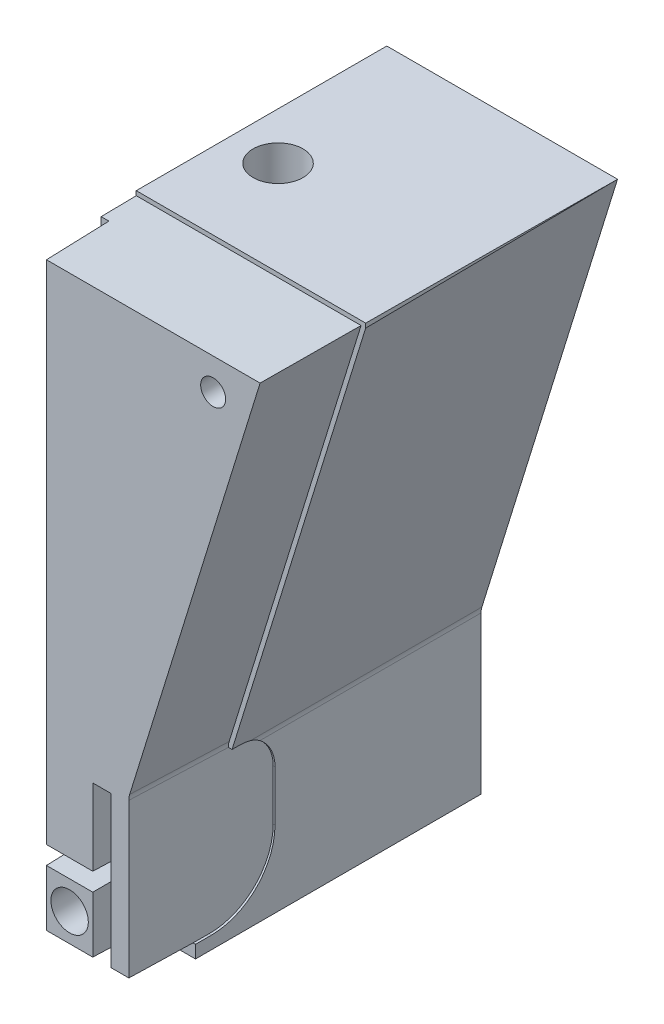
ISO-10303-21;
HEADER;
FILE_DESCRIPTION(('STEP AP214'),'2;1');
FILE_NAME('part.step','',(''),(''),'','','');
FILE_SCHEMA(('AUTOMOTIVE_DESIGN { 1 0 10303 214 1 1 1 1 }'));
ENDSEC;
DATA;
#1=APPLICATION_CONTEXT('core data for automotive mechanical design processes');
#2=APPLICATION_PROTOCOL_DEFINITION('international standard','automotive_design',2000,#1);
#3=PRODUCT_CONTEXT('',#1,'mechanical');
#4=PRODUCT('Part','Part','',(#3));
#5=PRODUCT_RELATED_PRODUCT_CATEGORY('part','',(#4));
#6=PRODUCT_DEFINITION_FORMATION('','',#4);
#7=PRODUCT_DEFINITION_CONTEXT('part definition',#1,'design');
#8=PRODUCT_DEFINITION('design','',#6,#7);
#9=PRODUCT_DEFINITION_SHAPE('','',#8);
#10=(LENGTH_UNIT() NAMED_UNIT(*) SI_UNIT(.MILLI.,.METRE.));
#11=(NAMED_UNIT(*) PLANE_ANGLE_UNIT() SI_UNIT($,.RADIAN.));
#12=(NAMED_UNIT(*) SI_UNIT($,.STERADIAN.) SOLID_ANGLE_UNIT());
#13=UNCERTAINTY_MEASURE_WITH_UNIT(LENGTH_MEASURE(1.E-05),#10,'distance_accuracy_value','');
#14=(GEOMETRIC_REPRESENTATION_CONTEXT(3) GLOBAL_UNCERTAINTY_ASSIGNED_CONTEXT((#13)) GLOBAL_UNIT_ASSIGNED_CONTEXT((#10,
#11,#12)) REPRESENTATION_CONTEXT('',''));
#15=CARTESIAN_POINT('',(0.,0.,0.));
#16=DIRECTION('',(0.,0.,1.));
#17=DIRECTION('',(1.,0.,0.));
#18=AXIS2_PLACEMENT_3D('',#15,#16,#17);
#19=CARTESIAN_POINT('',(13.4093944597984,-30.,-29.));
#20=DIRECTION('',(0.,0.,-1.));
#21=DIRECTION('',(-1.,0.,0.));
#22=AXIS2_PLACEMENT_3D('',#19,#20,#21);
#23=CONICAL_SURFACE('',#22,4.,1.02974425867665);
#24=CARTESIAN_POINT('',(13.4093944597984,-30.,-29.));
#25=DIRECTION('',(0.,0.,1.));
#26=DIRECTION('',(1.,0.,0.));
#27=AXIS2_PLACEMENT_3D('',#24,#25,#26);
#28=CIRCLE('',#27,4.);
#29=CARTESIAN_POINT('',(9.94530641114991,-27.9999765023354,-29.));
#30=VERTEX_POINT('',#29);
#31=CARTESIAN_POINT('',(9.94530641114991,-32.0000234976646,-29.));
#32=VERTEX_POINT('',#31);
#33=EDGE_CURVE('E849',#30,#32,#28,.T.);
#34=ORIENTED_EDGE('',*,*,#33,.F.);
#35=CARTESIAN_POINT('',(9.83719303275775,-27.5472664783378,-29.2002));
#36=CARTESIAN_POINT('',(9.85737608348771,-27.6357439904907,-29.1601228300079));
#37=CARTESIAN_POINT('',(9.87820808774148,-27.7242679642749,-29.1204718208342));
#38=CARTESIAN_POINT('',(9.92092930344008,-27.9016045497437,-29.0423271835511));
#39=CARTESIAN_POINT('',(9.94281883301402,-27.9904172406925,-29.003833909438));
#40=CARTESIAN_POINT('',(9.98793539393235,-28.1706043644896,-28.9274309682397));
#41=CARTESIAN_POINT('',(10.0111818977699,-28.2619892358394,-28.8895573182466));
#42=CARTESIAN_POINT('',(10.0580434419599,-28.4454926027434,-28.8159083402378));
#43=CARTESIAN_POINT('',(10.0816584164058,-28.5376109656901,-28.780132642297));
#44=CARTESIAN_POINT('',(10.1272673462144,-28.7181527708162,-28.7132771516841));
#45=CARTESIAN_POINT('',(10.1492812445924,-28.8065157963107,-28.6820493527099));
#46=CARTESIAN_POINT('',(10.1919246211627,-28.9848669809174,-28.6232125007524));
#47=CARTESIAN_POINT('',(10.2125531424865,-29.0748562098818,-28.595605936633));
#48=CARTESIAN_POINT('',(10.2505710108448,-29.2559972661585,-28.5458777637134));
#49=CARTESIAN_POINT('',(10.2679922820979,-29.347126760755,-28.5237012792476));
#50=CARTESIAN_POINT('',(10.2975339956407,-29.531652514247,-28.4866727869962));
#51=CARTESIAN_POINT('',(10.309664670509,-29.6250440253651,-28.4718066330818));
#52=CARTESIAN_POINT('',(10.3233629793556,-29.7811989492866,-28.4551230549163));
#53=CARTESIAN_POINT('',(10.3271270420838,-29.8434733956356,-28.4505783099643));
#54=CARTESIAN_POINT('',(10.3309011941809,-29.968355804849,-28.4460215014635));
#55=CARTESIAN_POINT('',(10.3309087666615,-30.0309639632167,-28.4460124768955));
#56=CARTESIAN_POINT('',(10.3271562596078,-30.1559863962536,-28.4505429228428));
#57=CARTESIAN_POINT('',(10.3233905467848,-30.218400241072,-28.4550891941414));
#58=CARTESIAN_POINT('',(10.3125225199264,-30.342463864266,-28.4683262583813));
#59=CARTESIAN_POINT('',(10.3054205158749,-30.4041137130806,-28.4770166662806));
#60=CARTESIAN_POINT('',(10.2849733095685,-30.5524834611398,-28.5023472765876));
#61=CARTESIAN_POINT('',(10.2702573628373,-30.6386973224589,-28.5207969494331));
#62=CARTESIAN_POINT('',(10.2374473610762,-30.8091972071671,-28.5629164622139));
#63=CARTESIAN_POINT('',(10.2193500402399,-30.8934812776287,-28.5865913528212));
#64=CARTESIAN_POINT('',(10.1812381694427,-31.0609675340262,-28.6378090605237));
#65=CARTESIAN_POINT('',(10.1612129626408,-31.1441604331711,-28.6653738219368));
#66=CARTESIAN_POINT('',(10.120420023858,-31.309359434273,-28.7232014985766));
#67=CARTESIAN_POINT('',(10.099652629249,-31.3913660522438,-28.7534631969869));
#68=CARTESIAN_POINT('',(10.0576717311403,-31.556142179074,-28.816578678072));
#69=CARTESIAN_POINT('',(10.0364572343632,-31.6388966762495,-28.8494707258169));
#70=CARTESIAN_POINT('',(9.99444670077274,-31.8038812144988,-28.9168253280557));
#71=CARTESIAN_POINT('',(9.97365071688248,-31.8861111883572,-28.9512880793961));
#72=CARTESIAN_POINT('',(9.93305030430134,-32.0491875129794,-29.0209748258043));
#73=CARTESIAN_POINT('',(9.9132366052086,-32.1300381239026,-29.0561834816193));
#74=CARTESIAN_POINT('',(9.87450214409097,-32.291517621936,-29.1275419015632));
#75=CARTESIAN_POINT('',(9.8555812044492,-32.3721465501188,-29.1636914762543));
#76=CARTESIAN_POINT('',(9.83719303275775,-32.4527335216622,-29.2002));
#77=B_SPLINE_CURVE_WITH_KNOTS('',3,(#35,#36,#37,#38,#39,#40,#41,#42,#43,#44,#45,#46,#47,#48,#49,
#50,#51,#52,#53,#54,#55,#56,#57,#58,#59,#60,#61,#62,#63,#64,#65,#66,#67,#68,#69,#70,#71,#72,#73,
#74,#75,#76),.UNSPECIFIED.,.F.,.F.,(4,2,2,2,2,2,2,2,2,2,2,2,2,2,2,2,2,2,2,2,4),(0.,
0.297616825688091,0.595323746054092,0.900155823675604,1.20493398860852,1.4936859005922,
1.78263524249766,2.06853133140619,2.35387198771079,2.54128121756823,2.72881601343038,
2.91663120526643,3.10442895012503,3.37221424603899,3.64025952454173,3.90988236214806,
4.17938416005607,4.45399527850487,4.7286409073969,4.99977960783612,5.27086413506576),.UNSPECIFIED.);
#78=EDGE_CURVE('E313',#30,#32,#77,.T.);
#79=ORIENTED_EDGE('',*,*,#78,.T.);
#80=EDGE_LOOP('',(#34,#79));
#81=FACE_BOUND('',#80,.T.);
#82=ADVANCED_FACE('F36',(#81),#23,.F.);
#83=CARTESIAN_POINT('',(13.4093944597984,-30.,-56.));
#84=DIRECTION('',(0.,0.,1.));
#85=DIRECTION('',(1.,0.,0.));
#86=AXIS2_PLACEMENT_3D('',#83,#84,#85);
#87=CYLINDRICAL_SURFACE('',#86,4.);
#88=CARTESIAN_POINT('',(13.4093944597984,-30.,-56.));
#89=DIRECTION('',(0.,0.,1.));
#90=DIRECTION('',(1.,0.,0.));
#91=AXIS2_PLACEMENT_3D('',#88,#89,#90);
#92=CIRCLE('',#91,4.);
#93=CARTESIAN_POINT('',(17.4093944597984,-30.,-56.));
#94=VERTEX_POINT('',#93);
#95=EDGE_CURVE('E856',#94,#94,#92,.T.);
#96=ORIENTED_EDGE('',*,*,#95,.F.);
#97=EDGE_LOOP('',(#96));
#98=FACE_BOUND('',#97,.T.);
#99=ORIENTED_EDGE('',*,*,#33,.T.);
#100=CARTESIAN_POINT('',(9.94530641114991,-32.0000234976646,-29.));
#101=CARTESIAN_POINT('',(9.88131448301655,-31.8891387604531,-29.110886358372));
#102=CARTESIAN_POINT('',(9.82337760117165,-31.7765489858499,-29.2234781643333));
#103=CARTESIAN_POINT('',(9.71923757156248,-31.5487022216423,-29.4513300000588));
#104=CARTESIAN_POINT('',(9.67303256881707,-31.4334456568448,-29.5665896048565));
#105=CARTESIAN_POINT('',(9.59213711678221,-31.2014806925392,-29.7985618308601));
#106=CARTESIAN_POINT('',(9.55739722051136,-31.0847808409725,-29.9152658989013));
#107=CARTESIAN_POINT('',(9.49888861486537,-30.8500436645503,-30.1500184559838));
#108=CARTESIAN_POINT('',(9.47511723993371,-30.7320066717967,-30.2680666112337));
#109=CARTESIAN_POINT('',(9.44629573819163,-30.5463291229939,-30.453766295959));
#110=CARTESIAN_POINT('',(9.43759485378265,-30.478960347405,-30.5211440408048));
#111=CARTESIAN_POINT('',(9.42521545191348,-30.3592740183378,-30.6408779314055));
#112=CARTESIAN_POINT('',(9.4208468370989,-30.3069880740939,-30.6931953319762));
#113=CARTESIAN_POINT('',(9.41515953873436,-30.2178227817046,-30.7824106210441));
#114=CARTESIAN_POINT('',(9.4133208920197,-30.18096229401,-30.8192907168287));
#115=CARTESIAN_POINT('',(9.41122003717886,-30.1227345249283,-30.8777141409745));
#116=CARTESIAN_POINT('',(9.4106201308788,-30.1013324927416,-30.8992233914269));
#117=CARTESIAN_POINT('',(9.40996135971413,-30.068312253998,-30.9324377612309));
#118=CARTESIAN_POINT('',(9.40978053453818,-30.0566999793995,-30.9441237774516));
#119=CARTESIAN_POINT('',(9.40958092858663,-30.0391358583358,-30.9622890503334));
#120=CARTESIAN_POINT('',(9.40952588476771,-30.0330527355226,-30.9686737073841));
#121=CARTESIAN_POINT('',(9.40945346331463,-30.0221761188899,-30.9802064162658));
#122=CARTESIAN_POINT('',(9.40943056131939,-30.0173838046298,-30.9853283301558));
#123=CARTESIAN_POINT('',(9.40941611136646,-30.0131723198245,-30.9919285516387));
#124=CARTESIAN_POINT('',(9.40941465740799,-30.0127188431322,-30.9926769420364));
#125=CARTESIAN_POINT('',(9.40941212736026,-30.011895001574,-30.9942190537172));
#126=CARTESIAN_POINT('',(9.40941105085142,-30.0115245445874,-30.9950127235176));
#127=CARTESIAN_POINT('',(9.40940955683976,-30.0109923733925,-30.9964476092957));
#128=CARTESIAN_POINT('',(9.40940904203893,-30.0108016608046,-30.9970776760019));
#129=CARTESIAN_POINT('',(9.40940831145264,-30.0105276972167,-30.9983600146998));
#130=CARTESIAN_POINT('',(9.40940809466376,-30.0104440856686,-30.9990122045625));
#131=CARTESIAN_POINT('',(9.40940798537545,-30.0104021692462,-31.0003249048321));
#132=CARTESIAN_POINT('',(9.40940809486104,-30.0104446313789,-31.000985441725));
#133=CARTESIAN_POINT('',(9.40940862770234,-30.0106467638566,-31.0022886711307));
#134=CARTESIAN_POINT('',(9.40940905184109,-30.0108067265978,-31.0029313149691));
#135=CARTESIAN_POINT('',(9.40941072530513,-30.011413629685,-31.0048145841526));
#136=CARTESIAN_POINT('',(9.40941237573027,-30.0119876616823,-31.006012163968));
#137=CARTESIAN_POINT('',(9.4094165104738,-30.0133000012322,-31.0083174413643));
#138=CARTESIAN_POINT('',(9.40941900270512,-30.0140398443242,-31.0094241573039));
#139=CARTESIAN_POINT('',(9.40944644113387,-30.021391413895,-31.0199475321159));
#140=CARTESIAN_POINT('',(9.40949723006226,-30.0295983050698,-31.028124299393));
#141=CARTESIAN_POINT('',(9.40987324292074,-30.0702659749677,-31.068836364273));
#142=CARTESIAN_POINT('',(9.41056535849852,-30.1022117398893,-31.1014349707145));
#143=CARTESIAN_POINT('',(9.41382254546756,-30.1986041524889,-31.1989449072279));
#144=CARTESIAN_POINT('',(9.4175687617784,-30.2635863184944,-31.263549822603));
#145=CARTESIAN_POINT('',(9.42821908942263,-30.3931130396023,-31.3928199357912));
#146=CARTESIAN_POINT('',(9.43512505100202,-30.4576573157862,-31.4574851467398));
#147=CARTESIAN_POINT('',(9.46082234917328,-30.6527259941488,-31.6527629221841));
#148=CARTESIAN_POINT('',(9.4845400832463,-30.7830525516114,-31.7830169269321));
#149=CARTESIAN_POINT('',(9.54524192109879,-31.0421519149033,-32.0420717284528));
#150=CARTESIAN_POINT('',(9.58223361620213,-31.170923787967,-32.1708716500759));
#151=CARTESIAN_POINT('',(9.66990577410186,-31.4263468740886,-32.4263199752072));
#152=CARTESIAN_POINT('',(9.72060487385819,-31.5529949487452,-32.5529651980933));
#153=CARTESIAN_POINT('',(9.83612285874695,-31.8029650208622,-32.8029360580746));
#154=CARTESIAN_POINT('',(9.90093666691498,-31.926288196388,-32.9262628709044));
#155=CARTESIAN_POINT('',(10.0877402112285,-32.2398220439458,-33.239803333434));
#156=CARTESIAN_POINT('',(10.2209563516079,-32.4267898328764,-33.4267724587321));
#157=CARTESIAN_POINT('',(10.5272110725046,-32.7835417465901,-33.7835275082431));
#158=CARTESIAN_POINT('',(10.7001668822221,-32.9533605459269,-33.953348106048));
#159=CARTESIAN_POINT('',(11.033969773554,-33.2233029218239,-34.2232930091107));
#160=CARTESIAN_POINT('',(11.184718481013,-33.3296485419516,-34.329639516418));
#161=CARTESIAN_POINT('',(11.5080822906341,-33.5242716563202,-34.524264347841));
#162=CARTESIAN_POINT('',(11.6806693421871,-33.6125719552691,-34.6125654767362));
#163=CARTESIAN_POINT('',(12.0131173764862,-33.7519110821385,-34.7519060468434));
#164=CARTESIAN_POINT('',(12.1697435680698,-33.8067885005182,-34.8067840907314));
#165=CARTESIAN_POINT('',(12.4937604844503,-33.8974147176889,-34.8974115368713));
#166=CARTESIAN_POINT('',(12.6611440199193,-33.9331761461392,-34.9331735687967));
#167=CARTESIAN_POINT('',(13.0032564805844,-33.9830974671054,-34.9830960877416));
#168=CARTESIAN_POINT('',(13.1780194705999,-33.9971425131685,-34.9971417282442));
#169=CARTESIAN_POINT('',(13.5281883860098,-34.0020652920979,-35.002065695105));
#170=CARTESIAN_POINT('',(13.7035941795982,-33.9929475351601,-34.9929485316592));
#171=CARTESIAN_POINT('',(14.0342531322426,-33.9540986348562,-34.9541007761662));
#172=CARTESIAN_POINT('',(14.1899477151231,-33.9261951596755,-34.9261978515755));
#173=CARTESIAN_POINT('',(14.4932011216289,-33.8535324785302,-34.8535362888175));
#174=CARTESIAN_POINT('',(14.64075694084,-33.808767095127,-34.8087714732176));
#175=CARTESIAN_POINT('',(14.9694614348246,-33.6885740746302,-34.6885797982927));
#176=CARTESIAN_POINT('',(15.1468011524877,-33.6079409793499,-34.6079474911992));
#177=CARTESIAN_POINT('',(15.4805065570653,-33.4273404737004,-34.4273486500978));
#178=CARTESIAN_POINT('',(15.6368364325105,-33.3273407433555,-34.3273497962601));
#179=CARTESIAN_POINT('',(15.9800189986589,-33.0744356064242,-34.0744468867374));
#180=CARTESIAN_POINT('',(16.1577967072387,-32.9153986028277,-33.915411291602));
#181=CARTESIAN_POINT('',(16.4754642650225,-32.5793184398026,-33.5793344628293));
#182=CARTESIAN_POINT('',(16.6152697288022,-32.4022363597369,-33.4022543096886));
#183=CARTESIAN_POINT('',(16.8207001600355,-32.0941803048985,-33.0942022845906));
#184=CARTESIAN_POINT('',(16.8958127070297,-31.96628646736,-32.966310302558));
#185=CARTESIAN_POINT('',(17.0301507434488,-31.7063243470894,-32.7063530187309));
#186=CARTESIAN_POINT('',(17.0893688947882,-31.5742541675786,-32.5742858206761));
#187=CARTESIAN_POINT('',(17.1924008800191,-31.3073975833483,-32.3074361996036));
#188=CARTESIAN_POINT('',(17.2362391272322,-31.1726158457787,-32.1726584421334));
#189=CARTESIAN_POINT('',(17.3090999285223,-30.9011302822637,-31.9011887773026));
#190=CARTESIAN_POINT('',(17.3381303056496,-30.7644275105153,-31.7644979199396));
#191=CARTESIAN_POINT('',(17.3708237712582,-30.5584919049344,-31.5585848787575));
#192=CARTESIAN_POINT('',(17.3799145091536,-30.4896694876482,-31.4897707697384));
#193=CARTESIAN_POINT('',(17.3928019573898,-30.3678248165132,-31.3679737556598));
#194=CARTESIAN_POINT('',(17.397337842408,-30.3148451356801,-31.315025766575));
#195=CARTESIAN_POINT('',(17.4032942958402,-30.2240522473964,-31.2242775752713));
#196=CARTESIAN_POINT('',(17.405235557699,-30.1862565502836,-31.186497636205));
#197=CARTESIAN_POINT('',(17.4074637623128,-30.1262251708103,-31.1266627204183));
#198=CARTESIAN_POINT('',(17.4081028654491,-30.1040246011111,-31.1045718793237));
#199=CARTESIAN_POINT('',(17.4088050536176,-30.0697337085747,-31.0704558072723));
#200=CARTESIAN_POINT('',(17.4089979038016,-30.0576583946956,-31.0584430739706));
#201=CARTESIAN_POINT('',(17.4092105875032,-30.0388885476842,-31.0402788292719));
#202=CARTESIAN_POINT('',(17.4092691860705,-30.0322918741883,-31.0339892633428));
#203=CARTESIAN_POINT('',(17.4093468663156,-30.0203020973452,-31.0226091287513));
#204=CARTESIAN_POINT('',(17.4093714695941,-30.0149288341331,-31.0175273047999));
#205=CARTESIAN_POINT('',(17.4093864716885,-30.0080215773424,-31.0131424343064));
#206=CARTESIAN_POINT('',(17.4093878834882,-30.0072910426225,-31.0127012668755));
#207=CARTESIAN_POINT('',(17.4093903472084,-30.005786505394,-31.0118985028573));
#208=CARTESIAN_POINT('',(17.4093913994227,-30.0050125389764,-31.0115368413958));
#209=CARTESIAN_POINT('',(17.4093928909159,-30.0035957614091,-31.0110063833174));
#210=CARTESIAN_POINT('',(17.4093934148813,-30.0029626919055,-31.0108124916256));
#211=CARTESIAN_POINT('',(17.4093941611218,-30.0016738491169,-31.010532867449));
#212=CARTESIAN_POINT('',(17.4093943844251,-30.0010181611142,-31.0104467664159));
#213=CARTESIAN_POINT('',(17.4093945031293,-29.9996978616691,-31.0104012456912));
#214=CARTESIAN_POINT('',(17.4093943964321,-29.9990332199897,-31.0104426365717));
#215=CARTESIAN_POINT('',(17.4093938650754,-29.9977218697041,-31.0106442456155));
#216=CARTESIAN_POINT('',(17.4093934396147,-29.9970752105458,-31.0108047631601));
#217=CARTESIAN_POINT('',(17.4093917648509,-29.9951890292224,-31.0114121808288));
#218=CARTESIAN_POINT('',(17.4093901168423,-29.9939923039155,-31.0119854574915));
#219=CARTESIAN_POINT('',(17.4093859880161,-29.9916886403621,-31.0132962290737));
#220=CARTESIAN_POINT('',(17.4093834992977,-29.990582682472,-31.0140352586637));
#221=CARTESIAN_POINT('',(17.4093561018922,-29.9800673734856,-31.0213784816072));
#222=CARTESIAN_POINT('',(17.4093053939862,-29.9718976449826,-31.0295778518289));
#223=CARTESIAN_POINT('',(17.4089300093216,-29.9312212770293,-31.0702080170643));
#224=CARTESIAN_POINT('',(17.408239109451,-29.8986523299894,-31.1021245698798));
#225=CARTESIAN_POINT('',(17.4049877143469,-29.8012309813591,-31.1984290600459));
#226=CARTESIAN_POINT('',(17.4012482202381,-29.7366845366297,-31.263352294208));
#227=CARTESIAN_POINT('',(17.3906171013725,-29.6075314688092,-31.3927615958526));
#228=CARTESIAN_POINT('',(17.3837236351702,-29.5429248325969,-31.4572473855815));
#229=CARTESIAN_POINT('',(17.3580734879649,-29.3478273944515,-31.6521358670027));
#230=CARTESIAN_POINT('',(17.3343998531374,-29.2176942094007,-31.7823415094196));
#231=CARTESIAN_POINT('',(17.2738118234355,-28.9588768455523,-32.0412033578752));
#232=CARTESIAN_POINT('',(17.2368898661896,-28.8301935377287,-32.1698586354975));
#233=CARTESIAN_POINT('',(17.1493840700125,-28.5749710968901,-32.4250558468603));
#234=CARTESIAN_POINT('',(17.0987815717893,-28.4484351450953,-32.5515946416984));
#235=CARTESIAN_POINT('',(16.9834853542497,-28.1986724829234,-32.8013565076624));
#236=CARTESIAN_POINT('',(16.9187966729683,-28.0754446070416,-32.9245807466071));
#237=CARTESIAN_POINT('',(16.7321579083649,-27.7618073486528,-33.2382113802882));
#238=CARTESIAN_POINT('',(16.5989402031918,-27.5746502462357,-33.4253671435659));
#239=CARTESIAN_POINT('',(16.2926249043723,-27.2175296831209,-33.7824845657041));
#240=CARTESIAN_POINT('',(16.1196102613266,-27.0475315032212,-33.9524809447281));
#241=CARTESIAN_POINT('',(15.7857444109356,-26.7773788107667,-34.2226311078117));
#242=CARTESIAN_POINT('',(15.6350218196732,-26.6709869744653,-34.3290220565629));
#243=CARTESIAN_POINT('',(15.3117032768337,-26.4762658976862,-34.5237414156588));
#244=CARTESIAN_POINT('',(15.1391353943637,-26.3879138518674,-34.6120926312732));
#245=CARTESIAN_POINT('',(14.8067058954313,-26.2484734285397,-34.7515316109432));
#246=CARTESIAN_POINT('',(14.6500803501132,-26.193547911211,-34.8064565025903));
#247=CARTESIAN_POINT('',(14.3260536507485,-26.1028255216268,-34.8971776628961));
#248=CARTESIAN_POINT('',(14.158659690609,-26.0670160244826,-34.9329865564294));
#249=CARTESIAN_POINT('',(13.8165126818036,-26.0170015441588,-34.9829998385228));
#250=CARTESIAN_POINT('',(13.6417254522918,-26.0029115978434,-34.9970891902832));
#251=CARTESIAN_POINT('',(13.2914972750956,-25.997906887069,-35.0020927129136));
#252=CARTESIAN_POINT('',(13.1160564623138,-26.0069875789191,-34.9930114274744));
#253=CARTESIAN_POINT('',(12.785348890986,-26.0457726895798,-34.9542251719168));
#254=CARTESIAN_POINT('',(12.629640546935,-26.0736456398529,-34.9263516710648));
#255=CARTESIAN_POINT('',(12.3263545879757,-26.1462515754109,-34.8537446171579));
#256=CARTESIAN_POINT('',(12.1787799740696,-26.1909907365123,-34.8090048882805));
#257=CARTESIAN_POINT('',(11.8500682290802,-26.3111142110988,-34.6888800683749));
#258=CARTESIAN_POINT('',(11.6727352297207,-26.3917004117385,-34.608293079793));
#259=CARTESIAN_POINT('',(11.3390331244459,-26.5722072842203,-34.4277845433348));
#260=CARTESIAN_POINT('',(11.1826997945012,-26.6721602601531,-34.3278306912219));
#261=CARTESIAN_POINT('',(10.8395090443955,-26.9249497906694,-34.0750389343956));
#262=CARTESIAN_POINT('',(10.6617213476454,-27.0839172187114,-33.916070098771));
#263=CARTESIAN_POINT('',(10.3440190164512,-27.4198597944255,-33.5801241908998));
#264=CARTESIAN_POINT('',(10.2041887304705,-27.5968738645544,-33.4031081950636));
#265=CARTESIAN_POINT('',(9.99870124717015,-27.9048236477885,-33.0951543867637));
#266=CARTESIAN_POINT('',(9.92356077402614,-28.0326789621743,-32.9672972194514));
#267=CARTESIAN_POINT('',(9.78916268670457,-28.2925647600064,-32.7074065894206));
#268=CARTESIAN_POINT('',(9.72991240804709,-28.4245971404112,-32.575371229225));
#269=CARTESIAN_POINT('',(9.62681190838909,-28.6913792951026,-32.3085821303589));
#270=CARTESIAN_POINT('',(9.58293730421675,-28.8261244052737,-32.1738330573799));
#271=CARTESIAN_POINT('',(9.50999941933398,-29.097530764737,-31.9024108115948));
#272=CARTESIAN_POINT('',(9.4809283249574,-29.2341909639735,-31.7657386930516));
#273=CARTESIAN_POINT('',(9.44814508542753,-29.440218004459,-31.5596892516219));
#274=CARTESIAN_POINT('',(9.43901540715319,-29.5091764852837,-31.4907225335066));
#275=CARTESIAN_POINT('',(9.42607781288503,-29.6311812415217,-31.3686701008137));
#276=CARTESIAN_POINT('',(9.42152562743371,-29.6841922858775,-31.3156273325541));
#277=CARTESIAN_POINT('',(9.41554278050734,-29.7750923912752,-31.2246830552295));
#278=CARTESIAN_POINT('',(9.41359140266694,-29.8129610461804,-31.1867990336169));
#279=CARTESIAN_POINT('',(9.41135056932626,-29.8729519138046,-31.1266115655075));
#280=CARTESIAN_POINT('',(9.41070755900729,-29.8951101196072,-31.1043433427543));
#281=CARTESIAN_POINT('',(9.41000103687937,-29.9293335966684,-31.069946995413));
#282=CARTESIAN_POINT('',(9.40980698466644,-29.9413856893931,-31.057833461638));
#283=CARTESIAN_POINT('',(9.40959299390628,-29.9596087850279,-31.0390041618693));
#284=CARTESIAN_POINT('',(9.40953404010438,-29.9659185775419,-31.0323866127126));
#285=CARTESIAN_POINT('',(9.40945583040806,-29.9773488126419,-31.0203515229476));
#286=CARTESIAN_POINT('',(9.40943105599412,-29.9824597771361,-31.0149532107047));
#287=CARTESIAN_POINT('',(9.40941600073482,-29.9868617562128,-31.0080146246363));
#288=CARTESIAN_POINT('',(9.40941459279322,-29.9873018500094,-31.0072855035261));
#289=CARTESIAN_POINT('',(9.40941213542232,-29.9881026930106,-31.0057839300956));
#290=CARTESIAN_POINT('',(9.40941108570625,-29.9884635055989,-31.0050115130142));
#291=CARTESIAN_POINT('',(9.4094095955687,-29.9889934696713,-31.0035962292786));
#292=CARTESIAN_POINT('',(9.40940907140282,-29.9891874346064,-31.0029629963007));
#293=CARTESIAN_POINT('',(9.40940832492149,-29.9894671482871,-31.0016738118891));
#294=CARTESIAN_POINT('',(9.40940810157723,-29.9895532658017,-31.0010179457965));
#295=CARTESIAN_POINT('',(9.40940798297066,-29.9895987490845,-30.9996972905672));
#296=CARTESIAN_POINT('',(9.40940808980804,-29.9895573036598,-30.9990324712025));
#297=CARTESIAN_POINT('',(9.40940862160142,-29.9893555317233,-30.9977207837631));
#298=CARTESIAN_POINT('',(9.40940904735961,-29.9891949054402,-30.9970739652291));
#299=CARTESIAN_POINT('',(9.40941072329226,-29.988587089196,-30.9951872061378));
#300=CARTESIAN_POINT('',(9.40941237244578,-29.9880134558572,-30.9939901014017));
#301=CARTESIAN_POINT('',(9.40941650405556,-29.9867019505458,-30.991685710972));
#302=CARTESIAN_POINT('',(9.40941899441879,-29.9859625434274,-30.9905794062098));
#303=CARTESIAN_POINT('',(9.40944641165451,-29.9786152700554,-30.9800601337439));
#304=CARTESIAN_POINT('',(9.40949715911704,-29.9704122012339,-30.9718869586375));
#305=CARTESIAN_POINT('',(9.4098728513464,-29.929763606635,-30.9311931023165));
#306=CARTESIAN_POINT('',(9.41056434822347,-29.897832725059,-30.8986095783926));
#307=CARTESIAN_POINT('',(9.41381899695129,-29.8014727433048,-30.8011322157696));
#308=CARTESIAN_POINT('',(9.41756279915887,-29.7365079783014,-30.7365447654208));
#309=CARTESIAN_POINT('',(9.42820458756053,-29.6070412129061,-30.6073340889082));
#310=CARTESIAN_POINT('',(9.43510320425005,-29.5425393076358,-30.5427108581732));
#311=CARTESIAN_POINT('',(9.46020134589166,-29.3519283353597,-30.3518974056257));
#312=CARTESIAN_POINT('',(9.4828957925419,-29.2259986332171,-30.2260363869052));
#313=CARTESIAN_POINT('',(9.54065813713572,-28.9755821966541,-29.9756620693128));
#314=CARTESIAN_POINT('',(9.57573141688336,-28.8510961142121,-29.8511493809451));
#315=CARTESIAN_POINT('',(9.65874144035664,-28.603682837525,-29.6037103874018));
#316=CARTESIAN_POINT('',(9.70673280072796,-28.4807646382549,-29.4807931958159));
#317=CARTESIAN_POINT('',(9.81596700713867,-28.2379118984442,-29.2379436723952));
#318=CARTESIAN_POINT('',(9.87721021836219,-28.1179774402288,-29.1180114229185));
#319=CARTESIAN_POINT('',(9.94530641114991,-27.9999765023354,-29.));
#320=B_SPLINE_CURVE_WITH_KNOTS('',3,(#100,#101,#102,#103,#104,#105,#106,#107,#108,#109,#110,
#111,#112,#113,#114,#115,#116,#117,#118,#119,#120,#121,#122,#123,#124,#125,#126,#127,#128,#129,
#130,#131,#132,#133,#134,#135,#136,#137,#138,#139,#140,#141,#142,#143,#144,#145,#146,#147,#148,
#149,#150,#151,#152,#153,#154,#155,#156,#157,#158,#159,#160,#161,#162,#163,#164,#165,#166,#167,
#168,#169,#170,#171,#172,#173,#174,#175,#176,#177,#178,#179,#180,#181,#182,#183,#184,#185,#186,
#187,#188,#189,#190,#191,#192,#193,#194,#195,#196,#197,#198,#199,#200,#201,#202,#203,#204,#205,
#206,#207,#208,#209,#210,#211,#212,#213,#214,#215,#216,#217,#218,#219,#220,#221,#222,#223,#224,
#225,#226,#227,#228,#229,#230,#231,#232,#233,#234,#235,#236,#237,#238,#239,#240,#241,#242,#243,
#244,#245,#246,#247,#248,#249,#250,#251,#252,#253,#254,#255,#256,#257,#258,#259,#260,#261,#262,
#263,#264,#265,#266,#267,#268,#269,#270,#271,#272,#273,#274,#275,#276,#277,#278,#279,#280,#281,
#282,#283,#284,#285,#286,#287,#288,#289,#290,#291,#292,#293,#294,#295,#296,#297,#298,#299,#300,
#301,#302,#303,#304,#305,#306,#307,#308,#309,#310,#311,#312,#313,#314,#315,#316,#317,#318,#319),
.UNSPECIFIED.,.F.,.F.,(4,2,2,2,2,2,2,2,2,2,2,2,2,2,2,2,2,2,2,2,2,2,2,2,2,2,2,2,2,2,2,2,2,2,2,2,
2,2,2,2,2,2,2,2,2,2,2,2,2,2,2,2,2,2,2,2,2,2,2,2,2,2,2,2,2,2,2,2,2,2,2,2,2,2,2,2,2,2,2,2,2,2,2,2,
2,2,2,2,2,2,2,2,2,2,2,2,2,2,2,2,2,2,2,2,2,2,2,2,2,4),(0.,0.507905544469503,1.01573073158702,
1.52133623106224,2.0268187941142,2.31379084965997,2.53605181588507,2.69255031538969,
2.78362225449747,2.83300599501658,2.85952321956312,2.88039461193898,2.88301685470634,
2.88563617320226,2.88760434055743,2.88956586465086,2.89153934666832,2.89351775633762,
2.89746991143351,2.90146030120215,2.93599713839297,3.07332912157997,3.34807878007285,
3.62298952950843,4.17974861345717,4.73682661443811,5.2946658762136,5.85230481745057,
6.73736728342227,7.62060276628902,8.25727268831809,8.89313297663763,9.41539623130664,
9.9373140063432,10.4619826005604,10.9865490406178,11.4662988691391,11.9462246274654,
12.5752800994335,13.2053945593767,14.0608288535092,14.918148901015,15.5049785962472,
16.0920787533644,16.6782427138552,17.2640966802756,17.5572803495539,17.7823743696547,
17.9427719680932,18.0367758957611,18.0878308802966,18.1152422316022,18.1372352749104,
18.1397926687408,18.1423479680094,18.1443275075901,18.1463002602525,18.1482855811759,
18.1502759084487,18.154224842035,18.158211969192,18.1927178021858,18.3299250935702,
18.6044250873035,18.8790855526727,19.4353206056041,19.9918736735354,20.5491897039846,
21.106306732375,21.9920782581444,22.8760199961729,23.5127709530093,24.1487118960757,
24.67106278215,25.1930682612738,25.7178291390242,26.2424871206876,26.722245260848,
27.2021792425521,27.8311127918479,28.4611045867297,29.3163316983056,30.1734440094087,
30.7601622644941,31.3471509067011,31.9332044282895,32.518948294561,32.8127520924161,
33.0381161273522,33.1988899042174,33.2931806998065,33.344399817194,33.3718990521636,
33.3940042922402,33.3965563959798,33.3991064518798,33.4010865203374,33.4030597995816,
33.4050456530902,33.4070365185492,33.4109869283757,33.4149755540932,33.4494966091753,
33.5867650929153,33.8614405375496,34.1361709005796,34.6740995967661,35.2122624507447,
35.7527373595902,36.2932271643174),.UNSPECIFIED.);
#321=EDGE_CURVE('E347',#32,#30,#320,.T.);
#322=ORIENTED_EDGE('',*,*,#321,.T.);
#323=EDGE_LOOP('',(#99,#322));
#324=FACE_BOUND('',#323,.T.);
#325=ADVANCED_FACE('F276',(#98,#324),#87,.F.);
#326=CARTESIAN_POINT('',(5.84844197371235,-8.67,-56.));
#327=DIRECTION('',(1.,0.,0.));
#328=DIRECTION('',(0.,1.,0.));
#329=AXIS2_PLACEMENT_3D('',#326,#327,#328);
#330=PLANE('',#329);
#331=DIRECTION('',(0.,-1.,0.));
#332=VECTOR('',#331,1.);
#333=CARTESIAN_POINT('',(5.84844197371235,-8.67,-15.819588));
#334=LINE('',#333,#332);
#335=CARTESIAN_POINT('',(5.84844197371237,39.9924836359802,-15.819588));
#336=VERTEX_POINT('',#335);
#337=CARTESIAN_POINT('',(5.84844197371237,39.2911319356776,-15.819588));
#338=VERTEX_POINT('',#337);
#339=EDGE_CURVE('E791',#336,#338,#334,.T.);
#340=ORIENTED_EDGE('',*,*,#339,.F.);
#341=DIRECTION('',(0.,0.,-1.));
#342=VECTOR('',#341,1.);
#343=CARTESIAN_POINT('',(5.84844197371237,39.9924836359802,0.168862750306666));
#344=LINE('',#343,#342);
#345=CARTESIAN_POINT('',(5.84844197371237,39.9924906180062,-56.));
#346=VERTEX_POINT('',#345);
#347=EDGE_CURVE('E783',#346,#336,#344,.F.);
#348=ORIENTED_EDGE('',*,*,#347,.F.);
#349=DIRECTION('',(0.,-1.,0.));
#350=VECTOR('',#349,1.);
#351=CARTESIAN_POINT('',(5.84844197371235,-8.67,-56.));
#352=LINE('',#351,#350);
#353=CARTESIAN_POINT('',(5.84844197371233,-56.355,-56.));
#354=VERTEX_POINT('',#353);
#355=EDGE_CURVE('E762',#346,#354,#352,.T.);
#356=ORIENTED_EDGE('',*,*,#355,.T.);
#357=DIRECTION('',(0.,0.,-1.));
#358=VECTOR('',#357,1.);
#359=CARTESIAN_POINT('',(5.84844197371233,-56.355,-56.));
#360=LINE('',#359,#358);
#361=CARTESIAN_POINT('',(5.84844197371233,-56.355,-10.2));
#362=VERTEX_POINT('',#361);
#363=EDGE_CURVE('E488',#354,#362,#360,.F.);
#364=ORIENTED_EDGE('',*,*,#363,.T.);
#365=DIRECTION('',(0.,-1.,0.));
#366=VECTOR('',#365,1.);
#367=CARTESIAN_POINT('',(5.84844197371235,-8.67,-10.2));
#368=LINE('',#367,#366);
#369=CARTESIAN_POINT('',(5.84844197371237,39.1930416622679,-10.2));
#370=VERTEX_POINT('',#369);
#371=EDGE_CURVE('E492',#370,#362,#368,.T.);
#372=ORIENTED_EDGE('',*,*,#371,.F.);
#373=DIRECTION('',(0.,0.0174524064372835,-0.999847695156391));
#374=VECTOR('',#373,1.);
#375=CARTESIAN_POINT('',(5.84844197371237,39.9776617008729,-55.1508519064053));
#376=LINE('',#375,#374);
#377=EDGE_CURVE('E835',#370,#338,#376,.T.);
#378=ORIENTED_EDGE('',*,*,#377,.T.);
#379=EDGE_LOOP('',(#340,#348,#356,#364,#372,#378));
#380=FACE_BOUND('',#379,.T.);
#381=ADVANCED_FACE('F284',(#380),#330,.F.);
#382=CARTESIAN_POINT('',(-65.6145427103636,39.9924836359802,-56.));
#383=DIRECTION('',(0.,-1.,0.));
#384=DIRECTION('',(1.,0.,0.));
#385=AXIS2_PLACEMENT_3D('',#382,#383,#384);
#386=PLANE('',#385);
#387=CARTESIAN_POINT('',(13.4094080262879,39.9924836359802,-30.9999999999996));
#388=DIRECTION('',(0.,-1.,0.));
#389=DIRECTION('',(1.,0.,0.));
#390=AXIS2_PLACEMENT_3D('',#387,#388,#389);
#391=CIRCLE('',#390,4.);
#392=CARTESIAN_POINT('',(17.4094080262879,39.9924836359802,-30.9999999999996));
#393=VERTEX_POINT('',#392);
#394=EDGE_CURVE('E1335',#393,#393,#391,.T.);
#395=ORIENTED_EDGE('',*,*,#394,.T.);
#396=EDGE_LOOP('',(#395));
#397=FACE_BOUND('',#396,.T.);
#398=ORIENTED_EDGE('',*,*,#347,.T.);
#399=DIRECTION('',(-1.,0.,0.));
#400=VECTOR('',#399,1.);
#401=CARTESIAN_POINT('',(-65.6145427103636,39.9924836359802,-15.819588));
#402=LINE('',#401,#400);
#403=CARTESIAN_POINT('',(42.6396881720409,39.9924871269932,-15.819588));
#404=VERTEX_POINT('',#403);
#405=EDGE_CURVE('E786',#336,#404,#402,.F.);
#406=ORIENTED_EDGE('',*,*,#405,.T.);
#407=DIRECTION('',(0.00540005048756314,0.,-0.999985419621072));
#408=VECTOR('',#407,1.);
#409=CARTESIAN_POINT('',(42.5494306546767,39.9924836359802,0.894367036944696));
#410=LINE('',#409,#408);
#411=CARTESIAN_POINT('',(42.8566734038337,39.9924871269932,-56.));
#412=VERTEX_POINT('',#411);
#413=EDGE_CURVE('E785',#412,#404,#410,.F.);
#414=ORIENTED_EDGE('',*,*,#413,.F.);
#415=DIRECTION('',(-1.,0.,0.));
#416=VECTOR('',#415,1.);
#417=CARTESIAN_POINT('',(-91.8,39.9924836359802,-56.));
#418=LINE('',#417,#416);
#419=EDGE_CURVE('E665',#412,#346,#418,.T.);
#420=ORIENTED_EDGE('',*,*,#419,.T.);
#421=EDGE_LOOP('',(#398,#406,#414,#420));
#422=FACE_BOUND('',#421,.T.);
#423=ADVANCED_FACE('F391',(#397,#422),#386,.F.);
#424=CARTESIAN_POINT('',(42.5502491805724,48.6764766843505,0.894371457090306));
#425=DIRECTION('',(0.99998541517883,-9.42582314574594E-05,0.00540005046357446));
#426=DIRECTION('',(0.00540005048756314,0.,-0.999985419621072));
#427=AXIS2_PLACEMENT_3D('',#424,#425,#426);
#428=PLANE('',#427);
#429=ORIENTED_EDGE('',*,*,#413,.T.);
#430=DIRECTION('',(-9.42596057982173E-05,-0.999999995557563,0.));
#431=VECTOR('',#430,1.);
#432=CARTESIAN_POINT('',(42.640506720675,48.6764681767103,-15.819588));
#433=LINE('',#432,#431);
#434=CARTESIAN_POINT('',(42.6396220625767,39.2911319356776,-15.819588));
#435=VERTEX_POINT('',#434);
#436=EDGE_CURVE('E831',#404,#435,#433,.T.);
#437=ORIENTED_EDGE('',*,*,#436,.T.);
#438=DIRECTION('',(-0.00540087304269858,-0.0174521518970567,0.99983311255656));
#439=VECTOR('',#438,1.);
#440=CARTESIAN_POINT('',(42.5502491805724,39.0023361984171,0.72550870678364));
#441=LINE('',#440,#439);
#442=EDGE_CURVE('E662',#412,#435,#441,.T.);
#443=ORIENTED_EDGE('',*,*,#442,.F.);
#444=EDGE_LOOP('',(#429,#437,#443));
#445=FACE_BOUND('',#444,.T.);
#446=ADVANCED_FACE('F394',(#445),#428,.T.);
#447=CARTESIAN_POINT('',(48.3354791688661,7.9140114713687,-15.819588));
#448=DIRECTION('',(0.,0.,-1.));
#449=DIRECTION('',(-1.,0.,0.));
#450=AXIS2_PLACEMENT_3D('',#447,#448,#449);
#451=PLANE('',#450);
#452=DIRECTION('',(-1.,0.,0.));
#453=VECTOR('',#452,1.);
#454=CARTESIAN_POINT('',(20.4816,-29.937,-15.819588));
#455=LINE('',#454,#453);
#456=CARTESIAN_POINT('',(21.2157682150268,-29.937,-15.819588));
#457=VERTEX_POINT('',#456);
#458=CARTESIAN_POINT('',(20.6196657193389,-29.937,-15.819588));
#459=VERTEX_POINT('',#458);
#460=EDGE_CURVE('E802',#457,#459,#455,.T.);
#461=ORIENTED_EDGE('',*,*,#460,.F.);
#462=DIRECTION('',(0.295634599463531,0.955301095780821,0.));
#463=VECTOR('',#462,1.);
#464=CARTESIAN_POINT('',(31.9265236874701,4.67328058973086,-15.819588));
#465=LINE('',#464,#463);
#466=EDGE_CURVE('E646',#457,#435,#465,.T.);
#467=ORIENTED_EDGE('',*,*,#466,.T.);
#468=ORIENTED_EDGE('',*,*,#436,.F.);
#469=ORIENTED_EDGE('',*,*,#405,.F.);
#470=ORIENTED_EDGE('',*,*,#339,.T.);
#471=DIRECTION('',(1.,0.,0.));
#472=VECTOR('',#471,1.);
#473=CARTESIAN_POINT('',(91.8,39.2911319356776,-15.819588));
#474=LINE('',#473,#472);
#475=CARTESIAN_POINT('',(41.9054538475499,39.2911319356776,-15.819588));
#476=VERTEX_POINT('',#475);
#477=EDGE_CURVE('E833',#338,#476,#474,.T.);
#478=ORIENTED_EDGE('',*,*,#477,.T.);
#479=DIRECTION('',(0.295634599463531,0.955301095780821,0.));
#480=VECTOR('',#479,1.);
#481=CARTESIAN_POINT('',(31.2565216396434,4.88062441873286,-15.819588));
#482=LINE('',#481,#480);
#483=CARTESIAN_POINT('',(20.7538459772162,-29.0572759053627,-15.819588));
#484=VERTEX_POINT('',#483);
#485=EDGE_CURVE('E474',#484,#476,#482,.T.);
#486=ORIENTED_EDGE('',*,*,#485,.F.);
#487=CARTESIAN_POINT('',(23.6197696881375,-29.9456594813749,-15.819588));
#488=DIRECTION('',(0.,0.,-1.));
#489=DIRECTION('',(-0.272255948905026,0.962224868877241,0.));
#490=AXIS2_PLACEMENT_3D('',#487,#488,#489);
#491=ELLIPSE('',#490,3.00154078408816,3.);
#492=EDGE_CURVE('E457',#484,#459,#491,.F.);
#493=ORIENTED_EDGE('',*,*,#492,.T.);
#494=EDGE_LOOP('',(#461,#467,#468,#469,#470,#478,#486,#493));
#495=FACE_BOUND('',#494,.T.);
#496=ADVANCED_FACE('F398',(#495),#451,.F.);
#497=CARTESIAN_POINT('',(16.1321290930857,-44.115,-12.75));
#498=DIRECTION('',(1.,0.,0.));
#499=DIRECTION('',(0.,0.,-1.));
#500=AXIS2_PLACEMENT_3D('',#497,#498,#499);
#501=CYLINDRICAL_SURFACE('',#500,10.2);
#502=CARTESIAN_POINT('',(20.9703045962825,-44.115,-12.75));
#503=DIRECTION('',(1.,0.,0.));
#504=DIRECTION('',(0.,0.,-1.));
#505=AXIS2_PLACEMENT_3D('',#502,#503,#504);
#506=CIRCLE('',#505,10.2);
#507=CARTESIAN_POINT('',(20.9703045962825,-54.314999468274,-12.7499999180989));
#508=VERTEX_POINT('',#507);
#509=CARTESIAN_POINT('',(20.9703045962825,-44.115,-22.95));
#510=VERTEX_POINT('',#509);
#511=EDGE_CURVE('E670',#508,#510,#506,.T.);
#512=ORIENTED_EDGE('',*,*,#511,.T.);
#513=DIRECTION('',(1.,0.,0.));
#514=VECTOR('',#513,1.);
#515=CARTESIAN_POINT('',(20.4816,-44.115,-22.95));
#516=LINE('',#515,#514);
#517=CARTESIAN_POINT('',(20.6818816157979,-44.115,-22.95));
#518=VERTEX_POINT('',#517);
#519=EDGE_CURVE('E789',#510,#518,#516,.F.);
#520=ORIENTED_EDGE('',*,*,#519,.T.);
#521=CARTESIAN_POINT('',(20.5928675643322,-44.115,-12.75));
#522=DIRECTION('',(-0.999961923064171,0.,-0.00872653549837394));
#523=DIRECTION('',(0.00872653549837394,0.,-0.999961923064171));
#524=AXIS2_PLACEMENT_3D('',#521,#522,#523);
#525=ELLIPSE('',#524,10.2003883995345,10.2);
#526=CARTESIAN_POINT('',(20.5928675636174,-54.315,-12.7499999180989));
#527=VERTEX_POINT('',#526);
#528=EDGE_CURVE('E638',#527,#518,#525,.F.);
#529=ORIENTED_EDGE('',*,*,#528,.F.);
#530=DIRECTION('',(1.,0.,0.));
#531=VECTOR('',#530,1.);
#532=CARTESIAN_POINT('',(16.1321290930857,-54.314999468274,-12.7499999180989));
#533=LINE('',#532,#531);
#534=EDGE_CURVE('E630',#527,#508,#533,.T.);
#535=ORIENTED_EDGE('',*,*,#534,.T.);
#536=EDGE_LOOP('',(#512,#520,#529,#535));
#537=FACE_BOUND('',#536,.T.);
#538=ADVANCED_FACE('F688',(#537),#501,.F.);
#539=CARTESIAN_POINT('',(7.089,-56.355,-10.2));
#540=DIRECTION('',(0.,-1.,0.));
#541=DIRECTION('',(0.,0.,-1.));
#542=AXIS2_PLACEMENT_3D('',#539,#540,#541);
#543=PLANE('',#542);
#544=DIRECTION('',(-1.,0.,0.));
#545=VECTOR('',#544,1.);
#546=CARTESIAN_POINT('',(7.089,-56.355,-56.));
#547=LINE('',#546,#545);
#548=CARTESIAN_POINT('',(20.9703045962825,-56.355,-56.));
#549=VERTEX_POINT('',#548);
#550=EDGE_CURVE('E664',#354,#549,#547,.F.);
#551=ORIENTED_EDGE('',*,*,#550,.T.);
#552=DIRECTION('',(0.,0.,-1.));
#553=VECTOR('',#552,1.);
#554=CARTESIAN_POINT('',(20.9703045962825,-56.355,-56.));
#555=LINE('',#554,#553);
#556=CARTESIAN_POINT('',(20.9703045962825,-56.355,-10.2));
#557=VERTEX_POINT('',#556);
#558=EDGE_CURVE('E500',#557,#549,#555,.T.);
#559=ORIENTED_EDGE('',*,*,#558,.F.);
#560=DIRECTION('',(-1.,0.,0.));
#561=VECTOR('',#560,1.);
#562=CARTESIAN_POINT('',(7.089,-56.355,-10.2));
#563=LINE('',#562,#561);
#564=EDGE_CURVE('E475',#557,#362,#563,.T.);
#565=ORIENTED_EDGE('',*,*,#564,.T.);
#566=ORIENTED_EDGE('',*,*,#363,.F.);
#567=EDGE_LOOP('',(#551,#559,#565,#566));
#568=FACE_BOUND('',#567,.T.);
#569=ADVANCED_FACE('F691',(#568),#543,.T.);
#570=CARTESIAN_POINT('',(31.1246480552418,4.92143500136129,-7.91105254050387));
#571=DIRECTION('',(0.955155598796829,-0.295589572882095,0.0174524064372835));
#572=DIRECTION('',(0.295634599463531,0.955301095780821,0.));
#573=AXIS2_PLACEMENT_3D('',#570,#571,#572);
#574=PLANE('',#573);
#575=DIRECTION('',(-0.00872238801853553,0.030827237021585,0.99948666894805));
#576=VECTOR('',#575,1.);
#577=CARTESIAN_POINT('',(20.6765526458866,-28.7841007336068,-6.96264949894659));
#578=LINE('',#577,#576);
#579=CARTESIAN_POINT('',(20.6157905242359,-28.569351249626,0.));
#580=VERTEX_POINT('',#579);
#581=EDGE_CURVE('E471',#580,#484,#578,.F.);
#582=ORIENTED_EDGE('',*,*,#581,.T.);
#583=ORIENTED_EDGE('',*,*,#485,.T.);
#584=DIRECTION('',(-0.0236633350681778,-0.0174475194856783,0.99956772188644));
#585=VECTOR('',#584,1.);
#586=CARTESIAN_POINT('',(41.4562886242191,38.959952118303,3.15369103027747));
#587=LINE('',#586,#585);
#588=CARTESIAN_POINT('',(41.530947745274,39.015,0.));
#589=VERTEX_POINT('',#588);
#590=EDGE_CURVE('E481',#476,#589,#587,.T.);
#591=ORIENTED_EDGE('',*,*,#590,.T.);
#592=DIRECTION('',(0.295634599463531,0.955301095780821,0.));
#593=VECTOR('',#592,1.);
#594=CARTESIAN_POINT('',(37.0795588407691,24.6309708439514,0.));
#595=LINE('',#594,#593);
#596=EDGE_CURVE('E518',#580,#589,#595,.T.);
#597=ORIENTED_EDGE('',*,*,#596,.F.);
#598=EDGE_LOOP('',(#582,#583,#591,#597));
#599=FACE_BOUND('',#598,.T.);
#600=ADVANCED_FACE('F747',(#599),#574,.T.);
#601=CARTESIAN_POINT('',(20.4816,-29.937,0.));
#602=DIRECTION('',(-0.999961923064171,0.,-0.00872653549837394));
#603=DIRECTION('',(-0.00872653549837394,0.,0.999961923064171));
#604=AXIS2_PLACEMENT_3D('',#601,#602,#603);
#605=PLANE('',#604);
#606=CARTESIAN_POINT('',(20.6284731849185,-36.057,-16.83));
#607=DIRECTION('',(-0.999961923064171,0.,-0.00872653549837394));
#608=DIRECTION('',(0.00872653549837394,0.,-0.999961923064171));
#609=AXIS2_PLACEMENT_3D('',#606,#607,#608);
#610=ELLIPSE('',#609,6.12023303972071,6.12);
#611=CARTESIAN_POINT('',(20.6363448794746,-30.0038368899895,-17.732006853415));
#612=VERTEX_POINT('',#611);
#613=CARTESIAN_POINT('',(20.6818816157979,-36.057,-22.95));
#614=VERTEX_POINT('',#613);
#615=EDGE_CURVE('E801',#612,#614,#610,.T.);
#616=ORIENTED_EDGE('',*,*,#615,.F.);
#617=DIRECTION('',(-0.00872238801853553,0.030827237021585,0.99948666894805));
#618=VECTOR('',#617,1.);
#619=CARTESIAN_POINT('',(20.4817290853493,-29.4573835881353,-0.0147917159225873));
#620=LINE('',#619,#618);
#621=CARTESIAN_POINT('',(20.4816,-29.4569273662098,0.));
#622=VERTEX_POINT('',#621);
#623=EDGE_CURVE('E512',#612,#622,#620,.T.);
#624=ORIENTED_EDGE('',*,*,#623,.T.);
#625=DIRECTION('',(0.,-1.,0.));
#626=VECTOR('',#625,1.);
#627=CARTESIAN_POINT('',(20.4816,-29.937,0.));
#628=LINE('',#627,#626);
#629=CARTESIAN_POINT('',(20.4816,-54.1369583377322,0.));
#630=VERTEX_POINT('',#629);
#631=EDGE_CURVE('E491',#622,#630,#628,.T.);
#632=ORIENTED_EDGE('',*,*,#631,.T.);
#633=DIRECTION('',(0.00872520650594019,-0.0174517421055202,-0.999809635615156));
#634=VECTOR('',#633,1.);
#635=CARTESIAN_POINT('',(20.477915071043,-54.1295879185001,0.422251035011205));
#636=LINE('',#635,#634);
#637=CARTESIAN_POINT('',(20.5706140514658,-54.315,-10.2));
#638=VERTEX_POINT('',#637);
#639=EDGE_CURVE('E464',#638,#630,#636,.F.);
#640=ORIENTED_EDGE('',*,*,#639,.F.);
#641=DIRECTION('',(0.00872653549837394,0.,-0.999961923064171));
#642=VECTOR('',#641,1.);
#643=CARTESIAN_POINT('',(20.4810044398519,-54.315,0.0682444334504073));
#644=LINE('',#643,#642);
#645=CARTESIAN_POINT('',(20.5928388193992,-54.315,-12.7467061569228));
#646=VERTEX_POINT('',#645);
#647=EDGE_CURVE('E631',#638,#646,#644,.T.);
#648=ORIENTED_EDGE('',*,*,#647,.T.);
#649=DIRECTION('',(0.00872653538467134,0.000161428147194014,-0.999961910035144));
#650=VECTOR('',#649,1.);
#651=CARTESIAN_POINT('',(20.5924991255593,-54.3150062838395,-12.707781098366));
#652=LINE('',#651,#650);
#653=EDGE_CURVE('E636',#646,#527,#652,.T.);
#654=ORIENTED_EDGE('',*,*,#653,.T.);
#655=ORIENTED_EDGE('',*,*,#528,.T.);
#656=DIRECTION('',(0.,-1.,0.));
#657=VECTOR('',#656,1.);
#658=CARTESIAN_POINT('',(20.6818816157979,-54.315,-22.95));
#659=LINE('',#658,#657);
#660=EDGE_CURVE('E798',#614,#518,#659,.T.);
#661=ORIENTED_EDGE('',*,*,#660,.F.);
#662=EDGE_LOOP('',(#616,#624,#632,#640,#648,#654,#655,#661));
#663=FACE_BOUND('',#662,.T.);
#664=ADVANCED_FACE('F743',(#663),#605,.F.);
#665=CARTESIAN_POINT('',(23.4816148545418,-29.4573835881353,0.0113878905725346));
#666=DIRECTION('',(-0.00872238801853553,0.030827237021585,0.99948666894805));
#667=DIRECTION('',(0.,-0.999524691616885,0.0308284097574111));
#668=AXIS2_PLACEMENT_3D('',#665,#666,#667);
#669=CYLINDRICAL_SURFACE('',#668,3.);
#670=ORIENTED_EDGE('',*,*,#492,.F.);
#671=ORIENTED_EDGE('',*,*,#581,.F.);
#672=CARTESIAN_POINT('',(23.4817142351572,-29.4577348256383,0.));
#673=DIRECTION('',(0.,0.,1.));
#674=DIRECTION('',(-0.272255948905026,0.962224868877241,0.));
#675=AXIS2_PLACEMENT_3D('',#672,#673,#674);
#676=ELLIPSE('',#675,3.00154078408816,3.);
#677=EDGE_CURVE('E522',#622,#580,#676,.F.);
#678=ORIENTED_EDGE('',*,*,#677,.F.);
#679=ORIENTED_EDGE('',*,*,#623,.F.);
#680=CARTESIAN_POINT('',(20.6363448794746,-30.0038368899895,-17.732006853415));
#681=CARTESIAN_POINT('',(20.6356970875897,-29.9927095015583,-17.6573378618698));
#682=CARTESIAN_POINT('',(20.6350787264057,-29.9829649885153,-17.5824626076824));
#683=CARTESIAN_POINT('',(20.6338578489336,-29.9662636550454,-17.4325052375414));
#684=CARTESIAN_POINT('',(20.6332553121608,-29.9593030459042,-17.3574235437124));
#685=CARTESIAN_POINT('',(20.6320215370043,-29.9481610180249,-17.2070544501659));
#686=CARTESIAN_POINT('',(20.6313902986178,-29.9439795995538,-17.1317670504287));
#687=CARTESIAN_POINT('',(20.6300893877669,-29.9383968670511,-16.9809864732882));
#688=CARTESIAN_POINT('',(20.629419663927,-29.9369993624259,-16.9054931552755));
#689=CARTESIAN_POINT('',(20.6287266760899,-29.937,-16.83));
#690=B_SPLINE_CURVE_WITH_KNOTS('',3,(#680,#681,#682,#683,#684,#685,#686,#687,#688,#689),
.UNSPECIFIED.,.F.,.F.,(4,2,2,2,4),(0.,0.226475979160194,0.452642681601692,0.678809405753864,
0.905285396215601),.UNSPECIFIED.);
#691=CARTESIAN_POINT('',(20.6287266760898,-29.937,-16.83));
#692=VERTEX_POINT('',#691);
#693=EDGE_CURVE('E409',#612,#692,#690,.T.);
#694=ORIENTED_EDGE('',*,*,#693,.T.);
#695=CARTESIAN_POINT('',(23.6173195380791,-29.937,-15.538828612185));
#696=DIRECTION('',(0.,1.,0.));
#697=DIRECTION('',(-0.00872653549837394,0.,0.999961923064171));
#698=AXIS2_PLACEMENT_3D('',#695,#696,#697);
#699=ELLIPSE('',#698,97.3165385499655,3.);
#700=EDGE_CURVE('E424',#692,#459,#699,.T.);
#701=ORIENTED_EDGE('',*,*,#700,.T.);
#702=EDGE_LOOP('',(#670,#671,#678,#679,#694,#701));
#703=FACE_BOUND('',#702,.T.);
#704=ADVANCED_FACE('F740',(#703),#669,.F.);
#705=CARTESIAN_POINT('',(-91.8,64.515,0.));
#706=DIRECTION('',(0.,0.,1.));
#707=DIRECTION('',(1.,0.,0.));
#708=AXIS2_PLACEMENT_3D('',#705,#706,#707);
#709=PLANE('',#708);
#710=DIRECTION('',(0.,1.,0.));
#711=VECTOR('',#710,1.);
#712=CARTESIAN_POINT('',(17.5996416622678,-29.937,0.));
#713=LINE('',#712,#711);
#714=CARTESIAN_POINT('',(17.5996416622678,-29.937,0.));
#715=VERTEX_POINT('',#714);
#716=CARTESIAN_POINT('',(17.5996416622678,-54.1369583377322,0.));
#717=VERTEX_POINT('',#716);
#718=EDGE_CURVE('E490',#715,#717,#713,.F.);
#719=ORIENTED_EDGE('',*,*,#718,.T.);
#720=DIRECTION('',(-1.,0.,0.));
#721=VECTOR('',#720,1.);
#722=CARTESIAN_POINT('',(5.049,-54.1369583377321,0.));
#723=LINE('',#722,#721);
#724=EDGE_CURVE('E509',#717,#630,#723,.F.);
#725=ORIENTED_EDGE('',*,*,#724,.T.);
#726=ORIENTED_EDGE('',*,*,#631,.F.);
#727=ORIENTED_EDGE('',*,*,#677,.T.);
#728=ORIENTED_EDGE('',*,*,#596,.T.);
#729=DIRECTION('',(1.,0.,0.));
#730=VECTOR('',#729,1.);
#731=CARTESIAN_POINT('',(-91.8,39.015,0.));
#732=LINE('',#731,#730);
#733=CARTESIAN_POINT('',(7.26704166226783,39.015,0.));
#734=VERTEX_POINT('',#733);
#735=EDGE_CURVE('E510',#734,#589,#732,.T.);
#736=ORIENTED_EDGE('',*,*,#735,.F.);
#737=DIRECTION('',(0.,1.,0.));
#738=VECTOR('',#737,1.);
#739=CARTESIAN_POINT('',(7.26704166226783,41.565,0.));
#740=LINE('',#739,#738);
#741=CARTESIAN_POINT('',(7.2670416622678,-42.2029583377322,0.));
#742=VERTEX_POINT('',#741);
#743=EDGE_CURVE('E521',#734,#742,#740,.F.);
#744=ORIENTED_EDGE('',*,*,#743,.T.);
#745=DIRECTION('',(-1.,0.,0.));
#746=VECTOR('',#745,1.);
#747=CARTESIAN_POINT('',(14.8716,-42.2029583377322,0.));
#748=LINE('',#747,#746);
#749=CARTESIAN_POINT('',(14.6935583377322,-42.2029583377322,0.));
#750=VERTEX_POINT('',#749);
#751=EDGE_CURVE('E555',#750,#742,#748,.T.);
#752=ORIENTED_EDGE('',*,*,#751,.F.);
#753=DIRECTION('',(0.,-1.,0.));
#754=VECTOR('',#753,1.);
#755=CARTESIAN_POINT('',(14.6935583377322,-54.315,0.));
#756=LINE('',#755,#754);
#757=CARTESIAN_POINT('',(14.6935583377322,-29.937,0.));
#758=VERTEX_POINT('',#757);
#759=EDGE_CURVE('E590',#750,#758,#756,.F.);
#760=ORIENTED_EDGE('',*,*,#759,.T.);
#761=DIRECTION('',(1.,0.,0.));
#762=VECTOR('',#761,1.);
#763=CARTESIAN_POINT('',(14.8716,-29.937,0.));
#764=LINE('',#763,#762);
#765=EDGE_CURVE('E585',#758,#715,#764,.T.);
#766=ORIENTED_EDGE('',*,*,#765,.T.);
#767=EDGE_LOOP('',(#719,#725,#726,#727,#728,#736,#744,#752,#760,#766));
#768=FACE_BOUND('',#767,.T.);
#769=CARTESIAN_POINT('',(34.0000080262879,33.9924836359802,0.));
#770=DIRECTION('',(0.,0.,1.));
#771=DIRECTION('',(1.,0.,0.));
#772=AXIS2_PLACEMENT_3D('',#769,#770,#771);
#773=CIRCLE('',#772,2.);
#774=CARTESIAN_POINT('',(36.0000080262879,33.9924836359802,0.));
#775=VERTEX_POINT('',#774);
#776=EDGE_CURVE('E1348',#775,#775,#773,.T.);
#777=ORIENTED_EDGE('',*,*,#776,.F.);
#778=EDGE_LOOP('',(#777));
#779=FACE_BOUND('',#778,.T.);
#780=ADVANCED_FACE('F612',(#768,#779),#709,.T.);
#781=CARTESIAN_POINT('',(14.8716,-29.937,-100.9805049));
#782=DIRECTION('',(0.,-1.,0.));
#783=DIRECTION('',(0.,0.,-1.));
#784=AXIS2_PLACEMENT_3D('',#781,#782,#783);
#785=PLANE('',#784);
#786=DIRECTION('',(-0.0174524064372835,0.,-0.999847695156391));
#787=VECTOR('',#786,1.);
#788=CARTESIAN_POINT('',(17.4216,-29.937,-10.2));
#789=LINE('',#788,#787);
#790=CARTESIAN_POINT('',(17.5284249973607,-29.937,-4.08));
#791=VERTEX_POINT('',#790);
#792=EDGE_CURVE('E573',#791,#715,#789,.F.);
#793=ORIENTED_EDGE('',*,*,#792,.T.);
#794=ORIENTED_EDGE('',*,*,#765,.F.);
#795=DIRECTION('',(0.0174524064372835,0.,-0.999847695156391));
#796=VECTOR('',#795,1.);
#797=CARTESIAN_POINT('',(16.4556969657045,-29.937,-100.952854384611));
#798=LINE('',#797,#796);
#799=CARTESIAN_POINT('',(14.7647750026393,-29.937,-4.08));
#800=VERTEX_POINT('',#799);
#801=EDGE_CURVE('E545',#800,#758,#798,.F.);
#802=ORIENTED_EDGE('',*,*,#801,.F.);
#803=DIRECTION('',(1.,0.,0.));
#804=VECTOR('',#803,1.);
#805=CARTESIAN_POINT('',(14.8716,-29.937,-4.08));
#806=LINE('',#805,#804);
#807=EDGE_CURVE('E581',#791,#800,#806,.F.);
#808=ORIENTED_EDGE('',*,*,#807,.F.);
#809=EDGE_LOOP('',(#793,#794,#802,#808));
#810=FACE_BOUND('',#809,.T.);
#811=ADVANCED_FACE('F722',(#810),#785,.T.);
#812=CARTESIAN_POINT('',(7.089,-44.931,-10.2));
#813=DIRECTION('',(0.,-0.999847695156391,-0.0174524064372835));
#814=DIRECTION('',(0.,0.0174524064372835,-0.999847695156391));
#815=AXIS2_PLACEMENT_3D('',#812,#813,#814);
#816=PLANE('',#815);
#817=DIRECTION('',(1.,0.,0.));
#818=VECTOR('',#817,1.);
#819=CARTESIAN_POINT('',(7.089,-45.1090416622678,0.));
#820=LINE('',#819,#818);
#821=CARTESIAN_POINT('',(7.2670416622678,-45.1090416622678,0.));
#822=VERTEX_POINT('',#821);
#823=CARTESIAN_POINT('',(14.6935583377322,-45.1090416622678,0.));
#824=VERTEX_POINT('',#823);
#825=EDGE_CURVE('E569',#822,#824,#820,.T.);
#826=ORIENTED_EDGE('',*,*,#825,.T.);
#827=DIRECTION('',(0.0174497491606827,0.0174497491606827,-0.999695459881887));
#828=VECTOR('',#827,1.);
#829=CARTESIAN_POINT('',(14.8692302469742,-44.9333697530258,-10.0642369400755));
#830=LINE('',#829,#828);
#831=CARTESIAN_POINT('',(14.8716,-44.931,-10.2));
#832=VERTEX_POINT('',#831);
#833=EDGE_CURVE('E534',#832,#824,#830,.F.);
#834=ORIENTED_EDGE('',*,*,#833,.F.);
#835=DIRECTION('',(1.,0.,0.));
#836=VECTOR('',#835,1.);
#837=CARTESIAN_POINT('',(7.089,-44.931,-10.2));
#838=LINE('',#837,#836);
#839=CARTESIAN_POINT('',(7.089,-44.931,-10.2));
#840=VERTEX_POINT('',#839);
#841=EDGE_CURVE('E496',#840,#832,#838,.T.);
#842=ORIENTED_EDGE('',*,*,#841,.F.);
#843=DIRECTION('',(-0.0174497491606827,0.0174497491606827,-0.999695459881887));
#844=VECTOR('',#843,1.);
#845=CARTESIAN_POINT('',(7.0626625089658,-44.9046625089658,-11.708873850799));
#846=LINE('',#845,#844);
#847=EDGE_CURVE('E572',#840,#822,#846,.F.);
#848=ORIENTED_EDGE('',*,*,#847,.T.);
#849=EDGE_LOOP('',(#826,#834,#842,#848));
#850=FACE_BOUND('',#849,.T.);
#851=ADVANCED_FACE('F714',(#850),#816,.F.);
#852=CARTESIAN_POINT('',(7.089,41.565,-10.2));
#853=DIRECTION('',(0.999847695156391,0.,-0.0174524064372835));
#854=DIRECTION('',(-0.0174524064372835,0.,-0.999847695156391));
#855=AXIS2_PLACEMENT_3D('',#852,#853,#854);
#856=PLANE('',#855);
#857=DIRECTION('',(0.,-1.,0.));
#858=VECTOR('',#857,1.);
#859=CARTESIAN_POINT('',(7.089,41.565,-10.2));
#860=LINE('',#859,#858);
#861=CARTESIAN_POINT('',(7.089,-54.315,-10.2));
#862=VERTEX_POINT('',#861);
#863=EDGE_CURVE('E575',#840,#862,#860,.T.);
#864=ORIENTED_EDGE('',*,*,#863,.T.);
#865=DIRECTION('',(0.0174497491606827,0.0174497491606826,0.999695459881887));
#866=VECTOR('',#865,1.);
#867=CARTESIAN_POINT('',(7.11819486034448,-54.2858051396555,-8.52742757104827));
#868=LINE('',#867,#866);
#869=CARTESIAN_POINT('',(7.2670416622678,-54.1369583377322,0.));
#870=VERTEX_POINT('',#869);
#871=EDGE_CURVE('E560',#862,#870,#868,.T.);
#872=ORIENTED_EDGE('',*,*,#871,.T.);
#873=DIRECTION('',(0.,1.,0.));
#874=VECTOR('',#873,1.);
#875=CARTESIAN_POINT('',(7.26704166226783,41.565,0.));
#876=LINE('',#875,#874);
#877=EDGE_CURVE('E532',#822,#870,#876,.F.);
#878=ORIENTED_EDGE('',*,*,#877,.F.);
#879=ORIENTED_EDGE('',*,*,#847,.F.);
#880=EDGE_LOOP('',(#864,#872,#878,#879));
#881=FACE_BOUND('',#880,.T.);
#882=ADVANCED_FACE('F710',(#881),#856,.F.);
#883=CARTESIAN_POINT('',(14.8716,-42.381,-10.2));
#884=DIRECTION('',(0.,0.999847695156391,-0.0174524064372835));
#885=DIRECTION('',(0.,0.0174524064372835,0.999847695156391));
#886=AXIS2_PLACEMENT_3D('',#883,#884,#885);
#887=PLANE('',#886);
#888=ORIENTED_EDGE('',*,*,#751,.T.);
#889=DIRECTION('',(-0.0174497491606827,-0.0174497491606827,-0.999695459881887));
#890=VECTOR('',#889,1.);
#891=CARTESIAN_POINT('',(7.09136975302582,-42.3786302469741,-10.0642369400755));
#892=LINE('',#891,#890);
#893=CARTESIAN_POINT('',(7.089,-42.381,-10.2));
#894=VERTEX_POINT('',#893);
#895=EDGE_CURVE('E564',#894,#742,#892,.F.);
#896=ORIENTED_EDGE('',*,*,#895,.F.);
#897=DIRECTION('',(-1.,0.,0.));
#898=VECTOR('',#897,1.);
#899=CARTESIAN_POINT('',(14.8716,-42.381,-10.2));
#900=LINE('',#899,#898);
#901=CARTESIAN_POINT('',(14.8716,-42.381,-10.2));
#902=VERTEX_POINT('',#901);
#903=EDGE_CURVE('E495',#902,#894,#900,.T.);
#904=ORIENTED_EDGE('',*,*,#903,.F.);
#905=DIRECTION('',(0.0174497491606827,-0.0174497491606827,-0.999695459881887));
#906=VECTOR('',#905,1.);
#907=CARTESIAN_POINT('',(14.875233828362,-42.384633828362,-10.4081818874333));
#908=LINE('',#907,#906);
#909=EDGE_CURVE('E546',#902,#750,#908,.F.);
#910=ORIENTED_EDGE('',*,*,#909,.T.);
#911=EDGE_LOOP('',(#888,#896,#904,#910));
#912=FACE_BOUND('',#911,.T.);
#913=ADVANCED_FACE('F713',(#912),#887,.F.);
#914=CARTESIAN_POINT('',(14.8716,-54.315,-10.2));
#915=DIRECTION('',(-0.999847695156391,0.,-0.0174524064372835));
#916=DIRECTION('',(-0.0174524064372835,0.,0.999847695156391));
#917=AXIS2_PLACEMENT_3D('',#914,#915,#916);
#918=PLANE('',#917);
#919=DIRECTION('',(0.,1.,0.));
#920=VECTOR('',#919,1.);
#921=CARTESIAN_POINT('',(14.8716,-54.315,-10.2));
#922=LINE('',#921,#920);
#923=CARTESIAN_POINT('',(14.8716,-36.057,-10.2));
#924=VERTEX_POINT('',#923);
#925=EDGE_CURVE('E537',#902,#924,#922,.T.);
#926=ORIENTED_EDGE('',*,*,#925,.T.);
#927=CARTESIAN_POINT('',(14.7647750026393,-36.057,-4.08));
#928=DIRECTION('',(-0.999847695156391,0.,-0.0174524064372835));
#929=DIRECTION('',(-0.0174524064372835,0.,0.999847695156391));
#930=AXIS2_PLACEMENT_3D('',#927,#928,#929);
#931=ELLIPSE('',#930,6.12093224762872,6.12);
#932=EDGE_CURVE('E552',#800,#924,#931,.T.);
#933=ORIENTED_EDGE('',*,*,#932,.F.);
#934=ORIENTED_EDGE('',*,*,#801,.T.);
#935=ORIENTED_EDGE('',*,*,#759,.F.);
#936=ORIENTED_EDGE('',*,*,#909,.F.);
#937=EDGE_LOOP('',(#926,#933,#934,#935,#936));
#938=FACE_BOUND('',#937,.T.);
#939=ADVANCED_FACE('F726',(#938),#918,.F.);
#940=CARTESIAN_POINT('',(5.049,-36.057,-4.08));
#941=DIRECTION('',(-1.,0.,0.));
#942=DIRECTION('',(0.,0.,1.));
#943=AXIS2_PLACEMENT_3D('',#940,#941,#942);
#944=CYLINDRICAL_SURFACE('',#943,6.12);
#945=ORIENTED_EDGE('',*,*,#932,.T.);
#946=DIRECTION('',(1.,0.,0.));
#947=VECTOR('',#946,1.);
#948=CARTESIAN_POINT('',(17.4216,-36.057,-10.2));
#949=LINE('',#948,#947);
#950=CARTESIAN_POINT('',(17.4216,-36.057,-10.2));
#951=VERTEX_POINT('',#950);
#952=EDGE_CURVE('E582',#924,#951,#949,.T.);
#953=ORIENTED_EDGE('',*,*,#952,.T.);
#954=CARTESIAN_POINT('',(17.5284249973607,-36.057,-4.08));
#955=DIRECTION('',(0.999847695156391,0.,-0.0174524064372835));
#956=DIRECTION('',(-0.0174524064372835,0.,-0.999847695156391));
#957=AXIS2_PLACEMENT_3D('',#954,#955,#956);
#958=ELLIPSE('',#957,6.12093224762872,6.12);
#959=EDGE_CURVE('E579',#951,#791,#958,.T.);
#960=ORIENTED_EDGE('',*,*,#959,.T.);
#961=ORIENTED_EDGE('',*,*,#807,.T.);
#962=EDGE_LOOP('',(#945,#953,#960,#961));
#963=FACE_BOUND('',#962,.T.);
#964=ADVANCED_FACE('F718',(#963),#944,.F.);
#965=CARTESIAN_POINT('',(7.089,41.565,-10.2));
#966=DIRECTION('',(0.999847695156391,0.,-0.0174524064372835));
#967=DIRECTION('',(-0.0174524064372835,0.,-0.999847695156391));
#968=AXIS2_PLACEMENT_3D('',#965,#966,#967);
#969=PLANE('',#968);
#970=ORIENTED_EDGE('',*,*,#895,.T.);
#971=ORIENTED_EDGE('',*,*,#743,.F.);
#972=DIRECTION('',(0.0174497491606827,-0.0174497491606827,0.999695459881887));
#973=VECTOR('',#972,1.);
#974=CARTESIAN_POINT('',(7.23687636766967,39.0451652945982,-1.72816857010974));
#975=LINE('',#974,#973);
#976=CARTESIAN_POINT('',(7.089,39.1930416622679,-10.2));
#977=VERTEX_POINT('',#976);
#978=EDGE_CURVE('E515',#734,#977,#975,.F.);
#979=ORIENTED_EDGE('',*,*,#978,.T.);
#980=EDGE_CURVE('E595',#977,#894,#860,.T.);
#981=ORIENTED_EDGE('',*,*,#980,.T.);
#982=EDGE_LOOP('',(#970,#971,#979,#981));
#983=FACE_BOUND('',#982,.T.);
#984=ADVANCED_FACE('F696',(#983),#969,.F.);
#985=CARTESIAN_POINT('',(5.049,41.565,-10.2));
#986=DIRECTION('',(0.,0.,-1.));
#987=DIRECTION('',(-1.,0.,0.));
#988=AXIS2_PLACEMENT_3D('',#985,#986,#987);
#989=PLANE('',#988);
#990=CARTESIAN_POINT('',(14.8716,-54.315,-10.2));
#991=VERTEX_POINT('',#990);
#992=EDGE_CURVE('E535',#991,#832,#922,.T.);
#993=ORIENTED_EDGE('',*,*,#992,.F.);
#994=DIRECTION('',(1.,0.,0.));
#995=VECTOR('',#994,1.);
#996=CARTESIAN_POINT('',(5.049,-54.315,-10.2));
#997=LINE('',#996,#995);
#998=EDGE_CURVE('E506',#862,#991,#997,.T.);
#999=ORIENTED_EDGE('',*,*,#998,.F.);
#1000=ORIENTED_EDGE('',*,*,#863,.F.);
#1001=ORIENTED_EDGE('',*,*,#841,.T.);
#1002=EDGE_LOOP('',(#993,#999,#1000,#1001));
#1003=FACE_BOUND('',#1002,.T.);
#1004=DIRECTION('',(1.,0.,0.));
#1005=VECTOR('',#1004,1.);
#1006=CARTESIAN_POINT('',(-91.8,39.1930416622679,-10.2));
#1007=LINE('',#1006,#1005);
#1008=EDGE_CURVE('E485',#370,#977,#1007,.T.);
#1009=ORIENTED_EDGE('',*,*,#1008,.F.);
#1010=ORIENTED_EDGE('',*,*,#371,.T.);
#1011=ORIENTED_EDGE('',*,*,#564,.F.);
#1012=DIRECTION('',(0.,-1.,0.));
#1013=VECTOR('',#1012,1.);
#1014=CARTESIAN_POINT('',(20.9703045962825,41.565,-10.2));
#1015=LINE('',#1014,#1013);
#1016=CARTESIAN_POINT('',(20.9703045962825,-54.315,-10.2));
#1017=VERTEX_POINT('',#1016);
#1018=EDGE_CURVE('E627',#557,#1017,#1015,.F.);
#1019=ORIENTED_EDGE('',*,*,#1018,.T.);
#1020=DIRECTION('',(1.,0.,0.));
#1021=VECTOR('',#1020,1.);
#1022=CARTESIAN_POINT('',(16.1321290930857,-54.315,-10.2));
#1023=LINE('',#1022,#1021);
#1024=EDGE_CURVE('E624',#638,#1017,#1023,.T.);
#1025=ORIENTED_EDGE('',*,*,#1024,.F.);
#1026=DIRECTION('',(1.,0.,0.));
#1027=VECTOR('',#1026,1.);
#1028=CARTESIAN_POINT('',(5.049,-54.315,-10.2));
#1029=LINE('',#1028,#1027);
#1030=CARTESIAN_POINT('',(17.4216,-54.315,-10.2));
#1031=VERTEX_POINT('',#1030);
#1032=EDGE_CURVE('E568',#1031,#638,#1029,.T.);
#1033=ORIENTED_EDGE('',*,*,#1032,.F.);
#1034=DIRECTION('',(0.,-1.,0.));
#1035=VECTOR('',#1034,1.);
#1036=CARTESIAN_POINT('',(17.4216,-29.937,-10.2));
#1037=LINE('',#1036,#1035);
#1038=EDGE_CURVE('E533',#951,#1031,#1037,.T.);
#1039=ORIENTED_EDGE('',*,*,#1038,.F.);
#1040=ORIENTED_EDGE('',*,*,#952,.F.);
#1041=ORIENTED_EDGE('',*,*,#925,.F.);
#1042=ORIENTED_EDGE('',*,*,#903,.T.);
#1043=ORIENTED_EDGE('',*,*,#980,.F.);
#1044=EDGE_LOOP('',(#1009,#1010,#1011,#1019,#1025,#1033,#1039,#1040,#1041,#1042,#1043));
#1045=FACE_BOUND('',#1044,.T.);
#1046=ADVANCED_FACE('F621',(#1003,#1045),#989,.F.);
#1047=CARTESIAN_POINT('',(5.049,-54.315,-10.2));
#1048=DIRECTION('',(0.,0.999847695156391,-0.0174524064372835));
#1049=DIRECTION('',(0.,0.0174524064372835,0.999847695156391));
#1050=AXIS2_PLACEMENT_3D('',#1047,#1048,#1049);
#1051=PLANE('',#1050);
#1052=ORIENTED_EDGE('',*,*,#998,.T.);
#1053=DIRECTION('',(-0.0174497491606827,0.0174497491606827,0.999695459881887));
#1054=VECTOR('',#1053,1.);
#1055=CARTESIAN_POINT('',(14.8686090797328,-54.3120090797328,-10.028650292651));
#1056=LINE('',#1055,#1054);
#1057=CARTESIAN_POINT('',(14.6935583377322,-54.1369583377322,0.));
#1058=VERTEX_POINT('',#1057);
#1059=EDGE_CURVE('E536',#991,#1058,#1056,.T.);
#1060=ORIENTED_EDGE('',*,*,#1059,.T.);
#1061=DIRECTION('',(-1.,0.,0.));
#1062=VECTOR('',#1061,1.);
#1063=CARTESIAN_POINT('',(5.049,-54.1369583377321,0.));
#1064=LINE('',#1063,#1062);
#1065=EDGE_CURVE('E526',#870,#1058,#1064,.F.);
#1066=ORIENTED_EDGE('',*,*,#1065,.F.);
#1067=ORIENTED_EDGE('',*,*,#871,.F.);
#1068=EDGE_LOOP('',(#1052,#1060,#1066,#1067));
#1069=FACE_BOUND('',#1068,.T.);
#1070=ADVANCED_FACE('F695',(#1069),#1051,.F.);
#1071=CARTESIAN_POINT('',(14.8716,-54.315,-10.2));
#1072=DIRECTION('',(-0.999847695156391,0.,-0.0174524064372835));
#1073=DIRECTION('',(-0.0174524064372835,0.,0.999847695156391));
#1074=AXIS2_PLACEMENT_3D('',#1071,#1072,#1073);
#1075=PLANE('',#1074);
#1076=DIRECTION('',(0.,-1.,0.));
#1077=VECTOR('',#1076,1.);
#1078=CARTESIAN_POINT('',(14.6935583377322,-54.315,0.));
#1079=LINE('',#1078,#1077);
#1080=EDGE_CURVE('E529',#1058,#824,#1079,.F.);
#1081=ORIENTED_EDGE('',*,*,#1080,.F.);
#1082=ORIENTED_EDGE('',*,*,#1059,.F.);
#1083=ORIENTED_EDGE('',*,*,#992,.T.);
#1084=ORIENTED_EDGE('',*,*,#833,.T.);
#1085=EDGE_LOOP('',(#1081,#1082,#1083,#1084));
#1086=FACE_BOUND('',#1085,.T.);
#1087=ADVANCED_FACE('F700',(#1086),#1075,.F.);
#1088=CARTESIAN_POINT('',(17.4216,-29.937,-10.2));
#1089=DIRECTION('',(0.999847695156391,0.,-0.0174524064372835));
#1090=DIRECTION('',(-0.0174524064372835,0.,-0.999847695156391));
#1091=AXIS2_PLACEMENT_3D('',#1088,#1089,#1090);
#1092=PLANE('',#1091);
#1093=ORIENTED_EDGE('',*,*,#1038,.T.);
#1094=DIRECTION('',(0.0174497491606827,0.0174497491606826,0.999695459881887));
#1095=VECTOR('',#1094,1.);
#1096=CARTESIAN_POINT('',(17.4290229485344,-54.3075770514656,-9.77473956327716));
#1097=LINE('',#1096,#1095);
#1098=EDGE_CURVE('E530',#1031,#717,#1097,.T.);
#1099=ORIENTED_EDGE('',*,*,#1098,.T.);
#1100=ORIENTED_EDGE('',*,*,#718,.F.);
#1101=ORIENTED_EDGE('',*,*,#792,.F.);
#1102=ORIENTED_EDGE('',*,*,#959,.F.);
#1103=EDGE_LOOP('',(#1093,#1099,#1100,#1101,#1102));
#1104=FACE_BOUND('',#1103,.T.);
#1105=ADVANCED_FACE('F617',(#1104),#1092,.F.);
#1106=CARTESIAN_POINT('',(10.9802916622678,-49.6229916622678,0.));
#1107=DIRECTION('',(0.,0.,1.));
#1108=DIRECTION('',(0.,1.,0.));
#1109=AXIS2_PLACEMENT_3D('',#1106,#1107,#1108);
#1110=CIRCLE('',#1109,3.);
#1111=CARTESIAN_POINT('',(10.9802916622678,-46.6229916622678,0.));
#1112=VERTEX_POINT('',#1111);
#1113=EDGE_CURVE('E840',#1112,#1112,#1110,.T.);
#1114=ORIENTED_EDGE('',*,*,#1113,.F.);
#1115=EDGE_LOOP('',(#1114));
#1116=FACE_BOUND('',#1115,.T.);
#1117=ORIENTED_EDGE('',*,*,#1065,.T.);
#1118=ORIENTED_EDGE('',*,*,#1080,.T.);
#1119=ORIENTED_EDGE('',*,*,#825,.F.);
#1120=ORIENTED_EDGE('',*,*,#877,.T.);
#1121=EDGE_LOOP('',(#1117,#1118,#1119,#1120));
#1122=FACE_BOUND('',#1121,.T.);
#1123=ADVANCED_FACE('F706',(#1116,#1122),#709,.T.);
#1124=CARTESIAN_POINT('',(5.049,-54.315,-10.2));
#1125=DIRECTION('',(0.,0.999847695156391,-0.0174524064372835));
#1126=DIRECTION('',(0.,0.0174524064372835,0.999847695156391));
#1127=AXIS2_PLACEMENT_3D('',#1124,#1125,#1126);
#1128=PLANE('',#1127);
#1129=ORIENTED_EDGE('',*,*,#1032,.T.);
#1130=ORIENTED_EDGE('',*,*,#639,.T.);
#1131=ORIENTED_EDGE('',*,*,#724,.F.);
#1132=ORIENTED_EDGE('',*,*,#1098,.F.);
#1133=EDGE_LOOP('',(#1129,#1130,#1131,#1132));
#1134=FACE_BOUND('',#1133,.T.);
#1135=ADVANCED_FACE('F605',(#1134),#1128,.F.);
#1136=CARTESIAN_POINT('',(16.1321290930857,-54.315,0.0302923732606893));
#1137=DIRECTION('',(0.,-1.,0.));
#1138=DIRECTION('',(0.,0.,-1.));
#1139=AXIS2_PLACEMENT_3D('',#1136,#1137,#1138);
#1140=PLANE('',#1139);
#1141=ORIENTED_EDGE('',*,*,#647,.F.);
#1142=ORIENTED_EDGE('',*,*,#1024,.T.);
#1143=DIRECTION('',(0.,0.,1.));
#1144=VECTOR('',#1143,1.);
#1145=CARTESIAN_POINT('',(20.9703045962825,-54.315,0.0302923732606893));
#1146=LINE('',#1145,#1144);
#1147=CARTESIAN_POINT('',(20.9703045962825,-54.315,-12.7467061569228));
#1148=VERTEX_POINT('',#1147);
#1149=EDGE_CURVE('E813',#1017,#1148,#1146,.F.);
#1150=ORIENTED_EDGE('',*,*,#1149,.T.);
#1151=CARTESIAN_POINT('',(20.9703045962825,-54.315,-12.7467061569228));
#1152=CARTESIAN_POINT('',(20.9703045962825,-54.315000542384,-12.8512262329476));
#1153=CARTESIAN_POINT('',(20.9703045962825,-54.3133937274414,-12.9557462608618));
#1154=CARTESIAN_POINT('',(20.9703045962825,-54.306981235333,-13.1642990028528));
#1155=CARTESIAN_POINT('',(20.9703045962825,-54.3021874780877,-13.2683320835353));
#1156=CARTESIAN_POINT('',(20.9703045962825,-54.2894346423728,-13.4759131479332));
#1157=CARTESIAN_POINT('',(20.9703045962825,-54.2814844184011,-13.5794616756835));
#1158=CARTESIAN_POINT('',(20.9703045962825,-54.2624438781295,-13.7860753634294));
#1159=CARTESIAN_POINT('',(20.9703045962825,-54.2513594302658,-13.8891410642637));
#1160=CARTESIAN_POINT('',(20.9703045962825,-54.2260665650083,-14.0947903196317));
#1161=CARTESIAN_POINT('',(20.9703045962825,-54.2118610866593,-14.1973742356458));
#1162=CARTESIAN_POINT('',(20.9703045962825,-54.1803333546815,-14.4020619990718));
#1163=CARTESIAN_POINT('',(20.9703045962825,-54.1630111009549,-14.5041658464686));
#1164=CARTESIAN_POINT('',(20.9703045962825,-54.1252481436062,-14.7078943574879));
#1165=CARTESIAN_POINT('',(20.9703045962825,-54.1048045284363,-14.8095184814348));
#1166=CARTESIAN_POINT('',(20.9703045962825,-54.0607887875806,-15.0122852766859));
#1167=CARTESIAN_POINT('',(20.9703045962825,-54.0372109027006,-15.1134266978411));
#1168=CARTESIAN_POINT('',(20.9703045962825,-53.9869077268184,-15.315223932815));
#1169=CARTESIAN_POINT('',(20.9703045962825,-53.9601738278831,-15.415877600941));
#1170=CARTESIAN_POINT('',(20.9703045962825,-53.9035316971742,-15.6166935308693));
#1171=CARTESIAN_POINT('',(20.9703045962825,-53.8736119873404,-15.7168525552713));
#1172=CARTESIAN_POINT('',(20.9703045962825,-53.8421593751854,-15.8165279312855));
#1173=B_SPLINE_CURVE_WITH_KNOTS('',3,(#1151,#1152,#1153,#1154,#1155,#1156,#1157,#1158,#1159,
#1160,#1161,#1162,#1163,#1164,#1165,#1166,#1167,#1168,#1169,#1170,#1171,#1172),.UNSPECIFIED.,
.F.,.F.,(4,2,2,2,2,2,2,2,2,2,4),(0.,0.313547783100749,0.62592937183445,0.937440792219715,
1.24837276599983,1.55901318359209,1.86965361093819,2.18058558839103,2.49209700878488,
2.80447859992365,3.11802639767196),.UNSPECIFIED.);
#1174=EDGE_CURVE('E672',#1148,#508,#1173,.T.);
#1175=ORIENTED_EDGE('',*,*,#1174,.T.);
#1176=ORIENTED_EDGE('',*,*,#534,.F.);
#1177=ORIENTED_EDGE('',*,*,#653,.F.);
#1178=EDGE_LOOP('',(#1141,#1142,#1150,#1175,#1176,#1177));
#1179=FACE_BOUND('',#1178,.T.);
#1180=ADVANCED_FACE('F634',(#1179),#1140,.F.);
#1181=CARTESIAN_POINT('',(20.9703045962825,-29.937,-56.));
#1182=DIRECTION('',(1.,0.,0.));
#1183=DIRECTION('',(0.,0.,-1.));
#1184=AXIS2_PLACEMENT_3D('',#1181,#1182,#1183);
#1185=PLANE('',#1184);
#1186=DIRECTION('',(0.,0.,-1.));
#1187=VECTOR('',#1186,1.);
#1188=CARTESIAN_POINT('',(20.9703045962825,-31.1841392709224,-56.));
#1189=LINE('',#1188,#1187);
#1190=CARTESIAN_POINT('',(20.9703045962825,-31.1841392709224,-56.));
#1191=VERTEX_POINT('',#1190);
#1192=CARTESIAN_POINT('',(20.9703045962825,-31.1841392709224,-20.5326515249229));
#1193=VERTEX_POINT('',#1192);
#1194=EDGE_CURVE('E643',#1191,#1193,#1189,.F.);
#1195=ORIENTED_EDGE('',*,*,#1194,.T.);
#1196=CARTESIAN_POINT('',(20.9703045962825,-36.057,-16.83));
#1197=DIRECTION('',(1.,0.,0.));
#1198=DIRECTION('',(0.,0.,-1.));
#1199=AXIS2_PLACEMENT_3D('',#1196,#1197,#1198);
#1200=CIRCLE('',#1199,6.12);
#1201=CARTESIAN_POINT('',(20.9703045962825,-36.057,-22.95));
#1202=VERTEX_POINT('',#1201);
#1203=EDGE_CURVE('E423',#1193,#1202,#1200,.F.);
#1204=ORIENTED_EDGE('',*,*,#1203,.T.);
#1205=DIRECTION('',(0.,-1.,0.));
#1206=VECTOR('',#1205,1.);
#1207=CARTESIAN_POINT('',(20.9703045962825,-29.937,-22.95));
#1208=LINE('',#1207,#1206);
#1209=EDGE_CURVE('E460',#510,#1202,#1208,.F.);
#1210=ORIENTED_EDGE('',*,*,#1209,.F.);
#1211=ORIENTED_EDGE('',*,*,#511,.F.);
#1212=ORIENTED_EDGE('',*,*,#1174,.F.);
#1213=ORIENTED_EDGE('',*,*,#1149,.F.);
#1214=ORIENTED_EDGE('',*,*,#1018,.F.);
#1215=ORIENTED_EDGE('',*,*,#558,.T.);
#1216=DIRECTION('',(0.,-1.,0.));
#1217=VECTOR('',#1216,1.);
#1218=CARTESIAN_POINT('',(20.9703045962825,-41.6589844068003,-56.));
#1219=LINE('',#1218,#1217);
#1220=EDGE_CURVE('E644',#1191,#549,#1219,.T.);
#1221=ORIENTED_EDGE('',*,*,#1220,.F.);
#1222=EDGE_LOOP('',(#1195,#1204,#1210,#1211,#1212,#1213,#1214,#1215,#1221));
#1223=FACE_BOUND('',#1222,.T.);
#1224=ADVANCED_FACE('F681',(#1223),#1185,.T.);
#1225=CARTESIAN_POINT('',(170.,-124.,-56.));
#1226=DIRECTION('',(0.,0.,1.));
#1227=DIRECTION('',(1.,0.,0.));
#1228=AXIS2_PLACEMENT_3D('',#1225,#1226,#1227);
#1229=PLANE('',#1228);
#1230=CARTESIAN_POINT('',(15.0000169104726,-17.0000001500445,-56.));
#1231=DIRECTION('',(0.,0.,1.));
#1232=DIRECTION('',(1.,0.,0.));
#1233=AXIS2_PLACEMENT_3D('',#1230,#1231,#1232);
#1234=CIRCLE('',#1233,4.);
#1235=CARTESIAN_POINT('',(19.0000169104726,-17.0000001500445,-56.));
#1236=VERTEX_POINT('',#1235);
#1237=EDGE_CURVE('E44',#1236,#1236,#1234,.T.);
#1238=ORIENTED_EDGE('',*,*,#1237,.T.);
#1239=EDGE_LOOP('',(#1238));
#1240=FACE_BOUND('',#1239,.T.);
#1241=CARTESIAN_POINT('',(25.0000177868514,24.1988728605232,-56.));
#1242=DIRECTION('',(0.,0.,1.));
#1243=DIRECTION('',(1.,0.,0.));
#1244=AXIS2_PLACEMENT_3D('',#1241,#1242,#1243);
#1245=CIRCLE('',#1244,4.);
#1246=CARTESIAN_POINT('',(29.0000177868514,24.1988728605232,-56.));
#1247=VERTEX_POINT('',#1246);
#1248=EDGE_CURVE('E1313',#1247,#1247,#1245,.T.);
#1249=ORIENTED_EDGE('',*,*,#1248,.T.);
#1250=EDGE_LOOP('',(#1249));
#1251=FACE_BOUND('',#1250,.T.);
#1252=ORIENTED_EDGE('',*,*,#95,.T.);
#1253=EDGE_LOOP('',(#1252));
#1254=FACE_BOUND('',#1253,.T.);
#1255=CARTESIAN_POINT('',(13.4093991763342,20.,-56.));
#1256=DIRECTION('',(0.,0.,1.));
#1257=DIRECTION('',(1.,0.,0.));
#1258=AXIS2_PLACEMENT_3D('',#1255,#1256,#1257);
#1259=CIRCLE('',#1258,4.);
#1260=CARTESIAN_POINT('',(17.4093991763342,20.,-56.));
#1261=VERTEX_POINT('',#1260);
#1262=EDGE_CURVE('E843',#1261,#1261,#1259,.T.);
#1263=ORIENTED_EDGE('',*,*,#1262,.T.);
#1264=EDGE_LOOP('',(#1263));
#1265=FACE_BOUND('',#1264,.T.);
#1266=CARTESIAN_POINT('',(10.9802916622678,-49.6229916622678,-56.));
#1267=DIRECTION('',(0.,0.,1.));
#1268=DIRECTION('',(1.,0.,0.));
#1269=AXIS2_PLACEMENT_3D('',#1266,#1267,#1268);
#1270=CIRCLE('',#1269,3.);
#1271=CARTESIAN_POINT('',(13.9802916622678,-49.6229916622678,-56.));
#1272=VERTEX_POINT('',#1271);
#1273=EDGE_CURVE('E836',#1272,#1272,#1270,.T.);
#1274=ORIENTED_EDGE('',*,*,#1273,.T.);
#1275=EDGE_LOOP('',(#1274));
#1276=FACE_BOUND('',#1275,.T.);
#1277=DIRECTION('',(-0.295634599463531,-0.955301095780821,0.));
#1278=VECTOR('',#1277,1.);
#1279=CARTESIAN_POINT('',(31.9265236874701,4.67328058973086,-56.));
#1280=LINE('',#1279,#1278);
#1281=CARTESIAN_POINT('',(21.1044951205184,-30.2965631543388,-56.));
#1282=VERTEX_POINT('',#1281);
#1283=EDGE_CURVE('E760',#412,#1282,#1280,.T.);
#1284=ORIENTED_EDGE('',*,*,#1283,.T.);
#1285=CARTESIAN_POINT('',(21.1044951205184,-30.2965631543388,-56.));
#1286=CARTESIAN_POINT('',(21.0820336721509,-30.3691489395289,-56.));
#1287=CARTESIAN_POINT('',(21.0623486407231,-30.4425774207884,-56.));
#1288=CARTESIAN_POINT('',(21.0285971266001,-30.5907141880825,-56.));
#1289=CARTESIAN_POINT('',(21.0145305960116,-30.665422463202,-56.));
#1290=CARTESIAN_POINT('',(20.9813947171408,-30.8872594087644,-56.));
#1291=CARTESIAN_POINT('',(20.9703129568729,-31.0356183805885,-56.));
#1292=CARTESIAN_POINT('',(20.9703045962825,-31.1841392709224,-56.));
#1293=B_SPLINE_CURVE_WITH_KNOTS('',3,(#1285,#1286,#1287,#1288,#1289,#1290,#1291,#1292),
.UNSPECIFIED.,.F.,.F.,(4,2,2,4),(0.,0.227859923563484,0.455717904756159,0.900514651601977),.UNSPECIFIED.);
#1294=EDGE_CURVE('E452',#1282,#1191,#1293,.T.);
#1295=ORIENTED_EDGE('',*,*,#1294,.T.);
#1296=ORIENTED_EDGE('',*,*,#1220,.T.);
#1297=ORIENTED_EDGE('',*,*,#550,.F.);
#1298=ORIENTED_EDGE('',*,*,#355,.F.);
#1299=ORIENTED_EDGE('',*,*,#419,.F.);
#1300=EDGE_LOOP('',(#1284,#1295,#1296,#1297,#1298,#1299));
#1301=FACE_BOUND('',#1300,.T.);
#1302=CARTESIAN_POINT('',(34.0000080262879,33.9924836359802,-56.));
#1303=DIRECTION('',(0.,0.,1.));
#1304=DIRECTION('',(1.,0.,0.));
#1305=AXIS2_PLACEMENT_3D('',#1302,#1303,#1304);
#1306=CIRCLE('',#1305,2.);
#1307=CARTESIAN_POINT('',(36.0000080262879,33.9924836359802,-56.));
#1308=VERTEX_POINT('',#1307);
#1309=EDGE_CURVE('E1345',#1308,#1308,#1306,.F.);
#1310=ORIENTED_EDGE('',*,*,#1309,.F.);
#1311=EDGE_LOOP('',(#1310));
#1312=FACE_BOUND('',#1311,.T.);
#1313=ADVANCED_FACE('F434',(#1240,#1251,#1254,#1265,#1276,#1301,#1312),#1229,.F.);
#1314=CARTESIAN_POINT('',(21.1044951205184,-30.2965631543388,-56.));
#1315=CARTESIAN_POINT('',(21.0156883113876,-30.5835297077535,-56.));
#1316=CARTESIAN_POINT('',(20.9703045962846,-30.8837110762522,-56.));
#1317=CARTESIAN_POINT('',(20.9703045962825,-31.1841392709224,-56.));
#1318=CARTESIAN_POINT('',(21.1044951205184,-30.2965631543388,-7.7835056));
#1319=CARTESIAN_POINT('',(21.0156883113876,-30.5835297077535,-7.7835056));
#1320=CARTESIAN_POINT('',(20.9703045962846,-30.8837110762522,-7.7835056));
#1321=CARTESIAN_POINT('',(20.9703045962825,-31.1841392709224,-7.7835056));
#1322=B_SPLINE_SURFACE_WITH_KNOTS('',1,3,((#1314,#1315,#1316,#1317),(#1318,#1319,#1320,#1321)),
.UNSPECIFIED.,.F.,.F.,.F.,(2,2),(4,4),(0.,1.),(0.99470527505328,1.29492501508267),.UNSPECIFIED.);
#1323=DIRECTION('',(0.,0.,-1.));
#1324=VECTOR('',#1323,1.);
#1325=CARTESIAN_POINT('',(21.1044951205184,-30.2965631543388,-56.));
#1326=LINE('',#1325,#1324);
#1327=CARTESIAN_POINT('',(21.1044951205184,-30.2965631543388,-18.8968254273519));
#1328=VERTEX_POINT('',#1327);
#1329=EDGE_CURVE('E658',#1328,#1282,#1326,.T.);
#1330=CARTESIAN_POINT('',(21.1044951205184,-30.2965631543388,-18.8968254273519));
#1331=CARTESIAN_POINT('',(21.088498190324,-30.348344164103,-19.0411634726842));
#1332=CARTESIAN_POINT('',(21.0723080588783,-30.4055735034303,-19.1835825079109));
#1333=CARTESIAN_POINT('',(21.0416071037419,-30.5306309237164,-19.4638503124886));
#1334=CARTESIAN_POINT('',(21.0270960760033,-30.5984577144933,-19.6016996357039));
#1335=CARTESIAN_POINT('',(21.007995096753,-30.7087386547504,-19.8060158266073));
#1336=CARTESIAN_POINT('',(21.0020234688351,-30.7473827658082,-19.8744284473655));
#1337=CARTESIAN_POINT('',(20.9913618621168,-30.827313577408,-20.009772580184));
#1338=CARTESIAN_POINT('',(20.9866715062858,-30.8685994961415,-20.0767045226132));
#1339=CARTESIAN_POINT('',(20.9788535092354,-30.9540832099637,-20.209485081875));
#1340=CARTESIAN_POINT('',(20.9757377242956,-30.998300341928,-20.275321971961));
#1341=CARTESIAN_POINT('',(20.9714645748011,-31.0893109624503,-20.405299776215));
#1342=CARTESIAN_POINT('',(20.9703081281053,-31.1361056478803,-20.4694398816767));
#1343=CARTESIAN_POINT('',(20.9703045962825,-31.1841392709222,-20.5326515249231));
#1344=B_SPLINE_CURVE_WITH_KNOTS('',3,(#1330,#1331,#1332,#1333,#1334,#1335,#1336,#1337,#1338,
#1339,#1340,#1341,#1342,#1343),.UNSPECIFIED.,.F.,.F.,(4,2,2,2,2,2,4),(0.,0.462525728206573,
0.924995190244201,1.16133458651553,1.39760436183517,1.63562765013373,1.8737624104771),.UNSPECIFIED.);
#1345=EDGE_CURVE('E416',#1328,#1193,#1344,.T.);
#1346=ORIENTED_EDGE('',*,*,#1329,.F.);
#1347=ORIENTED_EDGE('',*,*,#1345,.T.);
#1348=ORIENTED_EDGE('',*,*,#1194,.F.);
#1349=ORIENTED_EDGE('',*,*,#1294,.F.);
#1350=EDGE_LOOP('',(#1346,#1347,#1348,#1349));
#1351=FACE_BOUND('',#1350,.T.);
#1352=ADVANCED_FACE('F426',(#1351),#1322,.T.);
#1353=CARTESIAN_POINT('',(31.9265236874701,4.67328058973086,-56.));
#1354=DIRECTION('',(0.955301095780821,-0.295634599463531,0.));
#1355=DIRECTION('',(0.295634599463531,0.955301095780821,0.));
#1356=AXIS2_PLACEMENT_3D('',#1353,#1354,#1355);
#1357=PLANE('',#1356);
#1358=CARTESIAN_POINT('',(19.3218273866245,-36.057,-16.83));
#1359=DIRECTION('',(0.955301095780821,-0.295634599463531,0.));
#1360=DIRECTION('',(0.295634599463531,0.955301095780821,0.));
#1361=AXIS2_PLACEMENT_3D('',#1358,#1359,#1360);
#1362=ELLIPSE('',#1361,6.40635714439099,6.12);
#1363=CARTESIAN_POINT('',(21.2157682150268,-29.937,-16.83));
#1364=VERTEX_POINT('',#1363);
#1365=EDGE_CURVE('E456',#1328,#1364,#1362,.T.);
#1366=ORIENTED_EDGE('',*,*,#1365,.F.);
#1367=ORIENTED_EDGE('',*,*,#1329,.T.);
#1368=ORIENTED_EDGE('',*,*,#1283,.F.);
#1369=ORIENTED_EDGE('',*,*,#442,.T.);
#1370=ORIENTED_EDGE('',*,*,#466,.F.);
#1371=DIRECTION('',(0.,0.,1.));
#1372=VECTOR('',#1371,1.);
#1373=CARTESIAN_POINT('',(21.2157682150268,-29.937,-56.));
#1374=LINE('',#1373,#1372);
#1375=EDGE_CURVE('E454',#1364,#457,#1374,.T.);
#1376=ORIENTED_EDGE('',*,*,#1375,.F.);
#1377=EDGE_LOOP('',(#1366,#1367,#1368,#1369,#1370,#1376));
#1378=FACE_BOUND('',#1377,.T.);
#1379=ADVANCED_FACE('F433',(#1378),#1357,.T.);
#1380=CARTESIAN_POINT('',(20.4816,-54.315,-22.95));
#1381=DIRECTION('',(0.,0.,1.));
#1382=DIRECTION('',(1.,0.,0.));
#1383=AXIS2_PLACEMENT_3D('',#1380,#1381,#1382);
#1384=PLANE('',#1383);
#1385=ORIENTED_EDGE('',*,*,#1209,.T.);
#1386=DIRECTION('',(-1.,0.,0.));
#1387=VECTOR('',#1386,1.);
#1388=CARTESIAN_POINT('',(23.3376,-36.057,-22.95));
#1389=LINE('',#1388,#1387);
#1390=EDGE_CURVE('E771',#614,#1202,#1389,.F.);
#1391=ORIENTED_EDGE('',*,*,#1390,.F.);
#1392=ORIENTED_EDGE('',*,*,#660,.T.);
#1393=ORIENTED_EDGE('',*,*,#519,.F.);
#1394=EDGE_LOOP('',(#1385,#1391,#1392,#1393));
#1395=FACE_BOUND('',#1394,.T.);
#1396=ADVANCED_FACE('F404',(#1395),#1384,.T.);
#1397=CARTESIAN_POINT('',(23.3376,-36.057,-16.83));
#1398=DIRECTION('',(1.,0.,0.));
#1399=DIRECTION('',(0.,0.,-1.));
#1400=AXIS2_PLACEMENT_3D('',#1397,#1398,#1399);
#1401=CYLINDRICAL_SURFACE('',#1400,6.12);
#1402=ORIENTED_EDGE('',*,*,#1345,.F.);
#1403=ORIENTED_EDGE('',*,*,#1365,.T.);
#1404=DIRECTION('',(-1.,0.,0.));
#1405=VECTOR('',#1404,1.);
#1406=CARTESIAN_POINT('',(20.4816,-29.937,-16.83));
#1407=LINE('',#1406,#1405);
#1408=EDGE_CURVE('E787',#1364,#692,#1407,.T.);
#1409=ORIENTED_EDGE('',*,*,#1408,.T.);
#1410=ORIENTED_EDGE('',*,*,#693,.F.);
#1411=ORIENTED_EDGE('',*,*,#615,.T.);
#1412=ORIENTED_EDGE('',*,*,#1390,.T.);
#1413=ORIENTED_EDGE('',*,*,#1203,.F.);
#1414=EDGE_LOOP('',(#1402,#1403,#1409,#1410,#1411,#1412,#1413));
#1415=FACE_BOUND('',#1414,.T.);
#1416=ADVANCED_FACE('F400',(#1415),#1401,.F.);
#1417=CARTESIAN_POINT('',(23.3376,-29.937,-22.95));
#1418=DIRECTION('',(0.,1.,0.));
#1419=DIRECTION('',(0.,0.,1.));
#1420=AXIS2_PLACEMENT_3D('',#1417,#1418,#1419);
#1421=PLANE('',#1420);
#1422=ORIENTED_EDGE('',*,*,#1375,.T.);
#1423=ORIENTED_EDGE('',*,*,#460,.T.);
#1424=ORIENTED_EDGE('',*,*,#700,.F.);
#1425=ORIENTED_EDGE('',*,*,#1408,.F.);
#1426=EDGE_LOOP('',(#1422,#1423,#1424,#1425));
#1427=FACE_BOUND('',#1426,.T.);
#1428=ADVANCED_FACE('F389',(#1427),#1421,.F.);
#1429=CARTESIAN_POINT('',(-91.8,39.015,0.));
#1430=DIRECTION('',(0.,-0.999847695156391,-0.0174524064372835));
#1431=DIRECTION('',(0.,0.0174524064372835,-0.999847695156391));
#1432=AXIS2_PLACEMENT_3D('',#1429,#1430,#1431);
#1433=PLANE('',#1432);
#1434=ORIENTED_EDGE('',*,*,#1008,.T.);
#1435=ORIENTED_EDGE('',*,*,#978,.F.);
#1436=ORIENTED_EDGE('',*,*,#735,.T.);
#1437=ORIENTED_EDGE('',*,*,#590,.F.);
#1438=ORIENTED_EDGE('',*,*,#477,.F.);
#1439=ORIENTED_EDGE('',*,*,#377,.F.);
#1440=EDGE_LOOP('',(#1434,#1435,#1436,#1437,#1438,#1439));
#1441=FACE_BOUND('',#1440,.T.);
#1442=ADVANCED_FACE('F385',(#1441),#1433,.F.);
#1443=CARTESIAN_POINT('',(10.9802916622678,-49.6229916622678,-1049.4));
#1444=DIRECTION('',(0.,0.,1.));
#1445=DIRECTION('',(1.,0.,0.));
#1446=AXIS2_PLACEMENT_3D('',#1443,#1444,#1445);
#1447=CYLINDRICAL_SURFACE('',#1446,3.);
#1448=ORIENTED_EDGE('',*,*,#1113,.T.);
#1449=EDGE_LOOP('',(#1448));
#1450=FACE_BOUND('',#1449,.T.);
#1451=ORIENTED_EDGE('',*,*,#1273,.F.);
#1452=EDGE_LOOP('',(#1451));
#1453=FACE_BOUND('',#1452,.T.);
#1454=ADVANCED_FACE('F377',(#1450,#1453),#1447,.F.);
#1455=CARTESIAN_POINT('',(13.4093991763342,20.,-56.));
#1456=DIRECTION('',(0.,0.,1.));
#1457=DIRECTION('',(1.,0.,0.));
#1458=AXIS2_PLACEMENT_3D('',#1455,#1456,#1457);
#1459=CYLINDRICAL_SURFACE('',#1458,4.);
#1460=CARTESIAN_POINT('',(17.409403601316,20.,-30.9999999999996));
#1461=CARTESIAN_POINT('',(17.4094025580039,19.9997613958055,-31.0057373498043));
#1462=CARTESIAN_POINT('',(17.4093995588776,19.9965479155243,-31.0084425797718));
#1463=CARTESIAN_POINT('',(17.4093912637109,19.9920275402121,-31.0116342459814));
#1464=CARTESIAN_POINT('',(17.4093891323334,19.9909958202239,-31.0123268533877));
#1465=CARTESIAN_POINT('',(17.4093842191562,19.9890036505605,-31.0138114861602));
#1466=CARTESIAN_POINT('',(17.4093814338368,19.9880436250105,-31.0146040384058));
#1467=CARTESIAN_POINT('',(17.4093721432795,19.9851774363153,-31.017026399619));
#1468=CARTESIAN_POINT('',(17.40936473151,19.9832998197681,-31.0186896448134));
#1469=CARTESIAN_POINT('',(17.4093387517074,19.9776909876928,-31.023782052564));
#1470=CARTESIAN_POINT('',(17.4093165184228,19.9740240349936,-31.02728080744));
#1471=CARTESIAN_POINT('',(17.4092347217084,19.9629891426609,-31.0379131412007));
#1472=CARTESIAN_POINT('',(17.4091602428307,19.9556752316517,-31.04510121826));
#1473=CARTESIAN_POINT('',(17.4088753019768,19.9335984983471,-31.0668897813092));
#1474=CARTESIAN_POINT('',(17.4086037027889,19.9188829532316,-31.0815377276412));
#1475=CARTESIAN_POINT('',(17.4078938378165,19.8892636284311,-31.1110521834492));
#1476=CARTESIAN_POINT('',(17.4074532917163,19.8743600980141,-31.1259188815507));
#1477=CARTESIAN_POINT('',(17.406407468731,19.8446112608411,-31.1556128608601));
#1478=CARTESIAN_POINT('',(17.4058027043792,19.8297659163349,-31.1704401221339));
#1479=CARTESIAN_POINT('',(17.4037186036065,19.7847713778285,-31.2153889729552));
#1480=CARTESIAN_POINT('',(17.4019806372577,19.7546326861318,-31.2455094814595));
#1481=CARTESIAN_POINT('',(17.3978283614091,19.6944870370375,-31.3056271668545));
#1482=CARTESIAN_POINT('',(17.3954164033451,19.6644799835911,-31.3356244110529));
#1483=CARTESIAN_POINT('',(17.3898688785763,19.6040241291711,-31.3960642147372));
#1484=CARTESIAN_POINT('',(17.3867224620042,19.5735758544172,-31.4265063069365));
#1485=CARTESIAN_POINT('',(17.3797227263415,19.5126901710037,-31.4873816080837));
#1486=CARTESIAN_POINT('',(17.3758686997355,19.4822528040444,-31.5178147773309));
#1487=CARTESIAN_POINT('',(17.3674706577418,19.4215492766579,-31.5785110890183));
#1488=CARTESIAN_POINT('',(17.3629294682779,19.3912829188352,-31.6087744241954));
#1489=CARTESIAN_POINT('',(17.3531448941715,19.3308158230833,-31.6692362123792));
#1490=CARTESIAN_POINT('',(17.3479016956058,19.3006150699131,-31.6994346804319));
#1491=CARTESIAN_POINT('',(17.3309124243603,19.2090284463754,-31.7910151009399));
#1492=CARTESIAN_POINT('',(17.3180561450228,19.1477438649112,-31.8522965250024));
#1493=CARTESIAN_POINT('',(17.2893755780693,19.0254583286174,-31.9745767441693));
#1494=CARTESIAN_POINT('',(17.2735481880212,18.9644577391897,-32.0355751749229));
#1495=CARTESIAN_POINT('',(17.2389715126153,18.8431344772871,-32.1568947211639));
#1496=CARTESIAN_POINT('',(17.2202346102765,18.7828100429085,-32.217217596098));
#1497=CARTESIAN_POINT('',(17.1797576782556,18.6626844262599,-32.3373404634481));
#1498=CARTESIAN_POINT('',(17.1580184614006,18.6028831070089,-32.3971405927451));
#1499=CARTESIAN_POINT('',(17.1106305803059,18.4816872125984,-32.5183343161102));
#1500=CARTESIAN_POINT('',(17.0848675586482,18.4203149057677,-32.579705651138));
#1501=CARTESIAN_POINT('',(17.0300012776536,18.2983202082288,-32.7016985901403));
#1502=CARTESIAN_POINT('',(17.0008977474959,18.2376978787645,-32.7623201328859));
#1503=CARTESIAN_POINT('',(16.9084053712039,18.0569900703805,-32.9430257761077));
#1504=CARTESIAN_POINT('',(16.8398828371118,17.9381879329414,-33.061826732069));
#1505=CARTESIAN_POINT('',(16.6890322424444,17.7058582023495,-33.294154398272));
#1506=CARTESIAN_POINT('',(16.6067845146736,17.5923045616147,-33.4077071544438));
#1507=CARTESIAN_POINT('',(16.4276130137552,17.3711959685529,-33.6288141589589));
#1508=CARTESIAN_POINT('',(16.3307014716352,17.2636361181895,-33.7363733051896));
#1509=CARTESIAN_POINT('',(16.1601269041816,17.0944645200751,-33.9055438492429));
#1510=CARTESIAN_POINT('',(16.0910583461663,17.0305278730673,-33.9694801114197));
#1511=CARTESIAN_POINT('',(15.9467143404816,16.9062793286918,-34.0937279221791));
#1512=CARTESIAN_POINT('',(15.8714392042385,16.8459672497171,-34.1540396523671));
#1513=CARTESIAN_POINT('',(15.6362212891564,16.6714375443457,-34.3285683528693));
#1514=CARTESIAN_POINT('',(15.4667011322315,16.5634391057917,-34.4365661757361));
#1515=CARTESIAN_POINT('',(15.13682377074,16.3883460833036,-34.6116581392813));
#1516=CARTESIAN_POINT('',(14.9806126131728,16.3173798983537,-34.6826238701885));
#1517=CARTESIAN_POINT('',(14.7356145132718,16.2252431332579,-34.7747599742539));
#1518=CARTESIAN_POINT('',(14.652146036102,16.1969110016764,-34.8030918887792));
#1519=CARTESIAN_POINT('',(14.4820583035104,16.1454852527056,-34.8545172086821));
#1520=CARTESIAN_POINT('',(14.3954404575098,16.1223893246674,-34.8776129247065));
#1521=CARTESIAN_POINT('',(14.2188266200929,16.0816955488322,-34.9183062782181));
#1522=CARTESIAN_POINT('',(14.12880800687,16.0641466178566,-34.9358549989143));
#1523=CARTESIAN_POINT('',(13.9468526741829,16.035201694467,-34.964799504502));
#1524=CARTESIAN_POINT('',(13.8549169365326,16.0238026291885,-34.9761983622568));
#1525=CARTESIAN_POINT('',(13.6699263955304,16.0074144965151,-34.992586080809));
#1526=CARTESIAN_POINT('',(13.5768719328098,16.002423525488,-34.9975768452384));
#1527=CARTESIAN_POINT('',(13.3905532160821,15.9989572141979,-35.0010427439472));
#1528=CARTESIAN_POINT('',(13.2972889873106,16.0004811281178,-34.9995186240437));
#1529=CARTESIAN_POINT('',(13.0425028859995,16.0135796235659,-34.9864195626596));
#1530=CARTESIAN_POINT('',(12.8815721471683,16.0317605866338,-34.9682382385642));
#1531=CARTESIAN_POINT('',(12.5662827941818,16.0865825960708,-34.9134154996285));
#1532=CARTESIAN_POINT('',(12.4119249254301,16.1232257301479,-34.8767719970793));
#1533=CARTESIAN_POINT('',(12.1095468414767,16.2137263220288,-34.7862706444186));
#1534=CARTESIAN_POINT('',(11.961755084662,16.2679615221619,-34.7320350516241));
#1535=CARTESIAN_POINT('',(11.6784630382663,16.3906062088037,-34.609389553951));
#1536=CARTESIAN_POINT('',(11.5429699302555,16.4590239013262,-34.5409714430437));
#1537=CARTESIAN_POINT('',(11.316095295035,16.5895903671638,-34.4104042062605));
#1538=CARTESIAN_POINT('',(11.2219033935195,16.6493385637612,-34.3506556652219));
#1539=CARTESIAN_POINT('',(11.0412702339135,16.7744707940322,-34.225522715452));
#1540=CARTESIAN_POINT('',(10.954832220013,16.8398571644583,-34.1601359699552));
#1541=CARTESIAN_POINT('',(10.7895894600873,16.9754276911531,-34.0245646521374));
#1542=CARTESIAN_POINT('',(10.7107958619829,17.0456186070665,-33.9543733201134));
#1543=CARTESIAN_POINT('',(10.5608294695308,17.1899324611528,-33.8100585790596));
#1544=CARTESIAN_POINT('',(10.4896563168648,17.2640552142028,-33.7359353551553));
#1545=CARTESIAN_POINT('',(10.3255572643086,17.4483278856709,-33.5516614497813));
#1546=CARTESIAN_POINT('',(10.2365114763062,17.5602122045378,-33.439776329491));
#1547=CARTESIAN_POINT('',(10.0729040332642,17.7892034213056,-33.2107832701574));
#1548=CARTESIAN_POINT('',(9.99835319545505,17.906314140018,-33.093671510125));
#1549=CARTESIAN_POINT('',(9.8628455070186,18.1450395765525,-32.8549435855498));
#1550=CARTESIAN_POINT('',(9.80195408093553,18.2666728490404,-32.7333088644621));
#1551=CARTESIAN_POINT('',(9.72079341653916,18.4512278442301,-32.5487511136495));
#1552=CARTESIAN_POINT('',(9.69544746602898,18.5130612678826,-32.486916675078));
#1553=CARTESIAN_POINT('',(9.64806629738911,18.6373562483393,-32.3626193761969));
#1554=CARTESIAN_POINT('',(9.62603072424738,18.6998177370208,-32.3001565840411));
#1555=CARTESIAN_POINT('',(9.58907199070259,18.8134237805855,-32.1865477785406));
#1556=CARTESIAN_POINT('',(9.57359147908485,18.8644784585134,-32.1354917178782));
#1557=CARTESIAN_POINT('',(9.54474717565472,18.9668997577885,-32.0330672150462));
#1558=CARTESIAN_POINT('',(9.53138392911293,19.018266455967,-31.981698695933));
#1559=CARTESIAN_POINT('',(9.5067078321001,19.1214634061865,-31.8784974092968));
#1560=CARTESIAN_POINT('',(9.49540369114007,19.1732946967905,-31.8266636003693));
#1561=CARTESIAN_POINT('',(9.47490729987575,19.2771098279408,-31.7228422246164));
#1562=CARTESIAN_POINT('',(9.46571286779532,19.329093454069,-31.6708548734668));
#1563=CARTESIAN_POINT('',(9.44955033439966,19.4323053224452,-31.5676334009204));
#1564=CARTESIAN_POINT('',(9.44254584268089,19.4835307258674,-31.5164021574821));
#1565=CARTESIAN_POINT('',(9.43352655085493,19.5605585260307,-31.4393616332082));
#1566=CARTESIAN_POINT('',(9.43076389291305,19.5863191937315,-31.4135960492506));
#1567=CARTESIAN_POINT('',(9.4257440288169,19.637838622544,-31.3620644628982));
#1568=CARTESIAN_POINT('',(9.42348632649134,19.663597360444,-31.3362984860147));
#1569=CARTESIAN_POINT('',(9.41950312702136,19.7147334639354,-31.2851435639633));
#1570=CARTESIAN_POINT('',(9.41776993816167,19.7401105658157,-31.2597549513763));
#1571=CARTESIAN_POINT('',(9.41478364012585,19.790960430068,-31.2088725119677));
#1572=CARTESIAN_POINT('',(9.41353217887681,19.8164332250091,-31.1833786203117));
#1573=CARTESIAN_POINT('',(9.41202875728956,19.8544419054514,-31.145316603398));
#1574=CARTESIAN_POINT('',(9.4115919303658,19.8669798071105,-31.1327575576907));
#1575=CARTESIAN_POINT('',(9.4108353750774,19.892084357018,-31.1075901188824));
#1576=CARTESIAN_POINT('',(9.41051599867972,19.9046509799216,-31.0949816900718));
#1577=CARTESIAN_POINT('',(9.40999971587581,19.929593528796,-31.0699174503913));
#1578=CARTESIAN_POINT('',(9.40980118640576,19.9419697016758,-31.0574619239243));
#1579=CARTESIAN_POINT('',(9.40959099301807,19.9603586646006,-31.038755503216));
#1580=CARTESIAN_POINT('',(9.40953560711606,19.9664220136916,-31.0325547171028));
#1581=CARTESIAN_POINT('',(9.40947394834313,19.9753663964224,-31.0231755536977));
#1582=CARTESIAN_POINT('',(9.40945700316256,19.9783060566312,-31.0200545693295));
#1583=CARTESIAN_POINT('',(9.4094368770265,19.9825739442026,-31.0152722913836));
#1584=CARTESIAN_POINT('',(9.40943106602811,19.983966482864,-31.0136695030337));
#1585=CARTESIAN_POINT('',(9.40942366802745,19.9859886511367,-31.0112189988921));
#1586=CARTESIAN_POINT('',(9.4094214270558,19.9866495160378,-31.0103972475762));
#1587=CARTESIAN_POINT('',(9.4094174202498,19.9878959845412,-31.0087006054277));
#1588=CARTESIAN_POINT('',(9.40941565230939,19.9884819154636,-31.0078259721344));
#1589=CARTESIAN_POINT('',(9.40940766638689,19.991524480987,-31.0034245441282));
#1590=CARTESIAN_POINT('',(9.40940473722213,19.9941240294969,-31.0001213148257));
#1591=CARTESIAN_POINT('',(9.40940360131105,20.,-30.9999999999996));
#1592=B_SPLINE_CURVE_WITH_KNOTS('',3,(#1460,#1461,#1462,#1463,#1464,#1465,#1466,#1467,#1468,
#1469,#1470,#1471,#1472,#1473,#1474,#1475,#1476,#1477,#1478,#1479,#1480,#1481,#1482,#1483,#1484,
#1485,#1486,#1487,#1488,#1489,#1490,#1491,#1492,#1493,#1494,#1495,#1496,#1497,#1498,#1499,#1500,
#1501,#1502,#1503,#1504,#1505,#1506,#1507,#1508,#1509,#1510,#1511,#1512,#1513,#1514,#1515,#1516,
#1517,#1518,#1519,#1520,#1521,#1522,#1523,#1524,#1525,#1526,#1527,#1528,#1529,#1530,#1531,#1532,
#1533,#1534,#1535,#1536,#1537,#1538,#1539,#1540,#1541,#1542,#1543,#1544,#1545,#1546,#1547,#1548,
#1549,#1550,#1551,#1552,#1553,#1554,#1555,#1556,#1557,#1558,#1559,#1560,#1561,#1562,#1563,#1564,
#1565,#1566,#1567,#1568,#1569,#1570,#1571,#1572,#1573,#1574,#1575,#1576,#1577,#1578,#1579,#1580,
#1581,#1582,#1583,#1584,#1585,#1586,#1587,#1588,#1589,#1590,#1591),.UNSPECIFIED.,.F.,.F.,(4,2,2,
2,2,2,2,2,2,2,2,2,2,2,2,2,2,2,2,2,2,2,2,2,2,2,2,2,2,2,2,2,2,2,2,2,2,2,2,2,2,2,2,2,2,2,2,2,2,2,2,
2,2,2,2,2,2,2,2,2,2,2,2,2,2,4),(0.,0.0129550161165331,0.0166685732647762,0.0204025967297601,
0.0279260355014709,0.0431289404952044,0.0738946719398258,0.136188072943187,0.199353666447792,
0.262324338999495,0.390253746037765,0.517742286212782,0.647248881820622,0.776885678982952,
0.906003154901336,1.03508647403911,1.29787840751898,1.56094629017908,1.82292377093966,
2.08483046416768,2.35636737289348,2.6279263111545,3.17158886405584,3.71217434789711,
4.25231139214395,4.59338877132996,4.93444904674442,5.61560946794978,6.17025572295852,
6.44771769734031,6.72505699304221,7.00477788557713,7.28435888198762,7.5638568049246,
7.84332273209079,8.32971473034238,8.81616174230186,9.31383454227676,9.8117961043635,
10.19091904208,10.5701998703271,10.9500257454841,11.3298337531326,11.873667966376,
12.4179064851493,12.9646985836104,13.2377842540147,13.5108406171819,13.7323428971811,
13.9539021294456,14.1763777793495,14.3986223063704,14.6169488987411,14.7265635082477,
14.8360699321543,14.9438825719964,15.0520608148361,15.1053152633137,15.158728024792,
15.2114066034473,15.2374249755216,15.2502851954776,15.2566531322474,15.2598161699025,
15.2629648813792,15.2759198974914),.UNSPECIFIED.);
#1593=CARTESIAN_POINT('',(9.40940360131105,20.,-30.9999999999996));
#1594=VERTEX_POINT('',#1593);
#1595=CARTESIAN_POINT('',(17.409403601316,20.,-30.9999999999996));
#1596=VERTEX_POINT('',#1595);
#1597=EDGE_CURVE('E315',#1594,#1596,#1592,.F.);
#1598=ORIENTED_EDGE('',*,*,#1597,.T.);
#1599=CARTESIAN_POINT('',(17.409403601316,20.,-30.9999999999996));
#1600=CARTESIAN_POINT('',(17.4094025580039,20.0002386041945,-31.0057373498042));
#1601=CARTESIAN_POINT('',(17.4093995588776,20.0034520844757,-31.0084425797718));
#1602=CARTESIAN_POINT('',(17.4093912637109,20.0079724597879,-31.0116342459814));
#1603=CARTESIAN_POINT('',(17.4093891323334,20.0090041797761,-31.0123268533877));
#1604=CARTESIAN_POINT('',(17.4093842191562,20.0109963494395,-31.0138114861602));
#1605=CARTESIAN_POINT('',(17.4093814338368,20.0119563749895,-31.0146040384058));
#1606=CARTESIAN_POINT('',(17.4093721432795,20.0148225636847,-31.0170263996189));
#1607=CARTESIAN_POINT('',(17.40936473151,20.0167001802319,-31.0186896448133));
#1608=CARTESIAN_POINT('',(17.4093387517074,20.0223090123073,-31.023782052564));
#1609=CARTESIAN_POINT('',(17.4093165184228,20.0259759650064,-31.0272808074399));
#1610=CARTESIAN_POINT('',(17.4092347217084,20.0370108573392,-31.0379131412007));
#1611=CARTESIAN_POINT('',(17.4091602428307,20.0443247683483,-31.04510121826));
#1612=CARTESIAN_POINT('',(17.4088753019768,20.0664015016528,-31.0668897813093));
#1613=CARTESIAN_POINT('',(17.4086037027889,20.0811170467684,-31.0815377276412));
#1614=CARTESIAN_POINT('',(17.4078938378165,20.1107363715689,-31.1110521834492));
#1615=CARTESIAN_POINT('',(17.4074532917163,20.1256399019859,-31.1259188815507));
#1616=CARTESIAN_POINT('',(17.406407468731,20.1553887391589,-31.1556128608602));
#1617=CARTESIAN_POINT('',(17.4058027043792,20.1702340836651,-31.1704401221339));
#1618=CARTESIAN_POINT('',(17.4037186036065,20.2152286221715,-31.2153889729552));
#1619=CARTESIAN_POINT('',(17.4019806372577,20.2453673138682,-31.2455094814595));
#1620=CARTESIAN_POINT('',(17.3978283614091,20.3055129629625,-31.3056271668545));
#1621=CARTESIAN_POINT('',(17.3954164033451,20.3355200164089,-31.3356244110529));
#1622=CARTESIAN_POINT('',(17.3898688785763,20.3959758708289,-31.3960642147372));
#1623=CARTESIAN_POINT('',(17.3867224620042,20.4264241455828,-31.4265063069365));
#1624=CARTESIAN_POINT('',(17.3797227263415,20.4873098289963,-31.4873816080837));
#1625=CARTESIAN_POINT('',(17.3758686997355,20.5177471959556,-31.5178147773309));
#1626=CARTESIAN_POINT('',(17.3674706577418,20.5784507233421,-31.5785110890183));
#1627=CARTESIAN_POINT('',(17.3629294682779,20.6087170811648,-31.6087744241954));
#1628=CARTESIAN_POINT('',(17.3531448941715,20.6691841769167,-31.6692362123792));
#1629=CARTESIAN_POINT('',(17.3479016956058,20.6993849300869,-31.6994346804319));
#1630=CARTESIAN_POINT('',(17.3309124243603,20.7909715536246,-31.7910151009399));
#1631=CARTESIAN_POINT('',(17.3180561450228,20.8522561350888,-31.8522965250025));
#1632=CARTESIAN_POINT('',(17.2893755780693,20.9745416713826,-31.9745767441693));
#1633=CARTESIAN_POINT('',(17.2735481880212,21.0355422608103,-32.0355751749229));
#1634=CARTESIAN_POINT('',(17.2389715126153,21.1568655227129,-32.1568947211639));
#1635=CARTESIAN_POINT('',(17.2202346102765,21.2171899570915,-32.217217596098));
#1636=CARTESIAN_POINT('',(17.1797576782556,21.3373155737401,-32.3373404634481));
#1637=CARTESIAN_POINT('',(17.1580184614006,21.3971168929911,-32.3971405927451));
#1638=CARTESIAN_POINT('',(17.1106305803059,21.5183127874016,-32.5183343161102));
#1639=CARTESIAN_POINT('',(17.0848675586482,21.5796850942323,-32.579705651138));
#1640=CARTESIAN_POINT('',(17.0300012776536,21.7016797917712,-32.7016985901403));
#1641=CARTESIAN_POINT('',(17.0008977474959,21.7623021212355,-32.7623201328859));
#1642=CARTESIAN_POINT('',(16.9084053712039,21.9430099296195,-32.9430257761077));
#1643=CARTESIAN_POINT('',(16.8398828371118,22.0618120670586,-33.061826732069));
#1644=CARTESIAN_POINT('',(16.6890322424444,22.2941417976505,-33.294154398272));
#1645=CARTESIAN_POINT('',(16.6067845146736,22.4076954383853,-33.4077071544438));
#1646=CARTESIAN_POINT('',(16.4276130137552,22.6288040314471,-33.6288141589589));
#1647=CARTESIAN_POINT('',(16.3307014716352,22.7363638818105,-33.7363733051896));
#1648=CARTESIAN_POINT('',(16.1601269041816,22.9055354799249,-33.9055438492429));
#1649=CARTESIAN_POINT('',(16.0910583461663,22.9694721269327,-33.9694801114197));
#1650=CARTESIAN_POINT('',(15.9467143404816,23.0937206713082,-34.0937279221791));
#1651=CARTESIAN_POINT('',(15.8714392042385,23.1540327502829,-34.1540396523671));
#1652=CARTESIAN_POINT('',(15.6362212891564,23.3285624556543,-34.3285683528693));
#1653=CARTESIAN_POINT('',(15.4667011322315,23.4365608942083,-34.4365661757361));
#1654=CARTESIAN_POINT('',(15.13682377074,23.6116539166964,-34.6116581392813));
#1655=CARTESIAN_POINT('',(14.9806126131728,23.6826201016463,-34.6826238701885));
#1656=CARTESIAN_POINT('',(14.7356145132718,23.7747568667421,-34.7747599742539));
#1657=CARTESIAN_POINT('',(14.652146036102,23.8030889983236,-34.8030918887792));
#1658=CARTESIAN_POINT('',(14.4820583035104,23.8545147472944,-34.8545172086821));
#1659=CARTESIAN_POINT('',(14.3954404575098,23.8776106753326,-34.8776129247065));
#1660=CARTESIAN_POINT('',(14.2188266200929,23.9183044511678,-34.9183062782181));
#1661=CARTESIAN_POINT('',(14.12880800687,23.9358533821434,-34.9358549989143));
#1662=CARTESIAN_POINT('',(13.9468526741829,23.964798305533,-34.964799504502));
#1663=CARTESIAN_POINT('',(13.8549169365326,23.9761973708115,-34.9761983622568));
#1664=CARTESIAN_POINT('',(13.6699263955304,23.9925855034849,-34.992586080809));
#1665=CARTESIAN_POINT('',(13.5768719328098,23.997576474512,-34.9975768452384));
#1666=CARTESIAN_POINT('',(13.3905532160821,24.0010427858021,-35.0010427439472));
#1667=CARTESIAN_POINT('',(13.2972889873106,23.9995188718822,-34.9995186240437));
#1668=CARTESIAN_POINT('',(13.0425028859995,23.9864203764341,-34.9864195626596));
#1669=CARTESIAN_POINT('',(12.8815721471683,23.9682394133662,-34.9682382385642));
#1670=CARTESIAN_POINT('',(12.5662827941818,23.9134174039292,-34.9134154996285));
#1671=CARTESIAN_POINT('',(12.4119249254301,23.8767742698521,-34.8767719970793));
#1672=CARTESIAN_POINT('',(12.1095468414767,23.7862736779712,-34.7862706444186));
#1673=CARTESIAN_POINT('',(11.961755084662,23.7320384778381,-34.7320350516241));
#1674=CARTESIAN_POINT('',(11.6784630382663,23.6093937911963,-34.609389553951));
#1675=CARTESIAN_POINT('',(11.5429699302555,23.5409760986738,-34.5409714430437));
#1676=CARTESIAN_POINT('',(11.316095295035,23.4104096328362,-34.4104042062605));
#1677=CARTESIAN_POINT('',(11.2219033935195,23.3506614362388,-34.3506556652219));
#1678=CARTESIAN_POINT('',(11.0412702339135,23.2255292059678,-34.225522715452));
#1679=CARTESIAN_POINT('',(10.954832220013,23.1601428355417,-34.1601359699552));
#1680=CARTESIAN_POINT('',(10.7895894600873,23.0245723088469,-34.0245646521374));
#1681=CARTESIAN_POINT('',(10.7107958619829,22.9543813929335,-33.9543733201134));
#1682=CARTESIAN_POINT('',(10.5608294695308,22.8100675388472,-33.8100585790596));
#1683=CARTESIAN_POINT('',(10.4896563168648,22.7359447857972,-33.7359353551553));
#1684=CARTESIAN_POINT('',(10.3255572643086,22.5516721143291,-33.5516614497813));
#1685=CARTESIAN_POINT('',(10.2365114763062,22.4397877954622,-33.439776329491));
#1686=CARTESIAN_POINT('',(10.0729040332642,22.2107965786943,-33.2107832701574));
#1687=CARTESIAN_POINT('',(9.99835319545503,22.093685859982,-33.0936715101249));
#1688=CARTESIAN_POINT('',(9.86284550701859,21.8549604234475,-32.8549435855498));
#1689=CARTESIAN_POINT('',(9.80195408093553,21.7333271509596,-32.7333088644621));
#1690=CARTESIAN_POINT('',(9.72079341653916,21.5487721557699,-32.5487511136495));
#1691=CARTESIAN_POINT('',(9.69544746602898,21.4869387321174,-32.486916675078));
#1692=CARTESIAN_POINT('',(9.64806629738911,21.3626437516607,-32.3626193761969));
#1693=CARTESIAN_POINT('',(9.62603072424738,21.3001822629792,-32.3001565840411));
#1694=CARTESIAN_POINT('',(9.5890719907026,21.1865762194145,-32.1865477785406));
#1695=CARTESIAN_POINT('',(9.57359147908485,21.1355215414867,-32.1354917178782));
#1696=CARTESIAN_POINT('',(9.54474717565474,21.0331002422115,-32.0330672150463));
#1697=CARTESIAN_POINT('',(9.53138392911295,20.9817335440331,-31.981698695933));
#1698=CARTESIAN_POINT('',(9.50670783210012,20.8785365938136,-31.8784974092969));
#1699=CARTESIAN_POINT('',(9.4954036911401,20.8267053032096,-31.8266636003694));
#1700=CARTESIAN_POINT('',(9.47490729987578,20.7228901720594,-31.7228422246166));
#1701=CARTESIAN_POINT('',(9.46571286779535,20.6709065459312,-31.670854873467));
#1702=CARTESIAN_POINT('',(9.4495503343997,20.567694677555,-31.5676334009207));
#1703=CARTESIAN_POINT('',(9.44254584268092,20.5164692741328,-31.5164021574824));
#1704=CARTESIAN_POINT('',(9.43352655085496,20.4394414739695,-31.4393616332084));
#1705=CARTESIAN_POINT('',(9.43076389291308,20.4136808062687,-31.4135960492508));
#1706=CARTESIAN_POINT('',(9.42574402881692,20.3621613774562,-31.3620644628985));
#1707=CARTESIAN_POINT('',(9.42348632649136,20.3364026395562,-31.3362984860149));
#1708=CARTESIAN_POINT('',(9.41950312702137,20.2852665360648,-31.2851435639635));
#1709=CARTESIAN_POINT('',(9.41776993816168,20.2598894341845,-31.2597549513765));
#1710=CARTESIAN_POINT('',(9.41478364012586,20.2090395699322,-31.2088725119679));
#1711=CARTESIAN_POINT('',(9.41353217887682,20.1835667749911,-31.1833786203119));
#1712=CARTESIAN_POINT('',(9.41202875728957,20.1455580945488,-31.1453166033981));
#1713=CARTESIAN_POINT('',(9.41159193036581,20.1330201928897,-31.1327575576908));
#1714=CARTESIAN_POINT('',(9.4108353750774,20.1079156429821,-31.1075901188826));
#1715=CARTESIAN_POINT('',(9.41051599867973,20.0953490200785,-31.0949816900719));
#1716=CARTESIAN_POINT('',(9.40999971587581,20.0704064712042,-31.0699174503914));
#1717=CARTESIAN_POINT('',(9.40980118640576,20.0580302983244,-31.0574619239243));
#1718=CARTESIAN_POINT('',(9.40959099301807,20.0396413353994,-31.038755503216));
#1719=CARTESIAN_POINT('',(9.40953560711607,20.0335779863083,-31.0325547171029));
#1720=CARTESIAN_POINT('',(9.40947394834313,20.0246336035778,-31.0231755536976));
#1721=CARTESIAN_POINT('',(9.40945700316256,20.0216939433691,-31.0200545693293));
#1722=CARTESIAN_POINT('',(9.4094368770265,20.0174260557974,-31.0152722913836));
#1723=CARTESIAN_POINT('',(9.40943106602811,20.0160335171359,-31.0136695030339));
#1724=CARTESIAN_POINT('',(9.40942366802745,20.0140113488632,-31.0112189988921));
#1725=CARTESIAN_POINT('',(9.4094214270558,20.0133504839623,-31.0103972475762));
#1726=CARTESIAN_POINT('',(9.40941742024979,20.0121040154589,-31.0087006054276));
#1727=CARTESIAN_POINT('',(9.40941565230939,20.0115180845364,-31.0078259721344));
#1728=CARTESIAN_POINT('',(9.40940766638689,20.0084755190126,-31.0034245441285));
#1729=CARTESIAN_POINT('',(9.40940473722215,20.0058759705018,-31.0001213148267));
#1730=CARTESIAN_POINT('',(9.40940360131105,20.,-30.9999999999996));
#1731=B_SPLINE_CURVE_WITH_KNOTS('',3,(#1599,#1600,#1601,#1602,#1603,#1604,#1605,#1606,#1607,
#1608,#1609,#1610,#1611,#1612,#1613,#1614,#1615,#1616,#1617,#1618,#1619,#1620,#1621,#1622,#1623,
#1624,#1625,#1626,#1627,#1628,#1629,#1630,#1631,#1632,#1633,#1634,#1635,#1636,#1637,#1638,#1639,
#1640,#1641,#1642,#1643,#1644,#1645,#1646,#1647,#1648,#1649,#1650,#1651,#1652,#1653,#1654,#1655,
#1656,#1657,#1658,#1659,#1660,#1661,#1662,#1663,#1664,#1665,#1666,#1667,#1668,#1669,#1670,#1671,
#1672,#1673,#1674,#1675,#1676,#1677,#1678,#1679,#1680,#1681,#1682,#1683,#1684,#1685,#1686,#1687,
#1688,#1689,#1690,#1691,#1692,#1693,#1694,#1695,#1696,#1697,#1698,#1699,#1700,#1701,#1702,#1703,
#1704,#1705,#1706,#1707,#1708,#1709,#1710,#1711,#1712,#1713,#1714,#1715,#1716,#1717,#1718,#1719,
#1720,#1721,#1722,#1723,#1724,#1725,#1726,#1727,#1728,#1729,#1730),.UNSPECIFIED.,.F.,.F.,(4,2,2,
2,2,2,2,2,2,2,2,2,2,2,2,2,2,2,2,2,2,2,2,2,2,2,2,2,2,2,2,2,2,2,2,2,2,2,2,2,2,2,2,2,2,2,2,2,2,2,2,
2,2,2,2,2,2,2,2,2,2,2,2,2,2,4),(0.,0.0129550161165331,0.0166685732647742,0.020402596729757,
0.0279260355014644,0.0431289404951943,0.0738946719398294,0.136188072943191,0.199353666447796,
0.262324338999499,0.390253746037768,0.517742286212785,0.647248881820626,0.776885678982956,
0.90600315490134,1.03508647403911,1.29787840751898,1.56094629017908,1.82292377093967,
2.08483046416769,2.35636737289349,2.62792631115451,3.17158886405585,3.71217434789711,
4.25231139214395,4.59338877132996,4.93444904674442,5.61560946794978,6.17025572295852,
6.44771769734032,6.72505699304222,7.00477788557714,7.28435888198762,7.56385680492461,
7.84332273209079,8.32971473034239,8.81616174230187,9.31383454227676,9.81179610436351,
10.19091904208,10.5701998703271,10.9500257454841,11.3298337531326,11.8736679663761,
12.4179064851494,12.9646985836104,13.2377842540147,13.5108406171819,13.7323428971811,
13.9539021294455,14.1763777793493,14.39862230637,14.6169488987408,14.7265635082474,
14.836069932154,14.9438825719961,15.0520608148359,15.1053152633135,15.1587280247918,
15.2114066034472,15.2374249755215,15.2502851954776,15.2566531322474,15.2598161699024,
15.2629648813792,15.2759198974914),.UNSPECIFIED.);
#1732=EDGE_CURVE('E368',#1596,#1594,#1731,.T.);
#1733=ORIENTED_EDGE('',*,*,#1732,.T.);
#1734=EDGE_LOOP('',(#1598,#1733));
#1735=FACE_BOUND('',#1734,.T.);
#1736=ORIENTED_EDGE('',*,*,#1262,.F.);
#1737=EDGE_LOOP('',(#1736));
#1738=FACE_BOUND('',#1737,.T.);
#1739=ADVANCED_FACE('F373',(#1735,#1738),#1459,.F.);
#1740=CARTESIAN_POINT('',(13.4094080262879,-41.0075163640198,-30.9999999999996));
#1741=DIRECTION('',(0.,1.,0.));
#1742=DIRECTION('',(-1.,0.,0.));
#1743=AXIS2_PLACEMENT_3D('',#1740,#1741,#1742);
#1744=CONICAL_SURFACE('',#1743,4.,1.02974425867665);
#1745=CARTESIAN_POINT('',(13.4094080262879,-41.0075163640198,-30.9999999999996));
#1746=DIRECTION('',(0.,-1.,0.));
#1747=DIRECTION('',(1.,0.,0.));
#1748=AXIS2_PLACEMENT_3D('',#1745,#1746,#1747);
#1749=CIRCLE('',#1748,4.);
#1750=CARTESIAN_POINT('',(17.4094080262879,-41.0075163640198,-30.9999999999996));
#1751=VERTEX_POINT('',#1750);
#1752=EDGE_CURVE('E1334',#1751,#1751,#1749,.T.);
#1753=ORIENTED_EDGE('',*,*,#1752,.F.);
#1754=EDGE_LOOP('',(#1753));
#1755=FACE_BOUND('',#1754,.T.);
#1756=CARTESIAN_POINT('',(13.4094080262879,-43.4109588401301,-30.9999999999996));
#1757=VERTEX_POINT('',#1756);
#1758=VERTEX_LOOP('',#1757);
#1759=FACE_BOUND('',#1758,.T.);
#1760=ADVANCED_FACE('F305',(#1755,#1759),#1744,.F.);
#1761=CARTESIAN_POINT('',(13.4094080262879,39.9924836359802,-30.9999999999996));
#1762=DIRECTION('',(0.,-1.,0.));
#1763=DIRECTION('',(1.,0.,0.));
#1764=AXIS2_PLACEMENT_3D('',#1761,#1762,#1763);
#1765=CYLINDRICAL_SURFACE('',#1764,4.);
#1766=ORIENTED_EDGE('',*,*,#321,.F.);
#1767=ORIENTED_EDGE('',*,*,#78,.F.);
#1768=EDGE_LOOP('',(#1766,#1767));
#1769=FACE_BOUND('',#1768,.T.);
#1770=ORIENTED_EDGE('',*,*,#1752,.T.);
#1771=EDGE_LOOP('',(#1770));
#1772=FACE_BOUND('',#1771,.T.);
#1773=CARTESIAN_POINT('',(16.8735096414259,-28.0000234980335,-29.));
#1774=CARTESIAN_POINT('',(16.9375007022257,-28.1109100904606,-29.1108849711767));
#1775=CARTESIAN_POINT('',(16.9954367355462,-28.2235020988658,-29.2234749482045));
#1776=CARTESIAN_POINT('',(17.0995751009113,-28.4513542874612,-29.4513220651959));
#1777=CARTESIAN_POINT('',(17.1457792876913,-28.5666140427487,-29.5665787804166));
#1778=CARTESIAN_POINT('',(17.2266731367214,-28.7985865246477,-29.7985440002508));
#1779=CARTESIAN_POINT('',(17.2614122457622,-28.9152906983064,-29.9152439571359));
#1780=CARTESIAN_POINT('',(17.3199192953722,-29.1500434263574,-30.149981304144));
#1781=CARTESIAN_POINT('',(17.3436899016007,-29.2680916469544,-30.2680183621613));
#1782=CARTESIAN_POINT('',(17.372509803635,-29.4537888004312,-30.4536933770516));
#1783=CARTESIAN_POINT('',(17.3812099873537,-29.5211639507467,-30.5210595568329));
#1784=CARTESIAN_POINT('',(17.3935884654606,-29.6408939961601,-30.6407420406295));
#1785=CARTESIAN_POINT('',(17.3979567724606,-29.6932101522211,-30.693026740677));
#1786=CARTESIAN_POINT('',(17.4036435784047,-29.7824224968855,-30.7821890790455));
#1787=CARTESIAN_POINT('',(17.4054820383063,-29.8193008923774,-30.8190478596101));
#1788=CARTESIAN_POINT('',(17.4075826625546,-29.8777213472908,-30.8772726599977));
#1789=CARTESIAN_POINT('',(17.4081824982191,-29.8992293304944,-30.8986734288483));
#1790=CARTESIAN_POINT('',(17.4088411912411,-29.9324417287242,-30.93169166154));
#1791=CARTESIAN_POINT('',(17.409021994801,-29.9441270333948,-30.9433032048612));
#1792=CARTESIAN_POINT('',(17.4092215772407,-29.9622912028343,-30.960866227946));
#1793=CARTESIAN_POINT('',(17.4092766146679,-29.9686754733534,-30.9669489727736));
#1794=CARTESIAN_POINT('',(17.4093490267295,-29.9802073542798,-30.9778246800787));
#1795=CARTESIAN_POINT('',(17.4093719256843,-29.9853288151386,-30.9826164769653));
#1796=CARTESIAN_POINT('',(17.4093863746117,-29.9919284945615,-30.9868276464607));
#1797=CARTESIAN_POINT('',(17.4093878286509,-29.9926769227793,-30.9872811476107));
#1798=CARTESIAN_POINT('',(17.409390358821,-29.994219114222,-30.9881050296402));
#1799=CARTESIAN_POINT('',(17.4093914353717,-29.9950128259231,-30.9884755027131));
#1800=CARTESIAN_POINT('',(17.40939292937,-29.9964477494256,-30.9890076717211));
#1801=CARTESIAN_POINT('',(17.4093934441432,-29.9970778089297,-30.9891983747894));
#1802=CARTESIAN_POINT('',(17.4093941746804,-29.9983601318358,-30.9894723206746));
#1803=CARTESIAN_POINT('',(17.4093943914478,-29.9990123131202,-30.9895559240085));
#1804=CARTESIAN_POINT('',(17.409394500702,-30.0003249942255,-30.9895978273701));
#1805=CARTESIAN_POINT('',(17.4093943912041,-30.0009855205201,-30.9895553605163));
#1806=CARTESIAN_POINT('',(17.4093938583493,-30.0022887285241,-30.9893532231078));
#1807=CARTESIAN_POINT('',(17.4093934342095,-30.0029313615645,-30.9891932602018));
#1808=CARTESIAN_POINT('',(17.4093917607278,-30.0048146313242,-30.9885863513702));
#1809=CARTESIAN_POINT('',(17.4093901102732,-30.0060122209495,-30.9880123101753));
#1810=CARTESIAN_POINT('',(17.4093859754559,-30.0083175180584,-30.9866999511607));
#1811=CARTESIAN_POINT('',(17.4093834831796,-30.0094242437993,-30.985960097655));
#1812=CARTESIAN_POINT('',(17.4093560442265,-30.0199477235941,-30.9786084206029));
#1813=CARTESIAN_POINT('',(17.4093052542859,-30.0281245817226,-30.9704014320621));
#1814=CARTESIAN_POINT('',(17.4089292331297,-30.068837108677,-30.9297332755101));
#1815=CARTESIAN_POINT('',(17.4082371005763,-30.1014361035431,-30.897787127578));
#1816=CARTESIAN_POINT('',(17.4049794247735,-30.1989596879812,-30.8013812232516));
#1817=CARTESIAN_POINT('',(17.4012321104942,-30.263577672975,-30.7363857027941));
#1818=CARTESIAN_POINT('',(17.3905802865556,-30.3928494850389,-30.6068576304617));
#1819=CARTESIAN_POINT('',(17.3836751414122,-30.4575033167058,-30.5423251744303));
#1820=CARTESIAN_POINT('',(17.3585639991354,-30.648324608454,-30.3517062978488));
#1821=CARTESIAN_POINT('',(17.3358666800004,-30.7741629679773,-30.2257992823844));
#1822=CARTESIAN_POINT('',(17.278102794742,-31.0244921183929,-29.9754280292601));
#1823=CARTESIAN_POINT('',(17.2430308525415,-31.1489822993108,-29.8509644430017));
#1824=CARTESIAN_POINT('',(17.1600280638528,-31.3963760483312,-29.6035964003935));
#1825=CARTESIAN_POINT('',(17.1120426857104,-31.519270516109,-29.4807009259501));
#1826=CARTESIAN_POINT('',(17.0028251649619,-31.7620755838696,-29.2378926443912));
#1827=CARTESIAN_POINT('',(16.9415926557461,-31.8819861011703,-29.1179799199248));
#1828=CARTESIAN_POINT('',(16.8735096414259,-31.9999765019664,-29.));
#1829=B_SPLINE_CURVE_WITH_KNOTS('',3,(#1773,#1774,#1775,#1776,#1777,#1778,#1779,#1780,#1781,
#1782,#1783,#1784,#1785,#1786,#1787,#1788,#1789,#1790,#1791,#1792,#1793,#1794,#1795,#1796,#1797,
#1798,#1799,#1800,#1801,#1802,#1803,#1804,#1805,#1806,#1807,#1808,#1809,#1810,#1811,#1812,#1813,
#1814,#1815,#1816,#1817,#1818,#1819,#1820,#1821,#1822,#1823,#1824,#1825,#1826,#1827,#1828),
.UNSPECIFIED.,.F.,.F.,(4,2,2,2,2,2,2,2,2,2,2,2,2,2,2,2,2,2,2,2,2,2,2,2,2,2,2,4),(0.,
0.507905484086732,1.01573062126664,1.52133607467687,2.02681858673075,2.31377949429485,
2.53603513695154,2.6925263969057,2.78359296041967,2.83297364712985,2.85948923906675,
2.8803586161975,2.88298099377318,2.8856004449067,2.88756858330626,2.88953007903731,
2.89150353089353,2.89348190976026,2.89743410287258,2.90142453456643,2.93596177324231,
3.0732953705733,3.34810114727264,3.62296225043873,4.1607969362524,4.69886556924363,
5.23924304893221,5.779635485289),.UNSPECIFIED.);
#1830=CARTESIAN_POINT('',(16.8735096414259,-28.0000234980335,-29.));
#1831=VERTEX_POINT('',#1830);
#1832=CARTESIAN_POINT('',(16.8735096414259,-31.9999765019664,-29.));
#1833=VERTEX_POINT('',#1832);
#1834=EDGE_CURVE('E338',#1831,#1833,#1829,.T.);
#1835=ORIENTED_EDGE('',*,*,#1834,.F.);
#1836=CARTESIAN_POINT('',(16.981623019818,-32.4526940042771,-29.2002));
#1837=CARTESIAN_POINT('',(16.9614400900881,-32.3642158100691,-29.1601230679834));
#1838=CARTESIAN_POINT('',(16.9406082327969,-32.2756911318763,-29.120472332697));
#1839=CARTESIAN_POINT('',(16.8978873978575,-32.098353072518,-29.0423283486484));
#1840=CARTESIAN_POINT('',(16.8759981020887,-32.0095396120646,-29.0038354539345));
#1841=CARTESIAN_POINT('',(16.8308820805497,-31.8293506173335,-28.9274333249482));
#1842=CARTESIAN_POINT('',(16.8076358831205,-31.7379646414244,-28.8895601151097));
#1843=CARTESIAN_POINT('',(16.7607751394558,-31.554458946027,-28.815912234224));
#1844=CARTESIAN_POINT('',(16.737160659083,-31.4623393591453,-28.7801371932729));
#1845=CARTESIAN_POINT('',(16.6915532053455,-31.2817959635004,-28.7132836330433));
#1846=CARTESIAN_POINT('',(16.6695402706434,-31.1934325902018,-28.6820570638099));
#1847=CARTESIAN_POINT('',(16.6268991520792,-31.0150806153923,-28.6232229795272));
#1848=CARTESIAN_POINT('',(16.6062719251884,-30.9250909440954,-28.5956179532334));
#1849=CARTESIAN_POINT('',(16.5682570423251,-30.7439490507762,-28.5458932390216));
#1850=CARTESIAN_POINT('',(16.5508374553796,-30.6528191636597,-28.5237186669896));
#1851=CARTESIAN_POINT('',(16.5212994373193,-30.4682927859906,-28.4866943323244));
#1852=CARTESIAN_POINT('',(16.509170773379,-30.3749010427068,-28.4718304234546));
#1853=CARTESIAN_POINT('',(16.495475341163,-30.2187411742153,-28.4551500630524));
#1854=CARTESIAN_POINT('',(16.4917124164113,-30.1564618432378,-28.4506066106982));
#1855=CARTESIAN_POINT('',(16.487940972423,-30.0315698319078,-28.4460529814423));
#1856=CARTESIAN_POINT('',(16.4879349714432,-29.9689569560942,-28.4460458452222));
#1857=CARTESIAN_POINT('',(16.4916908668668,-29.843925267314,-28.4505804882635));
#1858=CARTESIAN_POINT('',(16.495458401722,-29.7815068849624,-28.4551290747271));
#1859=CARTESIAN_POINT('',(16.5063301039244,-29.6574344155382,-28.4683709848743));
#1860=CARTESIAN_POINT('',(16.5134339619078,-29.595780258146,-28.4770639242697));
#1861=CARTESIAN_POINT('',(16.5338837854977,-29.4474127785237,-28.5023986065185));
#1862=CARTESIAN_POINT('',(16.5485996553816,-29.361205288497,-28.5208488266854));
#1863=CARTESIAN_POINT('',(16.5814083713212,-29.1907177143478,-28.562968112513));
#1864=CARTESIAN_POINT('',(16.5995044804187,-29.1064395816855,-28.586642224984));
#1865=CARTESIAN_POINT('',(16.6376133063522,-28.9389651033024,-28.6378574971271));
#1866=CARTESIAN_POINT('',(16.6576366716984,-28.8557780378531,-28.6654205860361));
#1867=CARTESIAN_POINT('',(16.6984257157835,-28.6905904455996,-28.7232444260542));
#1868=CARTESIAN_POINT('',(16.7191910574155,-28.6085894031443,-28.753503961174));
#1869=CARTESIAN_POINT('',(16.7611674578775,-28.4438257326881,-28.8166142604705));
#1870=CARTESIAN_POINT('',(16.782379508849,-28.3610781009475,-28.8495032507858));
#1871=CARTESIAN_POINT('',(16.8243852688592,-28.1961072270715,-28.9168514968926));
#1872=CARTESIAN_POINT('',(16.8451789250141,-28.1138840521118,-28.9513109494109));
#1873=CARTESIAN_POINT('',(16.885775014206,-27.9508207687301,-29.020991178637));
#1874=CARTESIAN_POINT('',(16.9055867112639,-27.8699764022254,-29.0561966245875));
#1875=CARTESIAN_POINT('',(16.9443173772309,-27.708509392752,-29.127548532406));
#1876=CARTESIAN_POINT('',(16.9632365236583,-27.6278867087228,-29.163694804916));
#1877=CARTESIAN_POINT('',(16.981623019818,-27.5473059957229,-29.2002));
#1878=B_SPLINE_CURVE_WITH_KNOTS('',3,(#1836,#1837,#1838,#1839,#1840,#1841,#1842,#1843,#1844,
#1845,#1846,#1847,#1848,#1849,#1850,#1851,#1852,#1853,#1854,#1855,#1856,#1857,#1858,#1859,#1860,
#1861,#1862,#1863,#1864,#1865,#1866,#1867,#1868,#1869,#1870,#1871,#1872,#1873,#1874,#1875,#1876,
#1877),.UNSPECIFIED.,.F.,.F.,(4,2,2,2,2,2,2,2,2,2,2,2,2,2,2,2,2,2,2,2,4),(0.,0.297618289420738,
0.595326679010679,0.900161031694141,1.20494148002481,1.49369247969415,1.78264088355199,
2.06853579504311,2.35387529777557,2.5412985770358,2.72884748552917,2.91667705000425,
3.10448920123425,3.37225655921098,3.64028374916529,3.90988764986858,4.17937057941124,
4.4539580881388,4.72858008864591,4.99969696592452,5.27075969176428),.UNSPECIFIED.);
#1879=EDGE_CURVE('E57',#1833,#1831,#1878,.T.);
#1880=ORIENTED_EDGE('',*,*,#1879,.F.);
#1881=EDGE_LOOP('',(#1835,#1880));
#1882=FACE_BOUND('',#1881,.T.);
#1883=CARTESIAN_POINT('',(12.8104605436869,-29.5544310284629,-27.0450964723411));
#1884=CARTESIAN_POINT('',(12.8442356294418,-29.5232939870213,-27.039982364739));
#1885=CARTESIAN_POINT('',(12.880850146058,-29.4951634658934,-27.0348845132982));
#1886=CARTESIAN_POINT('',(12.9583147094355,-29.445197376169,-27.0253243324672));
#1887=CARTESIAN_POINT('',(12.9991777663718,-29.4233819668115,-27.0208640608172));
#1888=CARTESIAN_POINT('',(13.0843925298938,-29.3861125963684,-27.0129942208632));
#1889=CARTESIAN_POINT('',(13.1287801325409,-29.3707378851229,-27.0095978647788));
#1890=CARTESIAN_POINT('',(13.2194199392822,-29.346944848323,-27.0042565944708));
#1891=CARTESIAN_POINT('',(13.2656707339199,-29.3385213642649,-27.0023106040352));
#1892=CARTESIAN_POINT('',(13.362540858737,-29.3283669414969,-26.9999595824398));
#1893=CARTESIAN_POINT('',(13.4132232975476,-29.3271984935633,-26.9996841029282));
#1894=CARTESIAN_POINT('',(13.514095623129,-29.3330835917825,-27.001051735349));
#1895=CARTESIAN_POINT('',(13.5642853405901,-29.3401398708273,-27.0026954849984));
#1896=CARTESIAN_POINT('',(13.6631961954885,-29.362442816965,-27.0077492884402));
#1897=CARTESIAN_POINT('',(13.7119002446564,-29.3777619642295,-27.0111749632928));
#1898=CARTESIAN_POINT('',(13.8059549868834,-29.4164156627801,-27.0194245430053));
#1899=CARTESIAN_POINT('',(13.8513029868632,-29.4397565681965,-27.0242495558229));
#1900=CARTESIAN_POINT('',(13.9360954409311,-29.4935769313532,-27.0346013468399));
#1901=CARTESIAN_POINT('',(13.9756462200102,-29.5238913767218,-27.040110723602));
#1902=CARTESIAN_POINT('',(14.0481228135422,-29.5915928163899,-27.0511543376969));
#1903=CARTESIAN_POINT('',(14.0810646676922,-29.6289622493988,-27.0566884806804));
#1904=CARTESIAN_POINT('',(14.1285306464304,-29.6966188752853,-27.0651251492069));
#1905=CARTESIAN_POINT('',(14.1455386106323,-29.7251390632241,-27.0682914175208));
#1906=CARTESIAN_POINT('',(14.1747189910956,-29.7846279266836,-27.0738670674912));
#1907=CARTESIAN_POINT('',(14.1868965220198,-29.815593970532,-27.0762772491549));
#1908=CARTESIAN_POINT('',(14.2056721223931,-29.879502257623,-27.0800435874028));
#1909=CARTESIAN_POINT('',(14.212229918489,-29.9124569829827,-27.0813921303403));
#1910=CARTESIAN_POINT('',(14.2190473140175,-29.9790397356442,-27.0827946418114));
#1911=CARTESIAN_POINT('',(14.2193101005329,-30.012667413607,-27.0828492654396));
#1912=CARTESIAN_POINT('',(14.2138508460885,-30.0756193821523,-27.081725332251));
#1913=CARTESIAN_POINT('',(14.2087907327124,-30.1050065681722,-27.0806831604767));
#1914=CARTESIAN_POINT('',(14.1940464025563,-30.1625425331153,-27.0777049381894));
#1915=CARTESIAN_POINT('',(14.1843610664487,-30.1906910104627,-27.0757686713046));
#1916=CARTESIAN_POINT('',(14.1605351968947,-30.2460673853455,-27.0711377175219));
#1917=CARTESIAN_POINT('',(14.1462572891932,-30.2732335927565,-27.0684199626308));
#1918=CARTESIAN_POINT('',(14.1140364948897,-30.3252286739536,-27.0625177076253));
#1919=CARTESIAN_POINT('',(14.0960920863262,-30.3500565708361,-27.0593330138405));
#1920=CARTESIAN_POINT('',(14.0537232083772,-30.4013069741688,-27.0521656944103));
#1921=CARTESIAN_POINT('',(14.0287140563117,-30.4272393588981,-27.0481413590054));
#1922=CARTESIAN_POINT('',(13.9753306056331,-30.4753745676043,-27.0401437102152));
#1923=CARTESIAN_POINT('',(13.9469539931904,-30.4975748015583,-27.0361704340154));
#1924=CARTESIAN_POINT('',(13.8815741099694,-30.5421834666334,-27.0278030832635));
#1925=CARTESIAN_POINT('',(13.8439810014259,-30.5637441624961,-27.0234839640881));
#1926=CARTESIAN_POINT('',(13.7659612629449,-30.6011367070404,-27.0157296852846));
#1927=CARTESIAN_POINT('',(13.7255331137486,-30.6169654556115,-27.0122950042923));
#1928=CARTESIAN_POINT('',(13.6374755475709,-30.6443667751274,-27.0062338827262));
#1929=CARTESIAN_POINT('',(13.58958463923,-30.6551408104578,-27.0037660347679));
#1930=CARTESIAN_POINT('',(13.4926490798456,-30.6690084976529,-27.0005719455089));
#1931=CARTESIAN_POINT('',(13.4436042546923,-30.6721009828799,-26.999845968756));
#1932=CARTESIAN_POINT('',(13.3437680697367,-30.6705173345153,-27.0002156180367));
#1933=CARTESIAN_POINT('',(13.2929814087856,-30.6655405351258,-27.001381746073));
#1934=CARTESIAN_POINT('',(13.1929600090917,-30.6473366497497,-27.005546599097));
#1935=CARTESIAN_POINT('',(13.1437260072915,-30.6341057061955,-27.0085461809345));
#1936=CARTESIAN_POINT('',(13.0482610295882,-30.5996135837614,-27.0160487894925));
#1937=CARTESIAN_POINT('',(13.0020306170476,-30.578350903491,-27.0205520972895));
#1938=CARTESIAN_POINT('',(12.9141071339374,-30.5280611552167,-27.0305377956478));
#1939=CARTESIAN_POINT('',(12.8724107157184,-30.4990398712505,-27.0360194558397));
#1940=CARTESIAN_POINT('',(12.8042093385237,-30.4410843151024,-27.0459337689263));
#1941=CARTESIAN_POINT('',(12.776413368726,-30.4136561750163,-27.0503187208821));
#1942=CARTESIAN_POINT('',(12.7256446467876,-30.3546096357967,-27.0587910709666));
#1943=CARTESIAN_POINT('',(12.7026649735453,-30.3229973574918,-27.0628788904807));
#1944=CARTESIAN_POINT('',(12.6663280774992,-30.2619811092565,-27.0695913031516));
#1945=CARTESIAN_POINT('',(12.6519871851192,-30.2331792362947,-27.0723468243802));
#1946=CARTESIAN_POINT('',(12.6282020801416,-30.1735463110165,-27.0770081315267));
#1947=CARTESIAN_POINT('',(12.6187543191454,-30.142716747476,-27.0789145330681));
#1948=CARTESIAN_POINT('',(12.6053824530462,-30.0796380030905,-27.0816340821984));
#1949=CARTESIAN_POINT('',(12.6014889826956,-30.0473819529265,-27.0824411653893));
#1950=CARTESIAN_POINT('',(12.5996583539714,-29.9826971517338,-27.0828190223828));
#1951=CARTESIAN_POINT('',(12.6017194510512,-29.9502684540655,-27.0823901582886));
#1952=CARTESIAN_POINT('',(12.6111656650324,-29.8892207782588,-27.0804556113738));
#1953=CARTESIAN_POINT('',(12.6180591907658,-29.8605200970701,-27.0790494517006));
#1954=CARTESIAN_POINT('',(12.6361861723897,-29.8045745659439,-27.0754347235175));
#1955=CARTESIAN_POINT('',(12.6474223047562,-29.7773306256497,-27.0732256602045));
#1956=CARTESIAN_POINT('',(12.6745722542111,-29.7229537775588,-27.0680514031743));
#1957=CARTESIAN_POINT('',(12.6907585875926,-29.6959623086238,-27.0650440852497));
#1958=CARTESIAN_POINT('',(12.7267040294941,-29.6445781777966,-27.0586491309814));
#1959=CARTESIAN_POINT('',(12.746459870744,-29.6201831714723,-27.0552618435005));
#1960=CARTESIAN_POINT('',(12.7813513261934,-29.582350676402,-27.0495900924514));
#1961=CARTESIAN_POINT('',(12.7956322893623,-29.5681011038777,-27.0473417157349));
#1962=CARTESIAN_POINT('',(12.8104605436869,-29.5544310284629,-27.0450964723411));
#1963=B_SPLINE_CURVE_WITH_KNOTS('',3,(#1883,#1884,#1885,#1886,#1887,#1888,#1889,#1890,#1891,
#1892,#1893,#1894,#1895,#1896,#1897,#1898,#1899,#1900,#1901,#1902,#1903,#1904,#1905,#1906,#1907,
#1908,#1909,#1910,#1911,#1912,#1913,#1914,#1915,#1916,#1917,#1918,#1919,#1920,#1921,#1922,#1923,
#1924,#1925,#1926,#1927,#1928,#1929,#1930,#1931,#1932,#1933,#1934,#1935,#1936,#1937,#1938,#1939,
#1940,#1941,#1942,#1943,#1944,#1945,#1946,#1947,#1948,#1949,#1950,#1951,#1952,#1953,#1954,#1955,
#1956,#1957,#1958,#1959,#1960,#1961,#1962),.UNSPECIFIED.,.T.,.F.,(4,2,2,2,2,2,2,2,2,2,2,2,2,2,2,
2,2,2,2,2,2,2,2,2,2,2,2,2,2,2,2,2,2,2,2,2,2,2,2,4),(0.,0.138601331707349,0.277640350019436,
0.418343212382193,0.558941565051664,0.710317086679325,0.861742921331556,1.014519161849,
1.16741669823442,1.31701296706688,1.46624165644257,1.56593231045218,1.66551712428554,
1.76580977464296,1.86605164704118,1.95515230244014,2.04427453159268,2.13635882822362,
2.22848142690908,2.33683955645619,2.4452725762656,2.5754092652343,2.70561623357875,
2.85240192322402,2.99920990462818,3.15161479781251,3.30409097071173,3.45659566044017,
3.60898697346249,3.72643278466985,3.84370864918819,3.94019295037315,4.03660718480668,
4.13355116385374,4.23046674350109,4.31873252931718,4.40705280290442,4.5015593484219,
4.59597982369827,4.65682987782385),.UNSPECIFIED.);
#1964=CARTESIAN_POINT('',(12.8104605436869,-29.5544310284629,-27.0450964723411));
#1965=VERTEX_POINT('',#1964);
#1966=EDGE_CURVE('E311',#1965,#1965,#1963,.T.);
#1967=ORIENTED_EDGE('',*,*,#1966,.F.);
#1968=EDGE_LOOP('',(#1967));
#1969=FACE_BOUND('',#1968,.T.);
#1970=ORIENTED_EDGE('',*,*,#1597,.F.);
#1971=CARTESIAN_POINT('',(17.409403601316,20.,-30.9999999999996));
#1972=CARTESIAN_POINT('',(17.4094025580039,19.9997613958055,-30.9942626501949));
#1973=CARTESIAN_POINT('',(17.4093995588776,19.9965479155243,-30.9915574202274));
#1974=CARTESIAN_POINT('',(17.4093912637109,19.9920275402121,-30.9883657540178));
#1975=CARTESIAN_POINT('',(17.4093891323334,19.9909958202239,-30.9876731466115));
#1976=CARTESIAN_POINT('',(17.4093842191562,19.9890036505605,-30.986188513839));
#1977=CARTESIAN_POINT('',(17.4093814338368,19.9880436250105,-30.9853959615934));
#1978=CARTESIAN_POINT('',(17.4093721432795,19.9851774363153,-30.9829736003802));
#1979=CARTESIAN_POINT('',(17.40936473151,19.9832998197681,-30.9813103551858));
#1980=CARTESIAN_POINT('',(17.4093387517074,19.9776909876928,-30.9762179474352));
#1981=CARTESIAN_POINT('',(17.4093165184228,19.9740240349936,-30.9727191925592));
#1982=CARTESIAN_POINT('',(17.4092347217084,19.9629891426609,-30.9620868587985));
#1983=CARTESIAN_POINT('',(17.4091602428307,19.9556752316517,-30.9548987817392));
#1984=CARTESIAN_POINT('',(17.4088753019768,19.9335984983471,-30.93311021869));
#1985=CARTESIAN_POINT('',(17.4086037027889,19.9188829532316,-30.918462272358));
#1986=CARTESIAN_POINT('',(17.4078938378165,19.8892636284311,-30.88894781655));
#1987=CARTESIAN_POINT('',(17.4074532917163,19.8743600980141,-30.8740811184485));
#1988=CARTESIAN_POINT('',(17.406407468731,19.8446112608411,-30.844387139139));
#1989=CARTESIAN_POINT('',(17.4058027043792,19.8297659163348,-30.8295598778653));
#1990=CARTESIAN_POINT('',(17.4037186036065,19.7847713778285,-30.784611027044));
#1991=CARTESIAN_POINT('',(17.4019806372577,19.7546326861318,-30.7544905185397));
#1992=CARTESIAN_POINT('',(17.3978283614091,19.6944870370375,-30.6943728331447));
#1993=CARTESIAN_POINT('',(17.3954164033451,19.6644799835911,-30.6643755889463));
#1994=CARTESIAN_POINT('',(17.3898688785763,19.6040241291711,-30.603935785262));
#1995=CARTESIAN_POINT('',(17.3867224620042,19.5735758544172,-30.5734936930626));
#1996=CARTESIAN_POINT('',(17.3797227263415,19.5126901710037,-30.5126183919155));
#1997=CARTESIAN_POINT('',(17.3758686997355,19.4822528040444,-30.4821852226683));
#1998=CARTESIAN_POINT('',(17.3674706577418,19.4215492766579,-30.4214889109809));
#1999=CARTESIAN_POINT('',(17.3629294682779,19.3912829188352,-30.3912255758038));
#2000=CARTESIAN_POINT('',(17.3531448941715,19.3308158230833,-30.33076378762));
#2001=CARTESIAN_POINT('',(17.3479016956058,19.3006150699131,-30.3005653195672));
#2002=CARTESIAN_POINT('',(17.3309124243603,19.2090284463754,-30.2089848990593));
#2003=CARTESIAN_POINT('',(17.3180561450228,19.1477438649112,-30.1477034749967));
#2004=CARTESIAN_POINT('',(17.2893755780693,19.0254583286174,-30.0254232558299));
#2005=CARTESIAN_POINT('',(17.2735481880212,18.9644577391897,-29.9644248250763));
#2006=CARTESIAN_POINT('',(17.2389715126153,18.8431344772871,-29.8431052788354));
#2007=CARTESIAN_POINT('',(17.2202346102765,18.7828100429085,-29.7827824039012));
#2008=CARTESIAN_POINT('',(17.1797576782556,18.6626844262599,-29.6626595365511));
#2009=CARTESIAN_POINT('',(17.1580184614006,18.6028831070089,-29.6028594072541));
#2010=CARTESIAN_POINT('',(17.1106305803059,18.4816872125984,-29.481665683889));
#2011=CARTESIAN_POINT('',(17.0848675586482,18.4203149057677,-29.4202943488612));
#2012=CARTESIAN_POINT('',(17.0300012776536,18.2983202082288,-29.2983014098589));
#2013=CARTESIAN_POINT('',(17.0008977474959,18.2376978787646,-29.2376798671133));
#2014=CARTESIAN_POINT('',(16.9084053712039,18.0569900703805,-29.0569742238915));
#2015=CARTESIAN_POINT('',(16.8398828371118,17.9381879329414,-28.9381732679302));
#2016=CARTESIAN_POINT('',(16.6890322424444,17.7058582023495,-28.7058456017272));
#2017=CARTESIAN_POINT('',(16.6067845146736,17.5923045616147,-28.5922928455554));
#2018=CARTESIAN_POINT('',(16.4276130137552,17.3711959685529,-28.3711858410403));
#2019=CARTESIAN_POINT('',(16.3307014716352,17.2636361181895,-28.2636266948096));
#2020=CARTESIAN_POINT('',(16.1601269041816,17.0944645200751,-28.0944561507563));
#2021=CARTESIAN_POINT('',(16.0910583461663,17.0305278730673,-28.0305198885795));
#2022=CARTESIAN_POINT('',(15.9467143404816,16.9062793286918,-27.9062720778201));
#2023=CARTESIAN_POINT('',(15.8714392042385,16.8459672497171,-27.8459603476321));
#2024=CARTESIAN_POINT('',(15.6362212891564,16.6714375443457,-27.6714316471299));
#2025=CARTESIAN_POINT('',(15.4667011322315,16.5634391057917,-27.563433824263));
#2026=CARTESIAN_POINT('',(15.13682377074,16.3883460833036,-27.3883418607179));
#2027=CARTESIAN_POINT('',(14.9806126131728,16.3173798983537,-27.3173761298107));
#2028=CARTESIAN_POINT('',(14.7356145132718,16.2252431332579,-27.2252400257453));
#2029=CARTESIAN_POINT('',(14.652146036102,16.1969110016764,-27.19690811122));
#2030=CARTESIAN_POINT('',(14.4820583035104,16.1454852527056,-27.1454827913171));
#2031=CARTESIAN_POINT('',(14.3954404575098,16.1223893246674,-27.1223870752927));
#2032=CARTESIAN_POINT('',(14.2188266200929,16.0816955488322,-27.0816937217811));
#2033=CARTESIAN_POINT('',(14.12880800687,16.0641466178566,-27.0641450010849));
#2034=CARTESIAN_POINT('',(13.9468526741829,16.035201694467,-27.0352004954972));
#2035=CARTESIAN_POINT('',(13.8549169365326,16.0238026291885,-27.0238016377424));
#2036=CARTESIAN_POINT('',(13.6699263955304,16.0074144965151,-27.0074139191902));
#2037=CARTESIAN_POINT('',(13.5768719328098,16.002423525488,-27.0024231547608));
#2038=CARTESIAN_POINT('',(13.3905532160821,15.9989572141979,-26.998957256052));
#2039=CARTESIAN_POINT('',(13.2972889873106,16.0004811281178,-27.0004813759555));
#2040=CARTESIAN_POINT('',(13.0425028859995,16.0135796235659,-27.0135804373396));
#2041=CARTESIAN_POINT('',(12.8815721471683,16.0317605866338,-27.031761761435));
#2042=CARTESIAN_POINT('',(12.5662827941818,16.0865825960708,-27.0865845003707));
#2043=CARTESIAN_POINT('',(12.4119249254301,16.1232257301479,-27.1232280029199));
#2044=CARTESIAN_POINT('',(12.1095468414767,16.2137263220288,-27.2137293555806));
#2045=CARTESIAN_POINT('',(11.961755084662,16.2679615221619,-27.2679649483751));
#2046=CARTESIAN_POINT('',(11.6784630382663,16.3906062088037,-27.3906104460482));
#2047=CARTESIAN_POINT('',(11.5429699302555,16.4590239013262,-27.4590285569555));
#2048=CARTESIAN_POINT('',(11.316095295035,16.5895903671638,-27.5895957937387));
#2049=CARTESIAN_POINT('',(11.2219033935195,16.6493385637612,-27.6493443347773));
#2050=CARTESIAN_POINT('',(11.0412702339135,16.7744707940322,-27.7744772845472));
#2051=CARTESIAN_POINT('',(10.954832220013,16.8398571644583,-27.839864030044));
#2052=CARTESIAN_POINT('',(10.7895894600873,16.9754276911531,-27.9754353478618));
#2053=CARTESIAN_POINT('',(10.7107958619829,17.0456186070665,-28.0456266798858));
#2054=CARTESIAN_POINT('',(10.5608294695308,17.1899324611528,-28.1899414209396));
#2055=CARTESIAN_POINT('',(10.4896563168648,17.2640552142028,-28.2640646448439));
#2056=CARTESIAN_POINT('',(10.3255572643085,17.4483278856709,-28.4483385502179));
#2057=CARTESIAN_POINT('',(10.2365114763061,17.5602122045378,-28.5602236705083));
#2058=CARTESIAN_POINT('',(10.0729040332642,17.7892034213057,-28.7892167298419));
#2059=CARTESIAN_POINT('',(9.99835319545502,17.9063141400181,-28.9063284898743));
#2060=CARTESIAN_POINT('',(9.86284550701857,18.1450395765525,-29.1450564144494));
#2061=CARTESIAN_POINT('',(9.80195408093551,18.2666728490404,-29.2666911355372));
#2062=CARTESIAN_POINT('',(9.72079341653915,18.4512278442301,-29.4512488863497));
#2063=CARTESIAN_POINT('',(9.69544746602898,18.5130612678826,-29.5130833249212));
#2064=CARTESIAN_POINT('',(9.6480662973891,18.6373562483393,-29.6373806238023));
#2065=CARTESIAN_POINT('',(9.62603072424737,18.6998177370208,-29.6998434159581));
#2066=CARTESIAN_POINT('',(9.58907199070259,18.8134237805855,-29.8134522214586));
#2067=CARTESIAN_POINT('',(9.57359147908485,18.8644784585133,-29.864508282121));
#2068=CARTESIAN_POINT('',(9.54474717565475,18.9668997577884,-29.9669327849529));
#2069=CARTESIAN_POINT('',(9.53138392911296,19.0182664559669,-30.0183013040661));
#2070=CARTESIAN_POINT('',(9.50670783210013,19.1214634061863,-30.1215025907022));
#2071=CARTESIAN_POINT('',(9.49540369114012,19.1732946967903,-30.1733363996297));
#2072=CARTESIAN_POINT('',(9.4749072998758,19.2771098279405,-30.2771577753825));
#2073=CARTESIAN_POINT('',(9.46571286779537,19.3290934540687,-30.3291451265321));
#2074=CARTESIAN_POINT('',(9.44955033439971,19.4323053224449,-30.4323665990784));
#2075=CARTESIAN_POINT('',(9.44254584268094,19.4835307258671,-30.4835978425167));
#2076=CARTESIAN_POINT('',(9.43352655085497,19.5605585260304,-30.5606383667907));
#2077=CARTESIAN_POINT('',(9.43076389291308,19.5863191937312,-30.5864039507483));
#2078=CARTESIAN_POINT('',(9.42574402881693,19.6378386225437,-30.6379355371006));
#2079=CARTESIAN_POINT('',(9.42348632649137,19.6635973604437,-30.6637015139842));
#2080=CARTESIAN_POINT('',(9.41950312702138,19.7147334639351,-30.7148564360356));
#2081=CARTESIAN_POINT('',(9.41776993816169,19.7401105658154,-30.7402450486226));
#2082=CARTESIAN_POINT('',(9.41478364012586,19.7909604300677,-30.7911274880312));
#2083=CARTESIAN_POINT('',(9.41353217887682,19.8164332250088,-30.8166213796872));
#2084=CARTESIAN_POINT('',(9.41202875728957,19.8544419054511,-30.854683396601));
#2085=CARTESIAN_POINT('',(9.41159193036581,19.8669798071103,-30.8672424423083));
#2086=CARTESIAN_POINT('',(9.4108353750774,19.8920843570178,-30.8924098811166));
#2087=CARTESIAN_POINT('',(9.41051599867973,19.9046509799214,-30.9050183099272));
#2088=CARTESIAN_POINT('',(9.40999971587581,19.9295935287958,-30.9300825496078));
#2089=CARTESIAN_POINT('',(9.40980118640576,19.9419697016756,-30.9425380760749));
#2090=CARTESIAN_POINT('',(9.40959099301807,19.9603586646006,-30.9612444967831));
#2091=CARTESIAN_POINT('',(9.40953560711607,19.9664220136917,-30.9674452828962));
#2092=CARTESIAN_POINT('',(9.40947394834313,19.9753663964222,-30.9768244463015));
#2093=CARTESIAN_POINT('',(9.40945700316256,19.9783060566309,-30.9799454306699));
#2094=CARTESIAN_POINT('',(9.4094368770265,19.9825739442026,-30.9847277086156));
#2095=CARTESIAN_POINT('',(9.40943106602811,19.9839664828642,-30.9863304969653));
#2096=CARTESIAN_POINT('',(9.40942366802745,19.9859886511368,-30.988781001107));
#2097=CARTESIAN_POINT('',(9.4094214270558,19.9866495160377,-30.989602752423));
#2098=CARTESIAN_POINT('',(9.40941742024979,19.9878959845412,-30.9912993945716));
#2099=CARTESIAN_POINT('',(9.40941565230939,19.9884819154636,-30.9921740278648));
#2100=CARTESIAN_POINT('',(9.40940766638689,19.9915244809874,-30.9965754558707));
#2101=CARTESIAN_POINT('',(9.40940473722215,19.9941240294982,-30.9998786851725));
#2102=CARTESIAN_POINT('',(9.40940360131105,20.,-30.9999999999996));
#2103=B_SPLINE_CURVE_WITH_KNOTS('',3,(#1971,#1972,#1973,#1974,#1975,#1976,#1977,#1978,#1979,
#1980,#1981,#1982,#1983,#1984,#1985,#1986,#1987,#1988,#1989,#1990,#1991,#1992,#1993,#1994,#1995,
#1996,#1997,#1998,#1999,#2000,#2001,#2002,#2003,#2004,#2005,#2006,#2007,#2008,#2009,#2010,#2011,
#2012,#2013,#2014,#2015,#2016,#2017,#2018,#2019,#2020,#2021,#2022,#2023,#2024,#2025,#2026,#2027,
#2028,#2029,#2030,#2031,#2032,#2033,#2034,#2035,#2036,#2037,#2038,#2039,#2040,#2041,#2042,#2043,
#2044,#2045,#2046,#2047,#2048,#2049,#2050,#2051,#2052,#2053,#2054,#2055,#2056,#2057,#2058,#2059,
#2060,#2061,#2062,#2063,#2064,#2065,#2066,#2067,#2068,#2069,#2070,#2071,#2072,#2073,#2074,#2075,
#2076,#2077,#2078,#2079,#2080,#2081,#2082,#2083,#2084,#2085,#2086,#2087,#2088,#2089,#2090,#2091,
#2092,#2093,#2094,#2095,#2096,#2097,#2098,#2099,#2100,#2101,#2102),.UNSPECIFIED.,.F.,.F.,(4,2,2,
2,2,2,2,2,2,2,2,2,2,2,2,2,2,2,2,2,2,2,2,2,2,2,2,2,2,2,2,2,2,2,2,2,2,2,2,2,2,2,2,2,2,2,2,2,2,2,2,
2,2,2,2,2,2,2,2,2,2,2,2,2,2,4),(0.,0.0129550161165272,0.0166685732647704,0.0204025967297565,
0.0279260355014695,0.0431289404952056,0.0738946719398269,0.136188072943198,0.199353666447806,
0.262324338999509,0.390253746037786,0.517742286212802,0.647248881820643,0.77688567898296,
0.906003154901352,1.03508647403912,1.29787840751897,1.56094629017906,1.82292377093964,
2.08483046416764,2.35636737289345,2.62792631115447,3.17158886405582,3.71217434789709,
4.25231139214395,4.59338877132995,4.93444904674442,5.61560946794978,6.17025572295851,
6.44771769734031,6.72505699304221,7.00477788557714,7.28435888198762,7.5638568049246,
7.84332273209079,8.32971473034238,8.81616174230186,9.31383454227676,9.81179610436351,
10.19091904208,10.5701998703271,10.9500257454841,11.3298337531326,11.8736679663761,
12.4179064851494,12.9646985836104,13.2377842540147,13.5108406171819,13.732342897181,
13.9539021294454,14.1763777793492,14.3986223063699,14.6169488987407,14.7265635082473,
14.8360699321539,14.943882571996,15.0520608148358,15.1053152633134,15.1587280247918,
15.2114066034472,15.2374249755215,15.2502851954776,15.2566531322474,15.2598161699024,
15.2629648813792,15.2759198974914),.UNSPECIFIED.);
#2104=EDGE_CURVE('E364',#1596,#1594,#2103,.T.);
#2105=ORIENTED_EDGE('',*,*,#2104,.F.);
#2106=EDGE_LOOP('',(#1970,#2105));
#2107=FACE_BOUND('',#2106,.T.);
#2108=ADVANCED_FACE('F296',(#1769,#1772,#1882,#1969,#2107),#1765,.F.);
#2109=ORIENTED_EDGE('',*,*,#1966,.T.);
#2110=EDGE_LOOP('',(#2109));
#2111=FACE_BOUND('',#2110,.T.);
#2112=CARTESIAN_POINT('',(13.4093944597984,-30.,-26.5965575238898));
#2113=VERTEX_POINT('',#2112);
#2114=VERTEX_LOOP('',#2113);
#2115=FACE_BOUND('',#2114,.T.);
#2116=ADVANCED_FACE('F280',(#2111,#2115),#23,.F.);
#2117=CARTESIAN_POINT('',(13.4093991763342,20.,-13.));
#2118=DIRECTION('',(0.,0.,-1.));
#2119=DIRECTION('',(-1.,0.,0.));
#2120=AXIS2_PLACEMENT_3D('',#2117,#2118,#2119);
#2121=CONICAL_SURFACE('',#2120,4.,1.02974425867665);
#2122=CARTESIAN_POINT('',(13.4093991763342,20.,-13.));
#2123=DIRECTION('',(0.,0.,1.));
#2124=DIRECTION('',(1.,0.,0.));
#2125=AXIS2_PLACEMENT_3D('',#2122,#2123,#2124);
#2126=CIRCLE('',#2125,4.);
#2127=CARTESIAN_POINT('',(17.4093991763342,20.,-13.));
#2128=VERTEX_POINT('',#2127);
#2129=EDGE_CURVE('E841',#2128,#2128,#2126,.T.);
#2130=ORIENTED_EDGE('',*,*,#2129,.F.);
#2131=EDGE_LOOP('',(#2130));
#2132=FACE_BOUND('',#2131,.T.);
#2133=CARTESIAN_POINT('',(13.4093991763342,20.,-10.5965575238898));
#2134=VERTEX_POINT('',#2133);
#2135=VERTEX_LOOP('',#2134);
#2136=FACE_BOUND('',#2135,.T.);
#2137=ADVANCED_FACE('F295',(#2132,#2136),#2121,.F.);
#2138=ORIENTED_EDGE('',*,*,#2129,.T.);
#2139=EDGE_LOOP('',(#2138));
#2140=FACE_BOUND('',#2139,.T.);
#2141=CARTESIAN_POINT('',(17.409403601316,20.,-30.9999999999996));
#2142=CARTESIAN_POINT('',(17.4094025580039,20.0002386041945,-30.9942626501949));
#2143=CARTESIAN_POINT('',(17.4093995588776,20.0034520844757,-30.9915574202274));
#2144=CARTESIAN_POINT('',(17.4093912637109,20.0079724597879,-30.9883657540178));
#2145=CARTESIAN_POINT('',(17.4093891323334,20.0090041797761,-30.9876731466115));
#2146=CARTESIAN_POINT('',(17.4093842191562,20.0109963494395,-30.986188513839));
#2147=CARTESIAN_POINT('',(17.4093814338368,20.0119563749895,-30.9853959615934));
#2148=CARTESIAN_POINT('',(17.4093721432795,20.0148225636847,-30.9829736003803));
#2149=CARTESIAN_POINT('',(17.40936473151,20.0167001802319,-30.9813103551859));
#2150=CARTESIAN_POINT('',(17.4093387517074,20.0223090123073,-30.9762179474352));
#2151=CARTESIAN_POINT('',(17.4093165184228,20.0259759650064,-30.9727191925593));
#2152=CARTESIAN_POINT('',(17.4092347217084,20.0370108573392,-30.9620868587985));
#2153=CARTESIAN_POINT('',(17.4091602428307,20.0443247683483,-30.9548987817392));
#2154=CARTESIAN_POINT('',(17.4088753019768,20.0664015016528,-30.9331102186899));
#2155=CARTESIAN_POINT('',(17.4086037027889,20.0811170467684,-30.918462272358));
#2156=CARTESIAN_POINT('',(17.4078938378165,20.1107363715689,-30.88894781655));
#2157=CARTESIAN_POINT('',(17.4074532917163,20.1256399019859,-30.8740811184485));
#2158=CARTESIAN_POINT('',(17.406407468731,20.1553887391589,-30.844387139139));
#2159=CARTESIAN_POINT('',(17.4058027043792,20.1702340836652,-30.8295598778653));
#2160=CARTESIAN_POINT('',(17.4037186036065,20.2152286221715,-30.784611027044));
#2161=CARTESIAN_POINT('',(17.4019806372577,20.2453673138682,-30.7544905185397));
#2162=CARTESIAN_POINT('',(17.3978283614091,20.3055129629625,-30.6943728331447));
#2163=CARTESIAN_POINT('',(17.3954164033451,20.3355200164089,-30.6643755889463));
#2164=CARTESIAN_POINT('',(17.3898688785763,20.3959758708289,-30.603935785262));
#2165=CARTESIAN_POINT('',(17.3867224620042,20.4264241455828,-30.5734936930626));
#2166=CARTESIAN_POINT('',(17.3797227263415,20.4873098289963,-30.5126183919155));
#2167=CARTESIAN_POINT('',(17.3758686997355,20.5177471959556,-30.4821852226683));
#2168=CARTESIAN_POINT('',(17.3674706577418,20.5784507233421,-30.4214889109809));
#2169=CARTESIAN_POINT('',(17.3629294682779,20.6087170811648,-30.3912255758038));
#2170=CARTESIAN_POINT('',(17.3531448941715,20.6691841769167,-30.33076378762));
#2171=CARTESIAN_POINT('',(17.3479016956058,20.6993849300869,-30.3005653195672));
#2172=CARTESIAN_POINT('',(17.3309124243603,20.7909715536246,-30.2089848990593));
#2173=CARTESIAN_POINT('',(17.3180561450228,20.8522561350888,-30.1477034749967));
#2174=CARTESIAN_POINT('',(17.2893755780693,20.9745416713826,-30.0254232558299));
#2175=CARTESIAN_POINT('',(17.2735481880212,21.0355422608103,-29.9644248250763));
#2176=CARTESIAN_POINT('',(17.2389715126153,21.1568655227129,-29.8431052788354));
#2177=CARTESIAN_POINT('',(17.2202346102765,21.2171899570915,-29.7827824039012));
#2178=CARTESIAN_POINT('',(17.1797576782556,21.3373155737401,-29.6626595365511));
#2179=CARTESIAN_POINT('',(17.1580184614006,21.3971168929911,-29.6028594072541));
#2180=CARTESIAN_POINT('',(17.1106305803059,21.5183127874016,-29.481665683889));
#2181=CARTESIAN_POINT('',(17.0848675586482,21.5796850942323,-29.4202943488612));
#2182=CARTESIAN_POINT('',(17.0300012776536,21.7016797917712,-29.2983014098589));
#2183=CARTESIAN_POINT('',(17.0008977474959,21.7623021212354,-29.2376798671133));
#2184=CARTESIAN_POINT('',(16.9084053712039,21.9430099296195,-29.0569742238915));
#2185=CARTESIAN_POINT('',(16.8398828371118,22.0618120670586,-28.9381732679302));
#2186=CARTESIAN_POINT('',(16.6890322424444,22.2941417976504,-28.7058456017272));
#2187=CARTESIAN_POINT('',(16.6067845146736,22.4076954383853,-28.5922928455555));
#2188=CARTESIAN_POINT('',(16.4276130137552,22.6288040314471,-28.3711858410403));
#2189=CARTESIAN_POINT('',(16.3307014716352,22.7363638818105,-28.2636266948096));
#2190=CARTESIAN_POINT('',(16.1601269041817,22.9055354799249,-28.0944561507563));
#2191=CARTESIAN_POINT('',(16.0910583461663,22.9694721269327,-28.0305198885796));
#2192=CARTESIAN_POINT('',(15.9467143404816,23.0937206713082,-27.9062720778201));
#2193=CARTESIAN_POINT('',(15.8714392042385,23.1540327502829,-27.8459603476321));
#2194=CARTESIAN_POINT('',(15.6362212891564,23.3285624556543,-27.6714316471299));
#2195=CARTESIAN_POINT('',(15.4667011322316,23.4365608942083,-27.563433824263));
#2196=CARTESIAN_POINT('',(15.13682377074,23.6116539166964,-27.3883418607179));
#2197=CARTESIAN_POINT('',(14.9806126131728,23.6826201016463,-27.3173761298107));
#2198=CARTESIAN_POINT('',(14.7356145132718,23.7747568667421,-27.2252400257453));
#2199=CARTESIAN_POINT('',(14.652146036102,23.8030889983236,-27.19690811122));
#2200=CARTESIAN_POINT('',(14.4820583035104,23.8545147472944,-27.1454827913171));
#2201=CARTESIAN_POINT('',(14.3954404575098,23.8776106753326,-27.1223870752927));
#2202=CARTESIAN_POINT('',(14.2188266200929,23.9183044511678,-27.0816937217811));
#2203=CARTESIAN_POINT('',(14.12880800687,23.9358533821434,-27.0641450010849));
#2204=CARTESIAN_POINT('',(13.9468526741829,23.964798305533,-27.0352004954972));
#2205=CARTESIAN_POINT('',(13.8549169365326,23.9761973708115,-27.0238016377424));
#2206=CARTESIAN_POINT('',(13.6699263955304,23.9925855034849,-27.0074139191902));
#2207=CARTESIAN_POINT('',(13.5768719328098,23.997576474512,-27.0024231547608));
#2208=CARTESIAN_POINT('',(13.3905532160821,24.0010427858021,-26.998957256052));
#2209=CARTESIAN_POINT('',(13.2972889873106,23.9995188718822,-27.0004813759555));
#2210=CARTESIAN_POINT('',(13.0425028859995,23.9864203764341,-27.0135804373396));
#2211=CARTESIAN_POINT('',(12.8815721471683,23.9682394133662,-27.031761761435));
#2212=CARTESIAN_POINT('',(12.5662827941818,23.9134174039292,-27.0865845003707));
#2213=CARTESIAN_POINT('',(12.4119249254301,23.8767742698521,-27.1232280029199));
#2214=CARTESIAN_POINT('',(12.1095468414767,23.7862736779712,-27.2137293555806));
#2215=CARTESIAN_POINT('',(11.961755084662,23.7320384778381,-27.2679649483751));
#2216=CARTESIAN_POINT('',(11.6784630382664,23.6093937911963,-27.3906104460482));
#2217=CARTESIAN_POINT('',(11.5429699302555,23.5409760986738,-27.4590285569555));
#2218=CARTESIAN_POINT('',(11.316095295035,23.4104096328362,-27.5895957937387));
#2219=CARTESIAN_POINT('',(11.2219033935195,23.3506614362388,-27.6493443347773));
#2220=CARTESIAN_POINT('',(11.0412702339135,23.2255292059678,-27.7744772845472));
#2221=CARTESIAN_POINT('',(10.954832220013,23.1601428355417,-27.839864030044));
#2222=CARTESIAN_POINT('',(10.7895894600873,23.0245723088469,-27.9754353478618));
#2223=CARTESIAN_POINT('',(10.7107958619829,22.9543813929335,-28.0456266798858));
#2224=CARTESIAN_POINT('',(10.5608294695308,22.8100675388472,-28.1899414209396));
#2225=CARTESIAN_POINT('',(10.4896563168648,22.7359447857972,-28.2640646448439));
#2226=CARTESIAN_POINT('',(10.3255572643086,22.5516721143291,-28.4483385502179));
#2227=CARTESIAN_POINT('',(10.2365114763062,22.4397877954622,-28.5602236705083));
#2228=CARTESIAN_POINT('',(10.0729040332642,22.2107965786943,-28.7892167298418));
#2229=CARTESIAN_POINT('',(9.99835319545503,22.093685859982,-28.9063284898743));
#2230=CARTESIAN_POINT('',(9.86284550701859,21.8549604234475,-29.1450564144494));
#2231=CARTESIAN_POINT('',(9.80195408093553,21.7333271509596,-29.2666911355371));
#2232=CARTESIAN_POINT('',(9.72079341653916,21.5487721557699,-29.4512488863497));
#2233=CARTESIAN_POINT('',(9.69544746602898,21.4869387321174,-29.5130833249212));
#2234=CARTESIAN_POINT('',(9.64806629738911,21.3626437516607,-29.6373806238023));
#2235=CARTESIAN_POINT('',(9.62603072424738,21.3001822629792,-29.6998434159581));
#2236=CARTESIAN_POINT('',(9.5890719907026,21.1865762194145,-29.8134522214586));
#2237=CARTESIAN_POINT('',(9.57359147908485,21.1355215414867,-29.864508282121));
#2238=CARTESIAN_POINT('',(9.54474717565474,21.0331002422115,-29.9669327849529));
#2239=CARTESIAN_POINT('',(9.53138392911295,20.9817335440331,-30.0183013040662));
#2240=CARTESIAN_POINT('',(9.50670783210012,20.8785365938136,-30.1215025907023));
#2241=CARTESIAN_POINT('',(9.4954036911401,20.8267053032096,-30.1733363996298));
#2242=CARTESIAN_POINT('',(9.47490729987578,20.7228901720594,-30.2771577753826));
#2243=CARTESIAN_POINT('',(9.46571286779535,20.6709065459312,-30.3291451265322));
#2244=CARTESIAN_POINT('',(9.44955033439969,20.567694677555,-30.4323665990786));
#2245=CARTESIAN_POINT('',(9.44254584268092,20.5164692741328,-30.4835978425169));
#2246=CARTESIAN_POINT('',(9.43352655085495,20.4394414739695,-30.5606383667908));
#2247=CARTESIAN_POINT('',(9.43076389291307,20.4136808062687,-30.5864039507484));
#2248=CARTESIAN_POINT('',(9.42574402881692,20.3621613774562,-30.6379355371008));
#2249=CARTESIAN_POINT('',(9.42348632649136,20.3364026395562,-30.6637015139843));
#2250=CARTESIAN_POINT('',(9.41950312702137,20.2852665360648,-30.7148564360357));
#2251=CARTESIAN_POINT('',(9.41776993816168,20.2598894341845,-30.7402450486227));
#2252=CARTESIAN_POINT('',(9.41478364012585,20.2090395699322,-30.7911274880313));
#2253=CARTESIAN_POINT('',(9.41353217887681,20.1835667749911,-30.8166213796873));
#2254=CARTESIAN_POINT('',(9.41202875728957,20.1455580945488,-30.8546833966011));
#2255=CARTESIAN_POINT('',(9.41159193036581,20.1330201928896,-30.8672424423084));
#2256=CARTESIAN_POINT('',(9.4108353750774,20.1079156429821,-30.8924098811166));
#2257=CARTESIAN_POINT('',(9.41051599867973,20.0953490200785,-30.9050183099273));
#2258=CARTESIAN_POINT('',(9.40999971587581,20.0704064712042,-30.9300825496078));
#2259=CARTESIAN_POINT('',(9.40980118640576,20.0580302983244,-30.9425380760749));
#2260=CARTESIAN_POINT('',(9.40959099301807,20.0396413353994,-30.9612444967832));
#2261=CARTESIAN_POINT('',(9.40953560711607,20.0335779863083,-30.9674452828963));
#2262=CARTESIAN_POINT('',(9.40947394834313,20.0246336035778,-30.9768244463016));
#2263=CARTESIAN_POINT('',(9.40945700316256,20.0216939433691,-30.9799454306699));
#2264=CARTESIAN_POINT('',(9.4094368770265,20.0174260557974,-30.9847277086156));
#2265=CARTESIAN_POINT('',(9.40943106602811,20.0160335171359,-30.9863304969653));
#2266=CARTESIAN_POINT('',(9.40942366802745,20.0140113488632,-30.9887810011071));
#2267=CARTESIAN_POINT('',(9.4094214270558,20.0133504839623,-30.989602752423));
#2268=CARTESIAN_POINT('',(9.40941742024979,20.0121040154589,-30.9912993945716));
#2269=CARTESIAN_POINT('',(9.40941565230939,20.0115180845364,-30.9921740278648));
#2270=CARTESIAN_POINT('',(9.40940766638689,20.0084755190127,-30.9965754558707));
#2271=CARTESIAN_POINT('',(9.40940473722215,20.0058759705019,-30.9998786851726));
#2272=CARTESIAN_POINT('',(9.40940360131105,20.,-30.9999999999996));
#2273=B_SPLINE_CURVE_WITH_KNOTS('',3,(#2141,#2142,#2143,#2144,#2145,#2146,#2147,#2148,#2149,
#2150,#2151,#2152,#2153,#2154,#2155,#2156,#2157,#2158,#2159,#2160,#2161,#2162,#2163,#2164,#2165,
#2166,#2167,#2168,#2169,#2170,#2171,#2172,#2173,#2174,#2175,#2176,#2177,#2178,#2179,#2180,#2181,
#2182,#2183,#2184,#2185,#2186,#2187,#2188,#2189,#2190,#2191,#2192,#2193,#2194,#2195,#2196,#2197,
#2198,#2199,#2200,#2201,#2202,#2203,#2204,#2205,#2206,#2207,#2208,#2209,#2210,#2211,#2212,#2213,
#2214,#2215,#2216,#2217,#2218,#2219,#2220,#2221,#2222,#2223,#2224,#2225,#2226,#2227,#2228,#2229,
#2230,#2231,#2232,#2233,#2234,#2235,#2236,#2237,#2238,#2239,#2240,#2241,#2242,#2243,#2244,#2245,
#2246,#2247,#2248,#2249,#2250,#2251,#2252,#2253,#2254,#2255,#2256,#2257,#2258,#2259,#2260,#2261,
#2262,#2263,#2264,#2265,#2266,#2267,#2268,#2269,#2270,#2271,#2272),.UNSPECIFIED.,.F.,.F.,(4,2,2,
2,2,2,2,2,2,2,2,2,2,2,2,2,2,2,2,2,2,2,2,2,2,2,2,2,2,2,2,2,2,2,2,2,2,2,2,2,2,2,2,2,2,2,2,2,2,2,2,
2,2,2,2,2,2,2,2,2,2,2,2,2,2,4),(0.,0.0129550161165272,0.0166685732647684,0.0204025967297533,
0.0279260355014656,0.0431289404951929,0.0738946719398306,0.136188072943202,0.19935366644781,
0.262324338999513,0.390253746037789,0.517742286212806,0.647248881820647,0.776885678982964,
0.906003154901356,1.03508647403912,1.29787840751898,1.56094629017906,1.82292377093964,
2.08483046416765,2.35636737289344,2.62792631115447,3.17158886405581,3.71217434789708,
4.25231139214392,4.59338877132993,4.93444904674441,5.61560946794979,6.17025572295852,
6.44771769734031,6.72505699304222,7.00477788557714,7.28435888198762,7.5638568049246,
7.84332273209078,8.32971473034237,8.81616174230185,9.31383454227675,9.8117961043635,
10.19091904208,10.5701998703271,10.9500257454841,11.3298337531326,11.8736679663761,
12.4179064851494,12.9646985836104,13.2377842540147,13.5108406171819,13.7323428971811,
13.9539021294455,14.1763777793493,14.3986223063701,14.6169488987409,14.7265635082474,
14.8360699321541,14.9438825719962,15.0520608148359,15.1053152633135,15.1587280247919,
15.2114066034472,15.2374249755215,15.2502851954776,15.2566531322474,15.2598161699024,
15.2629648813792,15.2759198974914),.UNSPECIFIED.);
#2274=EDGE_CURVE('E50',#1594,#1596,#2273,.F.);
#2275=ORIENTED_EDGE('',*,*,#2274,.T.);
#2276=ORIENTED_EDGE('',*,*,#2104,.T.);
#2277=EDGE_LOOP('',(#2275,#2276));
#2278=FACE_BOUND('',#2277,.T.);
#2279=ADVANCED_FACE('F302',(#2140,#2278),#1459,.F.);
#2280=ORIENTED_EDGE('',*,*,#394,.F.);
#2281=EDGE_LOOP('',(#2280));
#2282=FACE_BOUND('',#2281,.T.);
#2283=ORIENTED_EDGE('',*,*,#2274,.F.);
#2284=ORIENTED_EDGE('',*,*,#1732,.F.);
#2285=EDGE_LOOP('',(#2283,#2284));
#2286=FACE_BOUND('',#2285,.T.);
#2287=ADVANCED_FACE('F307',(#2282,#2286),#1765,.F.);
#2288=EDGE_CURVE('E854',#1833,#1831,#28,.T.);
#2289=ORIENTED_EDGE('',*,*,#2288,.T.);
#2290=ORIENTED_EDGE('',*,*,#1834,.T.);
#2291=EDGE_LOOP('',(#2289,#2290));
#2292=FACE_BOUND('',#2291,.T.);
#2293=ADVANCED_FACE('F287',(#2292),#87,.F.);
#2294=ORIENTED_EDGE('',*,*,#2288,.F.);
#2295=ORIENTED_EDGE('',*,*,#1879,.T.);
#2296=EDGE_LOOP('',(#2294,#2295));
#2297=FACE_BOUND('',#2296,.T.);
#2298=ADVANCED_FACE('F279',(#2297),#23,.F.);
#2299=CARTESIAN_POINT('',(25.0000177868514,24.1988728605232,-39.));
#2300=DIRECTION('',(0.,0.,-1.));
#2301=DIRECTION('',(-1.,0.,0.));
#2302=AXIS2_PLACEMENT_3D('',#2299,#2300,#2301);
#2303=CONICAL_SURFACE('',#2302,3.4,1.02974425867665);
#2304=CARTESIAN_POINT('',(25.0000177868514,24.1988728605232,-39.));
#2305=DIRECTION('',(0.,0.,1.));
#2306=DIRECTION('',(1.,0.,0.));
#2307=AXIS2_PLACEMENT_3D('',#2304,#2305,#2306);
#2308=CIRCLE('',#2307,3.4);
#2309=CARTESIAN_POINT('',(28.4000177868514,24.1988728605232,-39.));
#2310=VERTEX_POINT('',#2309);
#2311=EDGE_CURVE('E1338',#2310,#2310,#2308,.T.);
#2312=ORIENTED_EDGE('',*,*,#2311,.F.);
#2313=EDGE_LOOP('',(#2312));
#2314=FACE_BOUND('',#2313,.T.);
#2315=CARTESIAN_POINT('',(25.0000177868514,24.1988728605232,-36.9570738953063));
#2316=VERTEX_POINT('',#2315);
#2317=VERTEX_LOOP('',#2316);
#2318=FACE_BOUND('',#2317,.T.);
#2319=ADVANCED_FACE('F292',(#2314,#2318),#2303,.F.);
#2320=CARTESIAN_POINT('',(25.0000177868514,24.1988728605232,-56.));
#2321=DIRECTION('',(0.,0.,1.));
#2322=DIRECTION('',(1.,0.,0.));
#2323=AXIS2_PLACEMENT_3D('',#2320,#2321,#2322);
#2324=CYLINDRICAL_SURFACE('',#2323,3.4);
#2325=CARTESIAN_POINT('',(25.0000177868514,24.1988728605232,-55.4));
#2326=DIRECTION('',(0.,0.,1.));
#2327=DIRECTION('',(1.,0.,0.));
#2328=AXIS2_PLACEMENT_3D('',#2325,#2326,#2327);
#2329=CIRCLE('',#2328,3.4);
#2330=CARTESIAN_POINT('',(28.4000177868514,24.1988728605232,-55.4));
#2331=VERTEX_POINT('',#2330);
#2332=EDGE_CURVE('E1311',#2331,#2331,#2329,.F.);
#2333=ORIENTED_EDGE('',*,*,#2332,.T.);
#2334=EDGE_LOOP('',(#2333));
#2335=FACE_BOUND('',#2334,.T.);
#2336=ORIENTED_EDGE('',*,*,#2311,.T.);
#2337=EDGE_LOOP('',(#2336));
#2338=FACE_BOUND('',#2337,.T.);
#2339=ADVANCED_FACE('F271',(#2335,#2338),#2324,.F.);
#2340=CARTESIAN_POINT('',(25.0000177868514,24.1988728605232,-56.));
#2341=DIRECTION('',(0.,0.,-1.));
#2342=DIRECTION('',(-1.,0.,0.));
#2343=AXIS2_PLACEMENT_3D('',#2340,#2341,#2342);
#2344=CONICAL_SURFACE('',#2343,4.,0.785398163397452);
#2345=ORIENTED_EDGE('',*,*,#2332,.F.);
#2346=EDGE_LOOP('',(#2345));
#2347=FACE_BOUND('',#2346,.T.);
#2348=ORIENTED_EDGE('',*,*,#1248,.F.);
#2349=EDGE_LOOP('',(#2348));
#2350=FACE_BOUND('',#2349,.T.);
#2351=ADVANCED_FACE('F262',(#2347,#2350),#2344,.F.);
#2352=CARTESIAN_POINT('',(15.0000169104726,-17.0000001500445,-39.));
#2353=DIRECTION('',(0.,0.,-1.));
#2354=DIRECTION('',(-1.,0.,0.));
#2355=AXIS2_PLACEMENT_3D('',#2352,#2353,#2354);
#2356=CONICAL_SURFACE('',#2355,3.4,1.02974425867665);
#2357=CARTESIAN_POINT('',(15.0000169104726,-17.0000001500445,-39.));
#2358=DIRECTION('',(0.,0.,1.));
#2359=DIRECTION('',(1.,0.,0.));
#2360=AXIS2_PLACEMENT_3D('',#2357,#2358,#2359);
#2361=CIRCLE('',#2360,3.4);
#2362=CARTESIAN_POINT('',(18.4000169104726,-17.0000001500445,-39.));
#2363=VERTEX_POINT('',#2362);
#2364=EDGE_CURVE('E1342',#2363,#2363,#2361,.T.);
#2365=ORIENTED_EDGE('',*,*,#2364,.F.);
#2366=EDGE_LOOP('',(#2365));
#2367=FACE_BOUND('',#2366,.T.);
#2368=CARTESIAN_POINT('',(15.0000169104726,-17.0000001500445,-36.9570738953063));
#2369=VERTEX_POINT('',#2368);
#2370=VERTEX_LOOP('',#2369);
#2371=FACE_BOUND('',#2370,.T.);
#2372=ADVANCED_FACE('F259',(#2367,#2371),#2356,.F.);
#2373=CARTESIAN_POINT('',(15.0000169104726,-17.0000001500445,-56.));
#2374=DIRECTION('',(0.,0.,1.));
#2375=DIRECTION('',(1.,0.,0.));
#2376=AXIS2_PLACEMENT_3D('',#2373,#2374,#2375);
#2377=CYLINDRICAL_SURFACE('',#2376,3.4);
#2378=CARTESIAN_POINT('',(15.0000169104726,-17.0000001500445,-55.4));
#2379=DIRECTION('',(0.,0.,1.));
#2380=DIRECTION('',(1.,0.,0.));
#2381=AXIS2_PLACEMENT_3D('',#2378,#2379,#2380);
#2382=CIRCLE('',#2381,3.4);
#2383=CARTESIAN_POINT('',(18.4000169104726,-17.0000001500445,-55.4));
#2384=VERTEX_POINT('',#2383);
#2385=EDGE_CURVE('E11',#2384,#2384,#2382,.F.);
#2386=ORIENTED_EDGE('',*,*,#2385,.T.);
#2387=EDGE_LOOP('',(#2386));
#2388=FACE_BOUND('',#2387,.T.);
#2389=ORIENTED_EDGE('',*,*,#2364,.T.);
#2390=EDGE_LOOP('',(#2389));
#2391=FACE_BOUND('',#2390,.T.);
#2392=ADVANCED_FACE('F261',(#2388,#2391),#2377,.F.);
#2393=CARTESIAN_POINT('',(15.0000169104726,-17.0000001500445,-56.));
#2394=DIRECTION('',(0.,0.,-1.));
#2395=DIRECTION('',(-1.,0.,0.));
#2396=AXIS2_PLACEMENT_3D('',#2393,#2394,#2395);
#2397=CONICAL_SURFACE('',#2396,4.,0.785398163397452);
#2398=ORIENTED_EDGE('',*,*,#2385,.F.);
#2399=EDGE_LOOP('',(#2398));
#2400=FACE_BOUND('',#2399,.T.);
#2401=ORIENTED_EDGE('',*,*,#1237,.F.);
#2402=EDGE_LOOP('',(#2401));
#2403=FACE_BOUND('',#2402,.T.);
#2404=ADVANCED_FACE('F38',(#2400,#2403),#2397,.F.);
#2405=CARTESIAN_POINT('',(34.0000080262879,33.9924836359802,-64.4852813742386));
#2406=DIRECTION('',(0.,0.,1.));
#2407=DIRECTION('',(1.,0.,0.));
#2408=AXIS2_PLACEMENT_3D('',#2405,#2406,#2407);
#2409=CYLINDRICAL_SURFACE('',#2408,2.);
#2410=ORIENTED_EDGE('',*,*,#1309,.T.);
#2411=EDGE_LOOP('',(#2410));
#2412=FACE_BOUND('',#2411,.T.);
#2413=ORIENTED_EDGE('',*,*,#776,.T.);
#2414=EDGE_LOOP('',(#2413));
#2415=FACE_BOUND('',#2414,.T.);
#2416=ADVANCED_FACE('F1158',(#2412,#2415),#2409,.F.);
#2417=CLOSED_SHELL('',(#82,#325,#381,#423,#446,#496,#538,#569,#600,#664,#704,#780,#811,#851,
#882,#913,#939,#964,#984,#1046,#1070,#1087,#1105,#1123,#1135,#1180,#1224,#1313,#1352,#1379,
#1396,#1416,#1428,#1442,#1454,#1739,#1760,#2108,#2116,#2137,#2279,#2287,#2293,#2298,#2319,#2339,
#2351,#2372,#2392,#2404,#2416));
#2418=MANIFOLD_SOLID_BREP('B2',#2417);
#2419=ADVANCED_BREP_SHAPE_REPRESENTATION('',(#18,#2418),#14);
#2420=SHAPE_DEFINITION_REPRESENTATION(#9,#2419);
ENDSEC;
END-ISO-10303-21;
